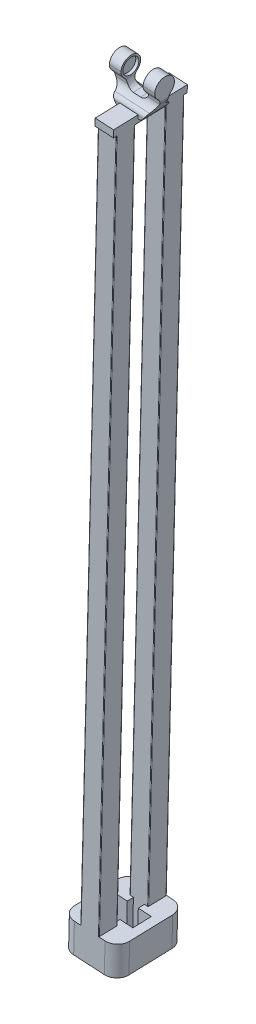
ISO-10303-21;
HEADER;
FILE_DESCRIPTION(('STEP AP214'),'2;1');
FILE_NAME('part.step','',(''),(''),'','','');
FILE_SCHEMA(('AUTOMOTIVE_DESIGN { 1 0 10303 214 1 1 1 1 }'));
ENDSEC;
DATA;
#1=APPLICATION_CONTEXT('core data for automotive mechanical design processes');
#2=APPLICATION_PROTOCOL_DEFINITION('international standard','automotive_design',2000,#1);
#3=PRODUCT_CONTEXT('',#1,'mechanical');
#4=PRODUCT('Part','Part','',(#3));
#5=PRODUCT_RELATED_PRODUCT_CATEGORY('part','',(#4));
#6=PRODUCT_DEFINITION_FORMATION('','',#4);
#7=PRODUCT_DEFINITION_CONTEXT('part definition',#1,'design');
#8=PRODUCT_DEFINITION('design','',#6,#7);
#9=PRODUCT_DEFINITION_SHAPE('','',#8);
#10=(LENGTH_UNIT() NAMED_UNIT(*) SI_UNIT(.MILLI.,.METRE.));
#11=(NAMED_UNIT(*) PLANE_ANGLE_UNIT() SI_UNIT($,.RADIAN.));
#12=(NAMED_UNIT(*) SI_UNIT($,.STERADIAN.) SOLID_ANGLE_UNIT());
#13=UNCERTAINTY_MEASURE_WITH_UNIT(LENGTH_MEASURE(1.E-05),#10,'distance_accuracy_value','');
#14=(GEOMETRIC_REPRESENTATION_CONTEXT(3) GLOBAL_UNCERTAINTY_ASSIGNED_CONTEXT((#13)) GLOBAL_UNIT_ASSIGNED_CONTEXT((#10,
#11,#12)) REPRESENTATION_CONTEXT('',''));
#15=CARTESIAN_POINT('',(0.,0.,0.));
#16=DIRECTION('',(0.,0.,1.));
#17=DIRECTION('',(1.,0.,0.));
#18=AXIS2_PLACEMENT_3D('',#15,#16,#17);
#19=CARTESIAN_POINT('',(36.0166695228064,-69.7293539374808,80.2740288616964));
#20=DIRECTION('',(0.00191678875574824,0.0332962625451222,-0.999443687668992));
#21=DIRECTION('',(0.0574452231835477,0.997791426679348,0.0333513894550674));
#22=AXIS2_PLACEMENT_3D('',#19,#20,#21);
#23=PLANE('',#22);
#24=DIRECTION('',(-0.998346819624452,0.0574771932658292,1.55845841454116E-07));
#25=VECTOR('',#24,1.);
#26=CARTESIAN_POINT('',(1.83676172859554,-663.415252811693,60.4299521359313));
#27=LINE('',#26,#25);
#28=CARTESIAN_POINT('',(21.8036981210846,-664.56479667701,60.4299490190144));
#29=VERTEX_POINT('',#28);
#30=CARTESIAN_POINT('',(16.31279061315,-664.248672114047,60.4299498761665));
#31=VERTEX_POINT('',#30);
#32=EDGE_CURVE('E1402',#29,#31,#27,.T.);
#33=ORIENTED_EDGE('',*,*,#32,.T.);
#34=DIRECTION('',(0.0574452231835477,0.997791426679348,0.0333513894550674));
#35=VECTOR('',#34,1.);
#36=CARTESIAN_POINT('',(50.492698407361,-70.5627732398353,80.2740266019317));
#37=LINE('',#36,#35);
#38=CARTESIAN_POINT('',(50.3778079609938,-72.558356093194,80.2073238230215));
#39=VERTEX_POINT('',#38);
#40=EDGE_CURVE('E41',#31,#39,#37,.T.);
#41=ORIENTED_EDGE('',*,*,#40,.T.);
#42=DIRECTION('',(0.998346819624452,-0.0574771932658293,-1.55845841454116E-07));
#43=VECTOR('',#42,1.);
#44=CARTESIAN_POINT('',(50.8769813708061,-72.587094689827,80.2073237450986));
#45=LINE('',#44,#43);
#46=CARTESIAN_POINT('',(36.4009524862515,-71.7536753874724,80.2073260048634));
#47=VERTEX_POINT('',#46);
#48=EDGE_CURVE('E878',#47,#39,#45,.T.);
#49=ORIENTED_EDGE('',*,*,#48,.F.);
#50=DIRECTION('',(-0.0574452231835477,-0.997791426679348,-0.0333513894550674));
#51=VECTOR('',#50,1.);
#52=CARTESIAN_POINT('',(36.5158429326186,-69.7580925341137,80.2740287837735));
#53=LINE('',#52,#51);
#54=CARTESIAN_POINT('',(2.33593513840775,-663.443991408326,60.4299520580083));
#55=VERTEX_POINT('',#54);
#56=EDGE_CURVE('E991',#47,#55,#53,.T.);
#57=ORIENTED_EDGE('',*,*,#56,.T.);
#58=CARTESIAN_POINT('',(-3.15497236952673,-663.127866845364,60.4299529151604));
#59=VERTEX_POINT('',#58);
#60=EDGE_CURVE('E1404',#55,#59,#27,.T.);
#61=ORIENTED_EDGE('',*,*,#60,.T.);
#62=DIRECTION('',(-0.0574452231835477,-0.997791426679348,-0.0333513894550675));
#63=VECTOR('',#62,1.);
#64=CARTESIAN_POINT('',(0.291741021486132,-603.260381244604,62.4310362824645));
#65=LINE('',#64,#63);
#66=CARTESIAN_POINT('',(-4.5911029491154,-688.072652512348,59.5961681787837));
#67=VERTEX_POINT('',#66);
#68=EDGE_CURVE('E1244',#59,#67,#65,.T.);
#69=ORIENTED_EDGE('',*,*,#68,.T.);
#70=DIRECTION('',(-0.998346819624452,0.0574771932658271,1.55845841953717E-07));
#71=VECTOR('',#70,1.);
#72=CARTESIAN_POINT('',(20.3675675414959,-689.509582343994,59.5961642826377));
#73=LINE('',#72,#71);
#74=CARTESIAN_POINT('',(20.3675675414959,-689.509582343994,59.5961642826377));
#75=VERTEX_POINT('',#74);
#76=EDGE_CURVE('E1494',#75,#67,#73,.T.);
#77=ORIENTED_EDGE('',*,*,#76,.F.);
#78=DIRECTION('',(0.0574452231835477,0.997791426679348,0.0333513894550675));
#79=VECTOR('',#78,1.);
#80=CARTESIAN_POINT('',(25.2504115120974,-604.697311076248,62.4310323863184));
#81=LINE('',#80,#79);
#82=EDGE_CURVE('E1014',#75,#29,#81,.T.);
#83=ORIENTED_EDGE('',*,*,#82,.T.);
#84=EDGE_LOOP('',(#33,#41,#49,#57,#61,#69,#77,#83));
#85=FACE_BOUND('',#84,.T.);
#86=ADVANCED_FACE('F16',(#85),#23,.F.);
#87=CARTESIAN_POINT('',(25.2695793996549,-604.364348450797,52.4365955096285));
#88=DIRECTION('',(-0.0574452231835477,-0.997791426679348,-0.0333513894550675));
#89=DIRECTION('',(-0.998346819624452,0.0574771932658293,1.55845841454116E-07));
#90=AXIS2_PLACEMENT_3D('',#87,#88,#89);
#91=CYLINDRICAL_SURFACE('',#90,10.);
#92=CARTESIAN_POINT('',(21.8228660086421,-664.231834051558,50.4355121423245));
#93=DIRECTION('',(-0.0574452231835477,-0.997791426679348,-0.0333513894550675));
#94=DIRECTION('',(0.443074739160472,-0.0554167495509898,0.894770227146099));
#95=AXIS2_PLACEMENT_3D('',#92,#93,#94);
#96=CIRCLE('',#95,10.);
#97=CARTESIAN_POINT('',(31.8063342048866,-664.806605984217,50.4355105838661));
#98=VERTEX_POINT('',#97);
#99=EDGE_CURVE('E1399',#29,#98,#96,.F.);
#100=ORIENTED_EDGE('',*,*,#99,.F.);
#101=ORIENTED_EDGE('',*,*,#82,.F.);
#102=CARTESIAN_POINT('',(20.3867354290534,-689.176619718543,49.6017274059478));
#103=DIRECTION('',(-0.0574452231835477,-0.997791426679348,-0.0333513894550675));
#104=DIRECTION('',(0.443074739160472,-0.0554167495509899,0.894770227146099));
#105=AXIS2_PLACEMENT_3D('',#102,#103,#104);
#106=CIRCLE('',#105,10.);
#107=CARTESIAN_POINT('',(30.3702036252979,-689.751391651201,49.6017258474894));
#108=VERTEX_POINT('',#107);
#109=EDGE_CURVE('E1491',#108,#75,#106,.T.);
#110=ORIENTED_EDGE('',*,*,#109,.F.);
#111=DIRECTION('',(-0.0574452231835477,-0.997791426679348,-0.0333513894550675));
#112=VECTOR('',#111,1.);
#113=CARTESIAN_POINT('',(35.2530475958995,-604.939120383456,52.4365939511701));
#114=LINE('',#113,#112);
#115=EDGE_CURVE('E1180',#98,#108,#114,.T.);
#116=ORIENTED_EDGE('',*,*,#115,.F.);
#117=EDGE_LOOP('',(#100,#101,#110,#116));
#118=FACE_BOUND('',#117,.T.);
#119=ADVANCED_FACE('F1697',(#118),#91,.T.);
#120=CARTESIAN_POINT('',(25.3366670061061,-603.198979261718,17.4560664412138));
#121=DIRECTION('',(-0.0574452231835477,-0.997791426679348,-0.0333513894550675));
#122=DIRECTION('',(-0.998346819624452,0.0574771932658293,1.55845841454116E-07));
#123=AXIS2_PLACEMENT_3D('',#120,#121,#122);
#124=CYLINDRICAL_SURFACE('',#123,10.);
#125=CARTESIAN_POINT('',(21.8899536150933,-663.06646486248,15.4549830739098));
#126=DIRECTION('',(-0.0574452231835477,-0.997791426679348,-0.0333513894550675));
#127=DIRECTION('',(0.443074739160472,-0.0554167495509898,0.894770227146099));
#128=AXIS2_PLACEMENT_3D('',#125,#126,#127);
#129=CIRCLE('',#128,10.);
#130=CARTESIAN_POINT('',(31.8734218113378,-663.641236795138,15.4549815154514));
#131=VERTEX_POINT('',#130);
#132=CARTESIAN_POINT('',(21.9091215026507,-662.733502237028,5.46054619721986));
#133=VERTEX_POINT('',#132);
#134=EDGE_CURVE('E1387',#131,#133,#129,.F.);
#135=ORIENTED_EDGE('',*,*,#134,.F.);
#136=DIRECTION('',(0.0574452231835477,0.997791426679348,0.0333513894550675));
#137=VECTOR('',#136,1.);
#138=CARTESIAN_POINT('',(35.3201352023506,-603.773751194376,17.4560648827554));
#139=LINE('',#138,#137);
#140=CARTESIAN_POINT('',(30.4372912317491,-688.586022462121,14.6211967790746));
#141=VERTEX_POINT('',#140);
#142=EDGE_CURVE('E1017',#141,#131,#139,.T.);
#143=ORIENTED_EDGE('',*,*,#142,.F.);
#144=CARTESIAN_POINT('',(20.4538230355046,-688.011250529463,14.6211983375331));
#145=DIRECTION('',(-0.0574452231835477,-0.997791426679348,-0.0333513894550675));
#146=DIRECTION('',(0.443074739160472,-0.0554167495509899,0.894770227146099));
#147=AXIS2_PLACEMENT_3D('',#144,#145,#146);
#148=CIRCLE('',#147,10.);
#149=CARTESIAN_POINT('',(20.472990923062,-687.678287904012,4.62676146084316));
#150=VERTEX_POINT('',#149);
#151=EDGE_CURVE('E1485',#150,#141,#148,.T.);
#152=ORIENTED_EDGE('',*,*,#151,.F.);
#153=DIRECTION('',(-0.0574452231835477,-0.997791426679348,-0.0333513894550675));
#154=VECTOR('',#153,1.);
#155=CARTESIAN_POINT('',(25.3558348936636,-602.866016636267,7.46162956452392));
#156=LINE('',#155,#154);
#157=EDGE_CURVE('E1236',#133,#150,#156,.T.);
#158=ORIENTED_EDGE('',*,*,#157,.F.);
#159=EDGE_LOOP('',(#135,#143,#152,#158));
#160=FACE_BOUND('',#159,.T.);
#161=ADVANCED_FACE('F719',(#160),#124,.T.);
#162=CARTESIAN_POINT('',(15.8658421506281,-628.516353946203,41.6083751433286));
#163=DIRECTION('',(-0.00191678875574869,-0.0332962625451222,0.999443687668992));
#164=DIRECTION('',(-0.998346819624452,0.0574771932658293,1.55845841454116E-07));
#165=AXIS2_PLACEMENT_3D('',#162,#163,#164);
#166=PLANE('',#165);
#167=DIRECTION('',(0.0574452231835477,0.997791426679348,0.0333513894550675));
#168=VECTOR('',#167,1.);
#169=CARTESIAN_POINT('',(15.8658421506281,-628.516353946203,41.6083751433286));
#170=LINE('',#169,#168);
#171=CARTESIAN_POINT('',(12.4191287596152,-688.383839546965,39.6072917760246));
#172=VERTEX_POINT('',#171);
#173=CARTESIAN_POINT('',(13.8552593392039,-663.43905387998,40.4410765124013));
#174=VERTEX_POINT('',#173);
#175=EDGE_CURVE('E910',#172,#174,#170,.T.);
#176=ORIENTED_EDGE('',*,*,#175,.T.);
#177=DIRECTION('',(0.998346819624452,-0.0574771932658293,-1.55845841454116E-07));
#178=VECTOR('',#177,1.);
#179=CARTESIAN_POINT('',(13.8552593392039,-663.43905387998,40.4410765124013));
#180=LINE('',#179,#178);
#181=CARTESIAN_POINT('',(24.4377356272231,-664.048312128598,40.4410748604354));
#182=VERTEX_POINT('',#181);
#183=EDGE_CURVE('E1437',#174,#182,#180,.T.);
#184=ORIENTED_EDGE('',*,*,#183,.T.);
#185=DIRECTION('',(0.0574452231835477,0.997791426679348,0.0333513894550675));
#186=VECTOR('',#185,1.);
#187=CARTESIAN_POINT('',(26.4483184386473,-629.125612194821,41.6083734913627));
#188=LINE('',#187,#186);
#189=CARTESIAN_POINT('',(23.0016050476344,-688.993097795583,39.6072901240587));
#190=VERTEX_POINT('',#189);
#191=EDGE_CURVE('E10',#190,#182,#188,.T.);
#192=ORIENTED_EDGE('',*,*,#191,.F.);
#193=DIRECTION('',(-0.998346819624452,0.0574771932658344,1.55845840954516E-07));
#194=VECTOR('',#193,1.);
#195=CARTESIAN_POINT('',(23.0016050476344,-688.993097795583,39.6072901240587));
#196=LINE('',#195,#194);
#197=EDGE_CURVE('E1464',#190,#172,#196,.T.);
#198=ORIENTED_EDGE('',*,*,#197,.T.);
#199=EDGE_LOOP('',(#176,#184,#192,#198));
#200=FACE_BOUND('',#199,.T.);
#201=ADVANCED_FACE('F1765',(#200),#166,.F.);
#202=CARTESIAN_POINT('',(26.4483184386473,-629.125612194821,41.6083734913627));
#203=DIRECTION('',(0.998346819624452,-0.0574771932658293,-1.55845841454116E-07));
#204=DIRECTION('',(0.00191678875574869,0.0332962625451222,-0.999443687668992));
#205=AXIS2_PLACEMENT_3D('',#202,#203,#204);
#206=PLANE('',#205);
#207=ORIENTED_EDGE('',*,*,#191,.T.);
#208=DIRECTION('',(0.00191678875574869,0.0332962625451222,-0.999443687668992));
#209=VECTOR('',#208,1.);
#210=CARTESIAN_POINT('',(24.4377356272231,-664.048312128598,40.4410748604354));
#211=LINE('',#210,#209);
#212=CARTESIAN_POINT('',(24.4664874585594,-663.548868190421,25.4494195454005));
#213=VERTEX_POINT('',#212);
#214=EDGE_CURVE('E1434',#182,#213,#211,.T.);
#215=ORIENTED_EDGE('',*,*,#214,.T.);
#216=DIRECTION('',(0.0574452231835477,0.997791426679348,0.0333513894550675));
#217=VECTOR('',#216,1.);
#218=CARTESIAN_POINT('',(26.4770702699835,-628.626168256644,26.6167181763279));
#219=LINE('',#218,#217);
#220=CARTESIAN_POINT('',(23.0303568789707,-688.493653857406,24.6156348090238));
#221=VERTEX_POINT('',#220);
#222=EDGE_CURVE('E27',#221,#213,#219,.T.);
#223=ORIENTED_EDGE('',*,*,#222,.F.);
#224=DIRECTION('',(-0.00191678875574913,-0.0332962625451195,0.999443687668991));
#225=VECTOR('',#224,1.);
#226=CARTESIAN_POINT('',(23.0303568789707,-688.493653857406,24.6156348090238));
#227=LINE('',#226,#225);
#228=EDGE_CURVE('E1461',#221,#190,#227,.T.);
#229=ORIENTED_EDGE('',*,*,#228,.T.);
#230=EDGE_LOOP('',(#207,#215,#223,#229));
#231=FACE_BOUND('',#230,.T.);
#232=ADVANCED_FACE('F1894',(#231),#206,.F.);
#233=CARTESIAN_POINT('',(26.4770702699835,-628.626168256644,26.6167181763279));
#234=DIRECTION('',(0.00191678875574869,0.0332962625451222,-0.999443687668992));
#235=DIRECTION('',(-0.998346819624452,0.0574771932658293,1.55845841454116E-07));
#236=AXIS2_PLACEMENT_3D('',#233,#234,#235);
#237=PLANE('',#236);
#238=ORIENTED_EDGE('',*,*,#222,.T.);
#239=DIRECTION('',(-0.998346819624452,0.0574771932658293,1.55845841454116E-07));
#240=VECTOR('',#239,1.);
#241=CARTESIAN_POINT('',(24.4664874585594,-663.548868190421,25.4494195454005));
#242=LINE('',#241,#240);
#243=CARTESIAN_POINT('',(13.8840111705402,-662.939609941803,25.4494211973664));
#244=VERTEX_POINT('',#243);
#245=EDGE_CURVE('E1431',#213,#244,#242,.T.);
#246=ORIENTED_EDGE('',*,*,#245,.T.);
#247=DIRECTION('',(0.0574452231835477,0.997791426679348,0.0333513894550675));
#248=VECTOR('',#247,1.);
#249=CARTESIAN_POINT('',(15.8945939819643,-628.016910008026,26.6167198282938));
#250=LINE('',#249,#248);
#251=CARTESIAN_POINT('',(12.4478805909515,-687.884395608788,24.6156364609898));
#252=VERTEX_POINT('',#251);
#253=EDGE_CURVE('E1018',#252,#244,#250,.T.);
#254=ORIENTED_EDGE('',*,*,#253,.F.);
#255=DIRECTION('',(0.998346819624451,-0.0574771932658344,-1.55845841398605E-07));
#256=VECTOR('',#255,1.);
#257=CARTESIAN_POINT('',(12.4478805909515,-687.884395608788,24.6156364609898));
#258=LINE('',#257,#256);
#259=EDGE_CURVE('E1458',#252,#221,#258,.T.);
#260=ORIENTED_EDGE('',*,*,#259,.T.);
#261=EDGE_LOOP('',(#238,#246,#254,#260));
#262=FACE_BOUND('',#261,.T.);
#263=ADVANCED_FACE('F436',(#262),#237,.F.);
#264=CARTESIAN_POINT('',(17.2923887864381,-603.738049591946,47.4393783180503));
#265=DIRECTION('',(0.998346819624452,-0.0574771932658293,-1.55845841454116E-07));
#266=DIRECTION('',(-0.0574452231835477,-0.997791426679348,-0.0333513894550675));
#267=AXIS2_PLACEMENT_3D('',#264,#265,#266);
#268=PLANE('',#267);
#269=DIRECTION('',(-0.0574452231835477,-0.997791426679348,-0.0333513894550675));
#270=VECTOR('',#269,1.);
#271=CARTESIAN_POINT('',(17.2923887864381,-603.738049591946,47.4393783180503));
#272=LINE('',#271,#270);
#273=CARTESIAN_POINT('',(13.8456753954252,-663.605535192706,45.4382949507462));
#274=VERTEX_POINT('',#273);
#275=CARTESIAN_POINT('',(12.4095448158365,-688.55032085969,44.6045102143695));
#276=VERTEX_POINT('',#275);
#277=EDGE_CURVE('E961',#274,#276,#272,.T.);
#278=ORIENTED_EDGE('',*,*,#277,.F.);
#279=DIRECTION('',(0.00191678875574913,0.0332962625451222,-0.999443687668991));
#280=VECTOR('',#279,1.);
#281=CARTESIAN_POINT('',(13.8456753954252,-663.605535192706,45.4382949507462));
#282=LINE('',#281,#280);
#283=EDGE_CURVE('E1440',#274,#174,#282,.T.);
#284=ORIENTED_EDGE('',*,*,#283,.T.);
#285=ORIENTED_EDGE('',*,*,#175,.F.);
#286=DIRECTION('',(-0.00191678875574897,-0.0332962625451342,0.999443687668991));
#287=VECTOR('',#286,1.);
#288=CARTESIAN_POINT('',(12.4191287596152,-688.383839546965,39.6072917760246));
#289=LINE('',#288,#287);
#290=EDGE_CURVE('E1467',#172,#276,#289,.T.);
#291=ORIENTED_EDGE('',*,*,#290,.T.);
#292=EDGE_LOOP('',(#278,#284,#285,#291));
#293=FACE_BOUND('',#292,.T.);
#294=ADVANCED_FACE('F1764',(#293),#268,.F.);
#295=CARTESIAN_POINT('',(35.233879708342,-605.272083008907,62.4310308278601));
#296=DIRECTION('',(-0.998346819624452,0.0574771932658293,1.55845841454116E-07));
#297=DIRECTION('',(-0.00191678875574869,-0.0332962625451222,0.999443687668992));
#298=AXIS2_PLACEMENT_3D('',#295,#296,#297);
#299=PLANE('',#298);
#300=ORIENTED_EDGE('',*,*,#142,.T.);
#301=DIRECTION('',(-0.00191678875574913,-0.0332962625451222,0.999443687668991));
#302=VECTOR('',#301,1.);
#303=CARTESIAN_POINT('',(31.7871663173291,-665.139568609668,60.429947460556));
#304=LINE('',#303,#302);
#305=EDGE_CURVE('E1396',#131,#98,#304,.T.);
#306=ORIENTED_EDGE('',*,*,#305,.T.);
#307=ORIENTED_EDGE('',*,*,#115,.T.);
#308=DIRECTION('',(-0.00191678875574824,-0.0332962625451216,0.999443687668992));
#309=VECTOR('',#308,1.);
#310=CARTESIAN_POINT('',(30.4372912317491,-688.586022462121,14.6211967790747));
#311=LINE('',#310,#309);
#312=EDGE_CURVE('E1488',#141,#108,#311,.T.);
#313=ORIENTED_EDGE('',*,*,#312,.F.);
#314=EDGE_LOOP('',(#300,#306,#307,#313));
#315=FACE_BOUND('',#314,.T.);
#316=ADVANCED_FACE('F1829',(#315),#299,.F.);
#317=CARTESIAN_POINT('',(17.2923887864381,-603.738049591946,47.4393783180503));
#318=DIRECTION('',(0.998346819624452,-0.0574771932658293,-1.55845841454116E-07));
#319=DIRECTION('',(-0.0574452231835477,-0.997791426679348,-0.0333513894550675));
#320=AXIS2_PLACEMENT_3D('',#317,#318,#319);
#321=PLANE('',#320);
#322=ORIENTED_EDGE('',*,*,#253,.T.);
#323=DIRECTION('',(0.00191678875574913,0.0332962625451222,-0.999443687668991));
#324=VECTOR('',#323,1.);
#325=CARTESIAN_POINT('',(13.8456753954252,-663.605535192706,45.4382949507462));
#326=LINE('',#325,#324);
#327=CARTESIAN_POINT('',(13.8935951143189,-662.773128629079,20.4522027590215));
#328=VERTEX_POINT('',#327);
#329=EDGE_CURVE('E1428',#244,#328,#326,.T.);
#330=ORIENTED_EDGE('',*,*,#329,.T.);
#331=DIRECTION('',(-0.0574452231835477,-0.997791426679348,-0.0333513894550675));
#332=VECTOR('',#331,1.);
#333=CARTESIAN_POINT('',(17.3403085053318,-602.905643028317,22.4532861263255));
#334=LINE('',#333,#332);
#335=CARTESIAN_POINT('',(12.4574645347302,-687.717914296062,19.6184180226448));
#336=VERTEX_POINT('',#335);
#337=EDGE_CURVE('E817',#328,#336,#334,.T.);
#338=ORIENTED_EDGE('',*,*,#337,.T.);
#339=DIRECTION('',(-0.00191678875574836,-0.0332962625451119,0.999443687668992));
#340=VECTOR('',#339,1.);
#341=CARTESIAN_POINT('',(12.4574645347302,-687.717914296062,19.6184180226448));
#342=LINE('',#341,#340);
#343=EDGE_CURVE('E1455',#336,#252,#342,.T.);
#344=ORIENTED_EDGE('',*,*,#343,.T.);
#345=EDGE_LOOP('',(#322,#330,#338,#344));
#346=FACE_BOUND('',#345,.T.);
#347=ADVANCED_FACE('F1891',(#346),#321,.F.);
#348=CARTESIAN_POINT('',(0.377996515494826,-601.762049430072,17.4560703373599));
#349=DIRECTION('',(-0.0574452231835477,-0.997791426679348,-0.0333513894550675));
#350=DIRECTION('',(0.998346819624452,-0.0574771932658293,-1.55845841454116E-07));
#351=AXIS2_PLACEMENT_3D('',#348,#349,#350);
#352=CYLINDRICAL_SURFACE('',#351,10.);
#353=CARTESIAN_POINT('',(-3.06871687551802,-661.629535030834,15.4549869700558));
#354=DIRECTION('',(-0.0574452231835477,-0.997791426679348,-0.0333513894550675));
#355=DIRECTION('',(0.443074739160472,-0.0554167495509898,0.894770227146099));
#356=AXIS2_PLACEMENT_3D('',#353,#354,#355);
#357=CIRCLE('',#356,10.);
#358=CARTESIAN_POINT('',(-3.04954898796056,-661.296572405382,5.46055009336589));
#359=VERTEX_POINT('',#358);
#360=CARTESIAN_POINT('',(-13.0521850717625,-661.054763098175,15.4549885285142));
#361=VERTEX_POINT('',#360);
#362=EDGE_CURVE('E1405',#359,#361,#357,.F.);
#363=ORIENTED_EDGE('',*,*,#362,.F.);
#364=DIRECTION('',(0.0574452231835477,0.997791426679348,0.0333513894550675));
#365=VECTOR('',#364,1.);
#366=CARTESIAN_POINT('',(0.397164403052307,-601.429086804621,7.46163346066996));
#367=LINE('',#366,#365);
#368=CARTESIAN_POINT('',(-4.48567956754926,-686.241358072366,4.62676535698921));
#369=VERTEX_POINT('',#368);
#370=EDGE_CURVE('E1062',#369,#359,#367,.T.);
#371=ORIENTED_EDGE('',*,*,#370,.F.);
#372=CARTESIAN_POINT('',(-4.50484745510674,-686.574320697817,14.6212022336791));
#373=DIRECTION('',(-0.0574452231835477,-0.997791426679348,-0.0333513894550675));
#374=DIRECTION('',(0.443074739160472,-0.0554167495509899,0.894770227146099));
#375=AXIS2_PLACEMENT_3D('',#372,#373,#374);
#376=CIRCLE('',#375,10.);
#377=CARTESIAN_POINT('',(-14.4883156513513,-685.999548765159,14.6212037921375));
#378=VERTEX_POINT('',#377);
#379=EDGE_CURVE('E1479',#378,#369,#376,.T.);
#380=ORIENTED_EDGE('',*,*,#379,.F.);
#381=DIRECTION('',(-0.0574452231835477,-0.997791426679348,-0.0333513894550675));
#382=VECTOR('',#381,1.);
#383=CARTESIAN_POINT('',(-9.60547168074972,-601.187277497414,17.4560718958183));
#384=LINE('',#383,#382);
#385=EDGE_CURVE('E1144',#361,#378,#384,.T.);
#386=ORIENTED_EDGE('',*,*,#385,.F.);
#387=EDGE_LOOP('',(#363,#371,#380,#386));
#388=FACE_BOUND('',#387,.T.);
#389=ADVANCED_FACE('F1808',(#388),#352,.T.);
#390=CARTESIAN_POINT('',(0.310908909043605,-602.927418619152,52.4365994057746));
#391=DIRECTION('',(-0.0574452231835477,-0.997791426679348,-0.0333513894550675));
#392=DIRECTION('',(0.998346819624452,-0.0574771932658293,-1.55845841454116E-07));
#393=AXIS2_PLACEMENT_3D('',#390,#391,#392);
#394=CYLINDRICAL_SURFACE('',#393,10.);
#395=CARTESIAN_POINT('',(-3.13580448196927,-662.794904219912,50.4355160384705));
#396=DIRECTION('',(-0.0574452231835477,-0.997791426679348,-0.0333513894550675));
#397=DIRECTION('',(0.443074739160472,-0.0554167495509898,0.894770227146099));
#398=AXIS2_PLACEMENT_3D('',#395,#396,#397);
#399=CIRCLE('',#398,10.);
#400=CARTESIAN_POINT('',(-13.1192726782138,-662.220132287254,50.4355175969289));
#401=VERTEX_POINT('',#400);
#402=EDGE_CURVE('E1410',#401,#59,#399,.F.);
#403=ORIENTED_EDGE('',*,*,#402,.F.);
#404=DIRECTION('',(0.0574452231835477,0.997791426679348,0.0333513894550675));
#405=VECTOR('',#404,1.);
#406=CARTESIAN_POINT('',(-9.6725592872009,-602.352646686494,52.436600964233));
#407=LINE('',#406,#405);
#408=CARTESIAN_POINT('',(-14.5554032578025,-687.164917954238,49.6017328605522));
#409=VERTEX_POINT('',#408);
#410=EDGE_CURVE('E1140',#409,#401,#407,.T.);
#411=ORIENTED_EDGE('',*,*,#410,.F.);
#412=CARTESIAN_POINT('',(-4.57193506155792,-687.739689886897,49.6017313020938));
#413=DIRECTION('',(-0.0574452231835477,-0.997791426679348,-0.0333513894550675));
#414=DIRECTION('',(0.443074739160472,-0.0554167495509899,0.894770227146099));
#415=AXIS2_PLACEMENT_3D('',#412,#413,#414);
#416=CIRCLE('',#415,10.);
#417=EDGE_CURVE('E1496',#67,#409,#416,.T.);
#418=ORIENTED_EDGE('',*,*,#417,.F.);
#419=ORIENTED_EDGE('',*,*,#68,.F.);
#420=EDGE_LOOP('',(#403,#411,#418,#419));
#421=FACE_BOUND('',#420,.T.);
#422=ADVANCED_FACE('F1817',(#421),#394,.T.);
#423=CARTESIAN_POINT('',(6.90947260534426,-627.499615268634,26.6167212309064));
#424=DIRECTION('',(0.00191678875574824,0.0332962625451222,-0.999443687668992));
#425=DIRECTION('',(0.0574452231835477,0.997791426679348,0.0333513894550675));
#426=AXIS2_PLACEMENT_3D('',#423,#424,#425);
#427=PLANE('',#426);
#428=DIRECTION('',(0.0574452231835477,0.997791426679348,0.0333513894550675));
#429=VECTOR('',#428,1.);
#430=CARTESIAN_POINT('',(6.90947260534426,-627.499615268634,26.6167212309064));
#431=LINE('',#430,#429);
#432=CARTESIAN_POINT('',(3.46275921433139,-687.367100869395,24.6156378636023));
#433=VERTEX_POINT('',#432);
#434=CARTESIAN_POINT('',(4.8988897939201,-662.422315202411,25.449422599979));
#435=VERTEX_POINT('',#434);
#436=EDGE_CURVE('E832',#433,#435,#431,.T.);
#437=ORIENTED_EDGE('',*,*,#436,.T.);
#438=DIRECTION('',(-0.998346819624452,0.0574771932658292,1.55845841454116E-07));
#439=VECTOR('',#438,1.);
#440=CARTESIAN_POINT('',(4.8988897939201,-662.422315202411,25.449422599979));
#441=LINE('',#440,#439);
#442=CARTESIAN_POINT('',(-5.68358649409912,-661.813056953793,25.4494242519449));
#443=VERTEX_POINT('',#442);
#444=EDGE_CURVE('E1422',#435,#443,#441,.T.);
#445=ORIENTED_EDGE('',*,*,#444,.T.);
#446=DIRECTION('',(0.0574452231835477,0.997791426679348,0.0333513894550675));
#447=VECTOR('',#446,1.);
#448=CARTESIAN_POINT('',(-3.67300368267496,-626.890357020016,26.6167228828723));
#449=LINE('',#448,#447);
#450=CARTESIAN_POINT('',(-7.11971707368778,-686.757842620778,24.6156395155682));
#451=VERTEX_POINT('',#450);
#452=EDGE_CURVE('E831',#451,#443,#449,.T.);
#453=ORIENTED_EDGE('',*,*,#452,.F.);
#454=DIRECTION('',(0.998346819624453,-0.0574771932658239,-1.5584584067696E-07));
#455=VECTOR('',#454,1.);
#456=CARTESIAN_POINT('',(-7.11971707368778,-686.757842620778,24.6156395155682));
#457=LINE('',#456,#455);
#458=EDGE_CURVE('E1446',#451,#433,#457,.T.);
#459=ORIENTED_EDGE('',*,*,#458,.T.);
#460=EDGE_LOOP('',(#437,#445,#453,#459));
#461=FACE_BOUND('',#460,.T.);
#462=ADVANCED_FACE('F1712',(#461),#427,.F.);
#463=CARTESIAN_POINT('',(-3.67300368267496,-626.890357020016,26.6167228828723));
#464=DIRECTION('',(-0.998346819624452,0.0574771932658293,1.55845841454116E-07));
#465=DIRECTION('',(-0.00191678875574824,-0.0332962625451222,0.999443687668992));
#466=AXIS2_PLACEMENT_3D('',#463,#464,#465);
#467=PLANE('',#466);
#468=ORIENTED_EDGE('',*,*,#452,.T.);
#469=DIRECTION('',(-0.00191678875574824,-0.0332962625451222,0.999443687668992));
#470=VECTOR('',#469,1.);
#471=CARTESIAN_POINT('',(-5.68358649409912,-661.813056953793,25.4494242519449));
#472=LINE('',#471,#470);
#473=CARTESIAN_POINT('',(-5.71233832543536,-662.31250089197,40.4410795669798));
#474=VERTEX_POINT('',#473);
#475=EDGE_CURVE('E1419',#443,#474,#472,.T.);
#476=ORIENTED_EDGE('',*,*,#475,.T.);
#477=DIRECTION('',(0.0574452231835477,0.997791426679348,0.0333513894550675));
#478=VECTOR('',#477,1.);
#479=CARTESIAN_POINT('',(-3.70175551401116,-627.389800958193,41.6083781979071));
#480=LINE('',#479,#478);
#481=CARTESIAN_POINT('',(-7.14846890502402,-687.257286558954,39.6072948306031));
#482=VERTEX_POINT('',#481);
#483=EDGE_CURVE('E827',#482,#474,#480,.T.);
#484=ORIENTED_EDGE('',*,*,#483,.F.);
#485=DIRECTION('',(0.00191678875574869,0.0332962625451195,-0.999443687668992));
#486=VECTOR('',#485,1.);
#487=CARTESIAN_POINT('',(-7.14846890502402,-687.257286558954,39.6072948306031));
#488=LINE('',#487,#486);
#489=EDGE_CURVE('E1443',#482,#451,#488,.T.);
#490=ORIENTED_EDGE('',*,*,#489,.T.);
#491=EDGE_LOOP('',(#468,#476,#484,#490));
#492=FACE_BOUND('',#491,.T.);
#493=ADVANCED_FACE('F1708',(#492),#467,.F.);
#494=CARTESIAN_POINT('',(-3.70175551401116,-627.389800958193,41.6083781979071));
#495=DIRECTION('',(-0.00191678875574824,-0.0332962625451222,0.999443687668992));
#496=DIRECTION('',(0.998346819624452,-0.0574771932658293,-1.55845841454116E-07));
#497=AXIS2_PLACEMENT_3D('',#494,#495,#496);
#498=PLANE('',#497);
#499=ORIENTED_EDGE('',*,*,#483,.T.);
#500=DIRECTION('',(0.998346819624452,-0.0574771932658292,-1.55845841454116E-07));
#501=VECTOR('',#500,1.);
#502=CARTESIAN_POINT('',(-5.71233832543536,-662.31250089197,40.4410795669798));
#503=LINE('',#502,#501);
#504=CARTESIAN_POINT('',(4.87013796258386,-662.921759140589,40.4410779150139));
#505=VERTEX_POINT('',#504);
#506=EDGE_CURVE('E1416',#474,#505,#503,.T.);
#507=ORIENTED_EDGE('',*,*,#506,.T.);
#508=DIRECTION('',(0.0574452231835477,0.997791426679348,0.0333513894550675));
#509=VECTOR('',#508,1.);
#510=CARTESIAN_POINT('',(6.88072077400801,-627.99905920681,41.6083765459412));
#511=LINE('',#510,#509);
#512=CARTESIAN_POINT('',(3.43400738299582,-687.866544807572,39.6072931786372));
#513=VERTEX_POINT('',#512);
#514=EDGE_CURVE('E990',#513,#505,#511,.T.);
#515=ORIENTED_EDGE('',*,*,#514,.F.);
#516=DIRECTION('',(-0.998346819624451,0.0574771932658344,1.55845841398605E-07));
#517=VECTOR('',#516,1.);
#518=CARTESIAN_POINT('',(3.43400738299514,-687.866544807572,39.6072931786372));
#519=LINE('',#518,#517);
#520=EDGE_CURVE('E1476',#513,#482,#519,.T.);
#521=ORIENTED_EDGE('',*,*,#520,.T.);
#522=EDGE_LOOP('',(#499,#507,#515,#521));
#523=FACE_BOUND('',#522,.T.);
#524=ADVANCED_FACE('F1711',(#523),#498,.F.);
#525=CARTESIAN_POINT('',(8.3551871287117,-602.388348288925,22.4532875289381));
#526=DIRECTION('',(-0.998346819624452,0.0574771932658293,1.55845841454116E-07));
#527=DIRECTION('',(-0.00191678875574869,-0.0332962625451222,0.999443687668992));
#528=AXIS2_PLACEMENT_3D('',#525,#526,#527);
#529=PLANE('',#528);
#530=DIRECTION('',(-0.0574452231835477,-0.997791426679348,-0.0333513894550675));
#531=VECTOR('',#530,1.);
#532=CARTESIAN_POINT('',(8.3551871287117,-602.388348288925,22.4532875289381));
#533=LINE('',#532,#531);
#534=CARTESIAN_POINT('',(4.90847373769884,-662.255833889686,20.452204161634));
#535=VERTEX_POINT('',#534);
#536=CARTESIAN_POINT('',(3.47234315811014,-687.20061955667,19.6184194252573));
#537=VERTEX_POINT('',#536);
#538=EDGE_CURVE('E1004',#535,#537,#533,.T.);
#539=ORIENTED_EDGE('',*,*,#538,.F.);
#540=DIRECTION('',(-0.00191678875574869,-0.0332962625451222,0.999443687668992));
#541=VECTOR('',#540,1.);
#542=CARTESIAN_POINT('',(4.90847373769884,-662.255833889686,20.452204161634));
#543=LINE('',#542,#541);
#544=EDGE_CURVE('E1425',#535,#435,#543,.T.);
#545=ORIENTED_EDGE('',*,*,#544,.T.);
#546=ORIENTED_EDGE('',*,*,#436,.F.);
#547=DIRECTION('',(0.0019167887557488,0.0332962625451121,-0.999443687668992));
#548=VECTOR('',#547,1.);
#549=CARTESIAN_POINT('',(3.46275921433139,-687.367100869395,24.6156378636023));
#550=LINE('',#549,#548);
#551=EDGE_CURVE('E1449',#433,#537,#550,.T.);
#552=ORIENTED_EDGE('',*,*,#551,.T.);
#553=EDGE_LOOP('',(#539,#545,#546,#552));
#554=FACE_BOUND('',#553,.T.);
#555=ADVANCED_FACE('F1592',(#554),#529,.F.);
#556=CARTESIAN_POINT('',(-9.5863037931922,-600.854314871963,7.46163501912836));
#557=DIRECTION('',(0.998346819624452,-0.0574771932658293,-1.55845841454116E-07));
#558=DIRECTION('',(-0.0574452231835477,-0.997791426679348,-0.0333513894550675));
#559=AXIS2_PLACEMENT_3D('',#556,#557,#558);
#560=PLANE('',#559);
#561=ORIENTED_EDGE('',*,*,#410,.T.);
#562=DIRECTION('',(0.00191678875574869,0.0332962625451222,-0.999443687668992));
#563=VECTOR('',#562,1.);
#564=CARTESIAN_POINT('',(-13.0330171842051,-660.721800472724,5.46055165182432));
#565=LINE('',#564,#563);
#566=EDGE_CURVE('E1408',#401,#361,#565,.T.);
#567=ORIENTED_EDGE('',*,*,#566,.T.);
#568=ORIENTED_EDGE('',*,*,#385,.T.);
#569=DIRECTION('',(0.00191678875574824,0.0332962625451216,-0.999443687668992));
#570=VECTOR('',#569,1.);
#571=CARTESIAN_POINT('',(-14.5554032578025,-687.164917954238,49.6017328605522));
#572=LINE('',#571,#570);
#573=EDGE_CURVE('E1499',#409,#378,#572,.T.);
#574=ORIENTED_EDGE('',*,*,#573,.F.);
#575=EDGE_LOOP('',(#561,#567,#568,#574));
#576=FACE_BOUND('',#575,.T.);
#577=ADVANCED_FACE('F1730',(#576),#560,.F.);
#578=CARTESIAN_POINT('',(8.3551871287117,-602.388348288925,22.4532875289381));
#579=DIRECTION('',(-0.998346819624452,0.0574771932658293,1.55845841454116E-07));
#580=DIRECTION('',(-0.00191678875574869,-0.0332962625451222,0.999443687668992));
#581=AXIS2_PLACEMENT_3D('',#578,#579,#580);
#582=PLANE('',#581);
#583=ORIENTED_EDGE('',*,*,#514,.T.);
#584=DIRECTION('',(-0.00191678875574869,-0.0332962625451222,0.999443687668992));
#585=VECTOR('',#584,1.);
#586=CARTESIAN_POINT('',(4.90847373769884,-662.255833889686,20.452204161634));
#587=LINE('',#586,#585);
#588=CARTESIAN_POINT('',(4.86055401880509,-663.088240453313,45.4382963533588));
#589=VERTEX_POINT('',#588);
#590=EDGE_CURVE('E1413',#505,#589,#587,.T.);
#591=ORIENTED_EDGE('',*,*,#590,.T.);
#592=DIRECTION('',(-0.0574452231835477,-0.997791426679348,-0.0333513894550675));
#593=VECTOR('',#592,1.);
#594=CARTESIAN_POINT('',(8.30726740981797,-603.220754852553,47.4393797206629));
#595=LINE('',#594,#593);
#596=CARTESIAN_POINT('',(3.42442343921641,-688.033026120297,44.6045116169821));
#597=VERTEX_POINT('',#596);
#598=EDGE_CURVE('E1167',#589,#597,#595,.T.);
#599=ORIENTED_EDGE('',*,*,#598,.T.);
#600=DIRECTION('',(0.0019167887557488,0.033296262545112,-0.999443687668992));
#601=VECTOR('',#600,1.);
#602=CARTESIAN_POINT('',(3.42442343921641,-688.033026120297,44.6045116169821));
#603=LINE('',#602,#601);
#604=EDGE_CURVE('E1473',#597,#513,#603,.T.);
#605=ORIENTED_EDGE('',*,*,#604,.T.);
#606=EDGE_LOOP('',(#583,#591,#599,#605));
#607=FACE_BOUND('',#606,.T.);
#608=ADVANCED_FACE('F633',(#607),#582,.F.);
#609=CARTESIAN_POINT('',(50.4936568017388,-70.5461251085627,79.7743047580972));
#610=DIRECTION('',(-0.0574452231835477,-0.997791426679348,-0.0333513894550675));
#611=DIRECTION('',(0.00191678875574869,0.0332962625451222,-0.999443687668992));
#612=AXIS2_PLACEMENT_3D('',#609,#610,#611);
#613=CYLINDRICAL_SURFACE('',#612,0.5);
#614=CARTESIAN_POINT('',(16.313749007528,-664.232023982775,59.9302280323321));
#615=DIRECTION('',(-0.0574452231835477,-0.997791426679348,-0.0333513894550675));
#616=DIRECTION('',(-0.443074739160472,0.0554167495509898,-0.894770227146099));
#617=AXIS2_PLACEMENT_3D('',#614,#615,#616);
#618=CIRCLE('',#617,0.5);
#619=CARTESIAN_POINT('',(16.8129224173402,-664.260762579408,59.9302279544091));
#620=VERTEX_POINT('',#619);
#621=EDGE_CURVE('E1549',#620,#31,#618,.T.);
#622=ORIENTED_EDGE('',*,*,#621,.F.);
#623=DIRECTION('',(-0.0574452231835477,-0.997791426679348,-0.0333513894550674));
#624=VECTOR('',#623,1.);
#625=CARTESIAN_POINT('',(50.9928302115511,-70.5748637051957,79.7743046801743));
#626=LINE('',#625,#624);
#627=CARTESIAN_POINT('',(50.877939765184,-72.5704465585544,79.7076019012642));
#628=VERTEX_POINT('',#627);
#629=EDGE_CURVE('E838',#628,#620,#626,.T.);
#630=ORIENTED_EDGE('',*,*,#629,.F.);
#631=CARTESIAN_POINT('',(50.3787663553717,-72.5417079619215,79.7076019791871));
#632=DIRECTION('',(-0.0574452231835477,-0.997791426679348,-0.0333513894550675));
#633=DIRECTION('',(0.998346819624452,-0.0574771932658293,-1.55845841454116E-07));
#634=AXIS2_PLACEMENT_3D('',#631,#632,#633);
#635=CIRCLE('',#634,0.5);
#636=EDGE_CURVE('E882',#628,#39,#635,.T.);
#637=ORIENTED_EDGE('',*,*,#636,.T.);
#638=ORIENTED_EDGE('',*,*,#40,.F.);
#639=EDGE_LOOP('',(#622,#630,#637,#638));
#640=FACE_BOUND('',#639,.T.);
#641=ADVANCED_FACE('F1550',(#640),#613,.T.);
#642=CARTESIAN_POINT('',(36.5168013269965,-69.7414444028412,79.7743069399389));
#643=DIRECTION('',(-0.0574452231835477,-0.997791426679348,-0.0333513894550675));
#644=DIRECTION('',(0.00191678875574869,0.0332962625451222,-0.999443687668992));
#645=AXIS2_PLACEMENT_3D('',#642,#643,#644);
#646=CYLINDRICAL_SURFACE('',#645,0.5);
#647=CARTESIAN_POINT('',(2.33689353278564,-663.427343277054,59.9302302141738));
#648=DIRECTION('',(-0.0574452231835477,-0.997791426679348,-0.0333513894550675));
#649=DIRECTION('',(0.443074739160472,-0.0554167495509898,0.894770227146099));
#650=AXIS2_PLACEMENT_3D('',#647,#648,#649);
#651=CIRCLE('',#650,0.5);
#652=CARTESIAN_POINT('',(1.83772012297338,-663.39860468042,59.9302302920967));
#653=VERTEX_POINT('',#652);
#654=EDGE_CURVE('E1787',#55,#653,#651,.T.);
#655=ORIENTED_EDGE('',*,*,#654,.F.);
#656=ORIENTED_EDGE('',*,*,#56,.F.);
#657=CARTESIAN_POINT('',(36.4019108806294,-71.7370272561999,79.7076041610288));
#658=DIRECTION('',(-0.0574452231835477,-0.997791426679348,-0.0333513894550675));
#659=DIRECTION('',(0.998346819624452,-0.0574771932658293,-1.55845841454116E-07));
#660=AXIS2_PLACEMENT_3D('',#657,#658,#659);
#661=CIRCLE('',#660,0.5);
#662=CARTESIAN_POINT('',(35.9027374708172,-71.7082886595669,79.7076042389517));
#663=VERTEX_POINT('',#662);
#664=EDGE_CURVE('E883',#47,#663,#661,.T.);
#665=ORIENTED_EDGE('',*,*,#664,.T.);
#666=DIRECTION('',(0.0574452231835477,0.997791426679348,0.0333513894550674));
#667=VECTOR('',#666,1.);
#668=CARTESIAN_POINT('',(36.0176279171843,-69.7127058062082,79.7743070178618));
#669=LINE('',#668,#667);
#670=EDGE_CURVE('E1082',#653,#663,#669,.T.);
#671=ORIENTED_EDGE('',*,*,#670,.F.);
#672=EDGE_LOOP('',(#655,#656,#665,#671));
#673=FACE_BOUND('',#672,.T.);
#674=ADVANCED_FACE('F1866',(#673),#646,.T.);
#675=CARTESIAN_POINT('',(36.543636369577,-69.2752967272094,65.7820953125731));
#676=DIRECTION('',(-0.0574452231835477,-0.997791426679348,-0.0333513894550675));
#677=DIRECTION('',(0.00191678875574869,0.0332962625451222,-0.999443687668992));
#678=AXIS2_PLACEMENT_3D('',#675,#676,#677);
#679=CYLINDRICAL_SURFACE('',#678,0.5);
#680=CARTESIAN_POINT('',(2.3637285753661,-662.961195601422,45.938018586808));
#681=DIRECTION('',(-0.0574452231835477,-0.997791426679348,-0.0333513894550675));
#682=DIRECTION('',(0.443074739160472,-0.0554167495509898,0.894770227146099));
#683=AXIS2_PLACEMENT_3D('',#680,#681,#682);
#684=CIRCLE('',#683,0.5);
#685=CARTESIAN_POINT('',(1.86455516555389,-662.932457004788,45.9380186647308));
#686=VERTEX_POINT('',#685);
#687=CARTESIAN_POINT('',(2.36468696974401,-662.944547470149,45.4382967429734));
#688=VERTEX_POINT('',#687);
#689=EDGE_CURVE('E1779',#686,#688,#684,.T.);
#690=ORIENTED_EDGE('',*,*,#689,.F.);
#691=DIRECTION('',(-0.0574452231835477,-0.997791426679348,-0.0333513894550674));
#692=VECTOR('',#691,1.);
#693=CARTESIAN_POINT('',(36.0444629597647,-69.2465581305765,65.782095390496));
#694=LINE('',#693,#692);
#695=CARTESIAN_POINT('',(35.9295725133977,-71.2421409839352,65.7153926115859));
#696=VERTEX_POINT('',#695);
#697=EDGE_CURVE('E995',#696,#686,#694,.T.);
#698=ORIENTED_EDGE('',*,*,#697,.F.);
#699=CARTESIAN_POINT('',(36.4287459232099,-71.2708795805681,65.715392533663));
#700=DIRECTION('',(-0.0574452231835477,-0.997791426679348,-0.0333513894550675));
#701=DIRECTION('',(0.998346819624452,-0.0574771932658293,-1.55845841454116E-07));
#702=AXIS2_PLACEMENT_3D('',#699,#700,#701);
#703=CIRCLE('',#702,0.5);
#704=CARTESIAN_POINT('',(36.4297043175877,-71.2542314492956,65.2156706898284));
#705=VERTEX_POINT('',#704);
#706=EDGE_CURVE('E1098',#696,#705,#703,.T.);
#707=ORIENTED_EDGE('',*,*,#706,.T.);
#708=DIRECTION('',(0.0574452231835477,0.997791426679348,0.0333513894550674));
#709=VECTOR('',#708,1.);
#710=CARTESIAN_POINT('',(36.5445947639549,-69.2586485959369,65.2823734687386));
#711=LINE('',#710,#709);
#712=EDGE_CURVE('E1075',#688,#705,#711,.T.);
#713=ORIENTED_EDGE('',*,*,#712,.F.);
#714=EDGE_LOOP('',(#690,#698,#707,#713));
#715=FACE_BOUND('',#714,.T.);
#716=ADVANCED_FACE('F18',(#715),#679,.T.);
#717=CARTESIAN_POINT('',(50.5204918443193,-70.079977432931,65.7820931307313));
#718=DIRECTION('',(-0.0574452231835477,-0.997791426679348,-0.0333513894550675));
#719=DIRECTION('',(0.00191678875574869,0.0332962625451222,-0.999443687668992));
#720=AXIS2_PLACEMENT_3D('',#717,#718,#719);
#721=CYLINDRICAL_SURFACE('',#720,0.5);
#722=CARTESIAN_POINT('',(16.3405840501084,-663.765876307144,45.9380164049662));
#723=DIRECTION('',(-0.0574452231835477,-0.997791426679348,-0.0333513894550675));
#724=DIRECTION('',(-0.443074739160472,0.0554167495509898,-0.894770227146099));
#725=AXIS2_PLACEMENT_3D('',#722,#723,#724);
#726=CIRCLE('',#725,0.5);
#727=CARTESIAN_POINT('',(16.3415424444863,-663.74922817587,45.4382945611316));
#728=VERTEX_POINT('',#727);
#729=CARTESIAN_POINT('',(16.8397574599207,-663.794614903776,45.9380163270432));
#730=VERTEX_POINT('',#729);
#731=EDGE_CURVE('E1558',#728,#730,#726,.T.);
#732=ORIENTED_EDGE('',*,*,#731,.F.);
#733=DIRECTION('',(-0.0574452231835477,-0.997791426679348,-0.0333513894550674));
#734=VECTOR('',#733,1.);
#735=CARTESIAN_POINT('',(50.5214502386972,-70.0633293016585,65.2823712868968));
#736=LINE('',#735,#734);
#737=CARTESIAN_POINT('',(50.4065597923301,-72.0589121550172,65.2156685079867));
#738=VERTEX_POINT('',#737);
#739=EDGE_CURVE('E957',#738,#728,#736,.T.);
#740=ORIENTED_EDGE('',*,*,#739,.F.);
#741=CARTESIAN_POINT('',(50.4056013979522,-72.0755602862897,65.7153903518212));
#742=DIRECTION('',(-0.0574452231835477,-0.997791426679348,-0.0333513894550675));
#743=DIRECTION('',(0.998346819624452,-0.0574771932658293,-1.55845841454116E-07));
#744=AXIS2_PLACEMENT_3D('',#741,#742,#743);
#745=CIRCLE('',#744,0.5);
#746=CARTESIAN_POINT('',(50.9047748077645,-72.1042988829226,65.7153902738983));
#747=VERTEX_POINT('',#746);
#748=EDGE_CURVE('E922',#738,#747,#745,.T.);
#749=ORIENTED_EDGE('',*,*,#748,.T.);
#750=DIRECTION('',(0.0574452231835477,0.997791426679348,0.0333513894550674));
#751=VECTOR('',#750,1.);
#752=CARTESIAN_POINT('',(51.0196652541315,-70.108716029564,65.7820930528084));
#753=LINE('',#752,#751);
#754=EDGE_CURVE('E834',#730,#747,#753,.T.);
#755=ORIENTED_EDGE('',*,*,#754,.F.);
#756=EDGE_LOOP('',(#732,#740,#749,#755));
#757=FACE_BOUND('',#756,.T.);
#758=ADVANCED_FACE('F2306',(#757),#721,.T.);
#759=CARTESIAN_POINT('',(36.0454213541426,-69.2299099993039,65.2823735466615));
#760=DIRECTION('',(-0.00191678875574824,-0.0332962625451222,0.999443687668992));
#761=DIRECTION('',(0.998346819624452,-0.0574771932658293,-1.55845841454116E-07));
#762=AXIS2_PLACEMENT_3D('',#759,#760,#761);
#763=PLANE('',#762);
#764=DIRECTION('',(0.998346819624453,-0.057477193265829,-1.55845841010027E-07));
#765=VECTOR('',#764,1.);
#766=CARTESIAN_POINT('',(2.36468696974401,-662.944547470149,45.4382967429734));
#767=LINE('',#766,#765);
#768=EDGE_CURVE('E1775',#274,#728,#767,.T.);
#769=ORIENTED_EDGE('',*,*,#768,.F.);
#770=ORIENTED_EDGE('',*,*,#277,.T.);
#771=DIRECTION('',(-0.998346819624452,0.0574771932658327,1.55845842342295E-07));
#772=VECTOR('',#771,1.);
#773=CARTESIAN_POINT('',(12.4095448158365,-688.55032085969,44.6045102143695));
#774=LINE('',#773,#772);
#775=EDGE_CURVE('E1470',#276,#597,#774,.T.);
#776=ORIENTED_EDGE('',*,*,#775,.T.);
#777=ORIENTED_EDGE('',*,*,#598,.F.);
#778=EDGE_CURVE('E1560',#688,#589,#767,.T.);
#779=ORIENTED_EDGE('',*,*,#778,.F.);
#780=ORIENTED_EDGE('',*,*,#712,.T.);
#781=DIRECTION('',(-0.998346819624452,0.0574771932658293,1.55845841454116E-07));
#782=VECTOR('',#781,1.);
#783=CARTESIAN_POINT('',(50.9057332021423,-72.0876507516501,65.2156684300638));
#784=LINE('',#783,#782);
#785=EDGE_CURVE('E1094',#738,#705,#784,.T.);
#786=ORIENTED_EDGE('',*,*,#785,.F.);
#787=ORIENTED_EDGE('',*,*,#739,.T.);
#788=EDGE_LOOP('',(#769,#770,#776,#777,#779,#780,#786,#787));
#789=FACE_BOUND('',#788,.T.);
#790=ADVANCED_FACE('F560',(#789),#763,.F.);
#791=CARTESIAN_POINT('',(50.5971633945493,-68.7481269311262,25.8043456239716));
#792=DIRECTION('',(-0.0574452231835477,-0.997791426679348,-0.0333513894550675));
#793=DIRECTION('',(-0.998346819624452,0.0574771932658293,1.55845841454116E-07));
#794=AXIS2_PLACEMENT_3D('',#791,#792,#793);
#795=CYLINDRICAL_SURFACE('',#794,0.5);
#796=CARTESIAN_POINT('',(16.4172556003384,-662.434025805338,5.96026889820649));
#797=DIRECTION('',(-0.0574452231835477,-0.997791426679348,-0.0333513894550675));
#798=DIRECTION('',(-0.443074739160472,0.0554167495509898,-0.894770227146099));
#799=AXIS2_PLACEMENT_3D('',#796,#797,#798);
#800=CIRCLE('',#799,0.5);
#801=CARTESIAN_POINT('',(16.4182139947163,-662.417377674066,5.460547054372));
#802=VERTEX_POINT('',#801);
#803=CARTESIAN_POINT('',(16.9164290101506,-662.462764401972,5.96026882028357));
#804=VERTEX_POINT('',#803);
#805=EDGE_CURVE('E1553',#802,#804,#800,.T.);
#806=ORIENTED_EDGE('',*,*,#805,.F.);
#807=DIRECTION('',(-0.0574452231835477,-0.997791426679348,-0.0333513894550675));
#808=VECTOR('',#807,1.);
#809=CARTESIAN_POINT('',(50.5981217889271,-68.7314787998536,25.3046237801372));
#810=LINE('',#809,#808);
#811=CARTESIAN_POINT('',(50.48323134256,-70.7270616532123,25.2379210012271));
#812=VERTEX_POINT('',#811);
#813=EDGE_CURVE('E816',#812,#802,#810,.T.);
#814=ORIENTED_EDGE('',*,*,#813,.F.);
#815=CARTESIAN_POINT('',(50.4822729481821,-70.7437097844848,25.7376428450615));
#816=DIRECTION('',(-0.0574452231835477,-0.997791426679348,-0.0333513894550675));
#817=DIRECTION('',(0.998346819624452,-0.0574771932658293,-1.55845841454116E-07));
#818=AXIS2_PLACEMENT_3D('',#815,#816,#817);
#819=CIRCLE('',#818,0.5);
#820=CARTESIAN_POINT('',(50.9814463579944,-70.7724483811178,25.7376427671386));
#821=VERTEX_POINT('',#820);
#822=EDGE_CURVE('E888',#812,#821,#819,.T.);
#823=ORIENTED_EDGE('',*,*,#822,.T.);
#824=DIRECTION('',(0.0574452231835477,0.997791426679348,0.0333513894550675));
#825=VECTOR('',#824,1.);
#826=CARTESIAN_POINT('',(51.0963368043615,-68.7768655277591,25.8043455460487));
#827=LINE('',#826,#825);
#828=EDGE_CURVE('E970',#804,#821,#827,.T.);
#829=ORIENTED_EDGE('',*,*,#828,.F.);
#830=EDGE_LOOP('',(#806,#814,#823,#829));
#831=FACE_BOUND('',#830,.T.);
#832=ADVANCED_FACE('F1845',(#831),#795,.T.);
#833=CARTESIAN_POINT('',(50.5703283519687,-69.2142746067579,39.7965572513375));
#834=DIRECTION('',(-0.0574452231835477,-0.997791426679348,-0.0333513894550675));
#835=DIRECTION('',(-0.998346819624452,0.0574771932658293,1.55845841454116E-07));
#836=AXIS2_PLACEMENT_3D('',#833,#834,#835);
#837=CYLINDRICAL_SURFACE('',#836,0.5);
#838=CARTESIAN_POINT('',(16.3904205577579,-662.90017348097,19.9524805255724));
#839=DIRECTION('',(-0.0574452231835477,-0.997791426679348,-0.0333513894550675));
#840=DIRECTION('',(-0.443074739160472,0.0554167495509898,-0.894770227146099));
#841=AXIS2_PLACEMENT_3D('',#838,#839,#840);
#842=CIRCLE('',#841,0.5);
#843=CARTESIAN_POINT('',(16.8895939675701,-662.928912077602,19.9524804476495));
#844=VERTEX_POINT('',#843);
#845=CARTESIAN_POINT('',(16.38946216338,-662.916821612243,20.4522023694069));
#846=VERTEX_POINT('',#845);
#847=EDGE_CURVE('E1569',#844,#846,#842,.T.);
#848=ORIENTED_EDGE('',*,*,#847,.F.);
#849=DIRECTION('',(-0.0574452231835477,-0.997791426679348,-0.0333513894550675));
#850=VECTOR('',#849,1.);
#851=CARTESIAN_POINT('',(51.069501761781,-69.2430132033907,39.7965571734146));
#852=LINE('',#851,#850);
#853=CARTESIAN_POINT('',(50.9546113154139,-71.2385960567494,39.7298543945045));
#854=VERTEX_POINT('',#853);
#855=EDGE_CURVE('E837',#854,#844,#852,.T.);
#856=ORIENTED_EDGE('',*,*,#855,.F.);
#857=CARTESIAN_POINT('',(50.4554379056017,-71.2098574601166,39.7298544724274));
#858=DIRECTION('',(-0.0574452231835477,-0.997791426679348,-0.0333513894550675));
#859=DIRECTION('',(0.998346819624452,-0.0574771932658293,-1.55845841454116E-07));
#860=AXIS2_PLACEMENT_3D('',#857,#858,#859);
#861=CIRCLE('',#860,0.5);
#862=CARTESIAN_POINT('',(50.4544795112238,-71.2265055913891,40.2295763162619));
#863=VERTEX_POINT('',#862);
#864=EDGE_CURVE('E822',#854,#863,#861,.T.);
#865=ORIENTED_EDGE('',*,*,#864,.T.);
#866=DIRECTION('',(0.0574452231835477,0.997791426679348,0.0333513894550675));
#867=VECTOR('',#866,1.);
#868=CARTESIAN_POINT('',(50.5693699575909,-69.2309227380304,40.296279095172));
#869=LINE('',#868,#867);
#870=EDGE_CURVE('E813',#846,#863,#869,.T.);
#871=ORIENTED_EDGE('',*,*,#870,.F.);
#872=EDGE_LOOP('',(#848,#856,#865,#871));
#873=FACE_BOUND('',#872,.T.);
#874=ADVANCED_FACE('F1876',(#873),#837,.T.);
#875=CARTESIAN_POINT('',(36.5934728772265,-68.4095939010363,39.7965594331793));
#876=DIRECTION('',(-0.0574452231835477,-0.997791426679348,-0.0333513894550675));
#877=DIRECTION('',(-0.998346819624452,0.0574771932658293,1.55845841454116E-07));
#878=AXIS2_PLACEMENT_3D('',#875,#876,#877);
#879=CYLINDRICAL_SURFACE('',#878,0.5);
#880=CARTESIAN_POINT('',(2.41356508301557,-662.095492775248,19.9524827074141));
#881=DIRECTION('',(-0.0574452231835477,-0.997791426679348,-0.0333513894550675));
#882=DIRECTION('',(0.443074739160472,-0.0554167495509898,0.894770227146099));
#883=AXIS2_PLACEMENT_3D('',#880,#881,#882);
#884=CIRCLE('',#883,0.5);
#885=CARTESIAN_POINT('',(2.4126066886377,-662.112140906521,20.4522045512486));
#886=VERTEX_POINT('',#885);
#887=CARTESIAN_POINT('',(1.91439167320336,-662.066754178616,19.9524827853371));
#888=VERTEX_POINT('',#887);
#889=EDGE_CURVE('E1384',#886,#888,#884,.T.);
#890=ORIENTED_EDGE('',*,*,#889,.F.);
#891=DIRECTION('',(-0.0574452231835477,-0.997791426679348,-0.0333513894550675));
#892=VECTOR('',#891,1.);
#893=CARTESIAN_POINT('',(36.5925144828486,-68.4262420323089,40.2962812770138));
#894=LINE('',#893,#892);
#895=CARTESIAN_POINT('',(36.4776240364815,-70.4218248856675,40.2295784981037));
#896=VERTEX_POINT('',#895);
#897=EDGE_CURVE('E1000',#896,#886,#894,.T.);
#898=ORIENTED_EDGE('',*,*,#897,.F.);
#899=CARTESIAN_POINT('',(36.4785824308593,-70.4051767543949,39.7298566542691));
#900=DIRECTION('',(-0.0574452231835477,-0.997791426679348,-0.0333513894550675));
#901=DIRECTION('',(0.998346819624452,-0.0574771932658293,-1.55845841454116E-07));
#902=AXIS2_PLACEMENT_3D('',#899,#900,#901);
#903=CIRCLE('',#902,0.5);
#904=CARTESIAN_POINT('',(35.9794090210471,-70.376438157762,39.7298567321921));
#905=VERTEX_POINT('',#904);
#906=EDGE_CURVE('E823',#896,#905,#903,.T.);
#907=ORIENTED_EDGE('',*,*,#906,.T.);
#908=DIRECTION('',(0.0574452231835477,0.997791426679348,0.0333513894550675));
#909=VECTOR('',#908,1.);
#910=CARTESIAN_POINT('',(36.0942994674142,-68.3808553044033,39.7965595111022));
#911=LINE('',#910,#909);
#912=EDGE_CURVE('E993',#888,#905,#911,.T.);
#913=ORIENTED_EDGE('',*,*,#912,.F.);
#914=EDGE_LOOP('',(#890,#898,#907,#913));
#915=FACE_BOUND('',#914,.T.);
#916=ADVANCED_FACE('F1360',(#915),#879,.T.);
#917=CARTESIAN_POINT('',(36.6203079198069,-67.9434462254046,25.8043478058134));
#918=DIRECTION('',(-0.0574452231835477,-0.997791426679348,-0.0333513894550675));
#919=DIRECTION('',(-0.998346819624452,0.0574771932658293,1.55845841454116E-07));
#920=AXIS2_PLACEMENT_3D('',#917,#918,#919);
#921=CYLINDRICAL_SURFACE('',#920,0.5);
#922=CARTESIAN_POINT('',(2.44040012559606,-661.629345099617,5.96027108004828));
#923=DIRECTION('',(-0.0574452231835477,-0.997791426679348,-0.0333513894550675));
#924=DIRECTION('',(0.443074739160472,-0.0554167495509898,0.894770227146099));
#925=AXIS2_PLACEMENT_3D('',#922,#923,#924);
#926=CIRCLE('',#925,0.5);
#927=CARTESIAN_POINT('',(1.94122671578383,-661.600606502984,5.9602711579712));
#928=VERTEX_POINT('',#927);
#929=CARTESIAN_POINT('',(2.44135851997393,-661.612696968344,5.46054923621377));
#930=VERTEX_POINT('',#929);
#931=EDGE_CURVE('E1790',#928,#930,#926,.T.);
#932=ORIENTED_EDGE('',*,*,#931,.F.);
#933=DIRECTION('',(-0.0574452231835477,-0.997791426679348,-0.0333513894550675));
#934=VECTOR('',#933,1.);
#935=CARTESIAN_POINT('',(36.1211345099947,-67.9147076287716,25.8043478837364));
#936=LINE('',#935,#934);
#937=CARTESIAN_POINT('',(36.0062440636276,-69.9102904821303,25.7376451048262));
#938=VERTEX_POINT('',#937);
#939=EDGE_CURVE('E996',#938,#928,#936,.T.);
#940=ORIENTED_EDGE('',*,*,#939,.F.);
#941=CARTESIAN_POINT('',(36.5054174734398,-69.9390290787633,25.7376450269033));
#942=DIRECTION('',(-0.0574452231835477,-0.997791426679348,-0.0333513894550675));
#943=DIRECTION('',(0.998346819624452,-0.0574771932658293,-1.55845841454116E-07));
#944=AXIS2_PLACEMENT_3D('',#941,#942,#943);
#945=CIRCLE('',#944,0.5);
#946=CARTESIAN_POINT('',(36.5063758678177,-69.9223809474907,25.2379231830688));
#947=VERTEX_POINT('',#946);
#948=EDGE_CURVE('E1127',#938,#947,#945,.T.);
#949=ORIENTED_EDGE('',*,*,#948,.T.);
#950=DIRECTION('',(0.0574452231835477,0.997791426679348,0.0333513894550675));
#951=VECTOR('',#950,1.);
#952=CARTESIAN_POINT('',(36.6212663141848,-67.926798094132,25.3046259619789));
#953=LINE('',#952,#951);
#954=EDGE_CURVE('E962',#930,#947,#953,.T.);
#955=ORIENTED_EDGE('',*,*,#954,.F.);
#956=EDGE_LOOP('',(#932,#940,#949,#955));
#957=FACE_BOUND('',#956,.T.);
#958=ADVANCED_FACE('F1875',(#957),#921,.T.);
#959=CARTESIAN_POINT('',(51.0972951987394,-68.7602173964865,25.3046237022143));
#960=DIRECTION('',(-0.00191678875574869,-0.0332962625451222,0.999443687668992));
#961=DIRECTION('',(-0.0574452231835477,-0.997791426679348,-0.0333513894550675));
#962=AXIS2_PLACEMENT_3D('',#959,#960,#961);
#963=PLANE('',#962);
#964=DIRECTION('',(0.998346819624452,-0.0574771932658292,-1.55845841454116E-07));
#965=VECTOR('',#964,1.);
#966=CARTESIAN_POINT('',(16.9173874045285,-662.446116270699,5.46054697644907));
#967=LINE('',#966,#965);
#968=EDGE_CURVE('E1389',#359,#930,#967,.T.);
#969=ORIENTED_EDGE('',*,*,#968,.T.);
#970=ORIENTED_EDGE('',*,*,#954,.T.);
#971=DIRECTION('',(-0.998346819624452,0.0574771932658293,1.55845841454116E-07));
#972=VECTOR('',#971,1.);
#973=CARTESIAN_POINT('',(50.9824047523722,-70.7558002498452,25.2379209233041));
#974=LINE('',#973,#972);
#975=EDGE_CURVE('E1025',#812,#947,#974,.T.);
#976=ORIENTED_EDGE('',*,*,#975,.F.);
#977=ORIENTED_EDGE('',*,*,#813,.T.);
#978=EDGE_CURVE('E1383',#802,#133,#967,.T.);
#979=ORIENTED_EDGE('',*,*,#978,.T.);
#980=ORIENTED_EDGE('',*,*,#157,.T.);
#981=DIRECTION('',(0.998346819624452,-0.0574771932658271,-1.55845841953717E-07));
#982=VECTOR('',#981,1.);
#983=CARTESIAN_POINT('',(-4.48567956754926,-686.241358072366,4.62676535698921));
#984=LINE('',#983,#982);
#985=EDGE_CURVE('E1482',#369,#150,#984,.T.);
#986=ORIENTED_EDGE('',*,*,#985,.F.);
#987=ORIENTED_EDGE('',*,*,#370,.T.);
#988=EDGE_LOOP('',(#969,#970,#976,#977,#979,#980,#986,#987));
#989=FACE_BOUND('',#988,.T.);
#990=ADVANCED_FACE('F1706',(#989),#963,.F.);
#991=CARTESIAN_POINT('',(51.0685433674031,-69.2596613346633,40.2962790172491));
#992=DIRECTION('',(0.00191678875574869,0.0332962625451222,-0.999443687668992));
#993=DIRECTION('',(-0.998346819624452,0.0574771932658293,1.55845841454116E-07));
#994=AXIS2_PLACEMENT_3D('',#991,#992,#993);
#995=PLANE('',#994);
#996=ORIENTED_EDGE('',*,*,#337,.F.);
#997=DIRECTION('',(-0.998346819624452,0.057477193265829,1.55845841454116E-07));
#998=VECTOR('',#997,1.);
#999=CARTESIAN_POINT('',(16.38946216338,-662.916821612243,20.4522023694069));
#1000=LINE('',#999,#998);
#1001=EDGE_CURVE('E1390',#846,#328,#1000,.T.);
#1002=ORIENTED_EDGE('',*,*,#1001,.F.);
#1003=ORIENTED_EDGE('',*,*,#870,.T.);
#1004=DIRECTION('',(0.998346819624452,-0.0574771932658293,-1.55845841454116E-07));
#1005=VECTOR('',#1004,1.);
#1006=CARTESIAN_POINT('',(50.953652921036,-71.255244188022,40.229576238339));
#1007=LINE('',#1006,#1005);
#1008=EDGE_CURVE('E819',#896,#863,#1007,.T.);
#1009=ORIENTED_EDGE('',*,*,#1008,.F.);
#1010=ORIENTED_EDGE('',*,*,#897,.T.);
#1011=EDGE_CURVE('E1571',#535,#886,#1000,.T.);
#1012=ORIENTED_EDGE('',*,*,#1011,.F.);
#1013=ORIENTED_EDGE('',*,*,#538,.T.);
#1014=DIRECTION('',(0.998346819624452,-0.0574771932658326,-1.55845842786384E-07));
#1015=VECTOR('',#1014,1.);
#1016=CARTESIAN_POINT('',(3.47234315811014,-687.20061955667,19.6184194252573));
#1017=LINE('',#1016,#1015);
#1018=EDGE_CURVE('E1452',#537,#336,#1017,.T.);
#1019=ORIENTED_EDGE('',*,*,#1018,.T.);
#1020=EDGE_LOOP('',(#996,#1002,#1003,#1009,#1010,#1012,#1013,#1019));
#1021=FACE_BOUND('',#1020,.T.);
#1022=ADVANCED_FACE('F1587',(#1021),#995,.F.);
#1023=CARTESIAN_POINT('',(50.9871967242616,-70.6725595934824,22.7393117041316));
#1024=DIRECTION('',(-0.0574452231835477,-0.997791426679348,-0.0333513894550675));
#1025=DIRECTION('',(0.998346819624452,-0.0574771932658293,-1.55845841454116E-07));
#1026=AXIS2_PLACEMENT_3D('',#1023,#1024,#1025);
#1027=PLANE('',#1026);
#1028=ORIENTED_EDGE('',*,*,#664,.F.);
#1029=ORIENTED_EDGE('',*,*,#48,.T.);
#1030=ORIENTED_EDGE('',*,*,#636,.F.);
#1031=DIRECTION('',(0.00191678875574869,0.0332962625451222,-0.999443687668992));
#1032=VECTOR('',#1031,1.);
#1033=CARTESIAN_POINT('',(50.9871967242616,-70.6725595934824,22.7393117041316));
#1034=LINE('',#1033,#1032);
#1035=CARTESIAN_POINT('',(50.8721893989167,-72.6703353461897,82.7059329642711));
#1036=VERTEX_POINT('',#1035);
#1037=EDGE_CURVE('E1106',#1036,#628,#1034,.T.);
#1038=ORIENTED_EDGE('',*,*,#1037,.F.);
#1039=DIRECTION('',(0.998346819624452,-0.0574771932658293,-1.55845841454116E-07));
#1040=VECTOR('',#1039,1.);
#1041=CARTESIAN_POINT('',(35.8969871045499,-71.8081774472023,82.7059353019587));
#1042=LINE('',#1041,#1040);
#1043=CARTESIAN_POINT('',(35.8969871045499,-71.8081774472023,82.7059353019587));
#1044=VERTEX_POINT('',#1043);
#1045=EDGE_CURVE('E861',#1044,#1036,#1042,.T.);
#1046=ORIENTED_EDGE('',*,*,#1045,.F.);
#1047=DIRECTION('',(-0.00191678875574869,-0.0332962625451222,0.999443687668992));
#1048=VECTOR('',#1047,1.);
#1049=CARTESIAN_POINT('',(36.0119944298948,-69.810401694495,22.7393140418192));
#1050=LINE('',#1049,#1048);
#1051=EDGE_CURVE('E862',#663,#1044,#1050,.T.);
#1052=ORIENTED_EDGE('',*,*,#1051,.F.);
#1053=EDGE_LOOP('',(#1028,#1029,#1030,#1038,#1046,#1052));
#1054=FACE_BOUND('',#1053,.T.);
#1055=ADVANCED_FACE('F1907',(#1054),#1027,.T.);
#1056=CARTESIAN_POINT('',(51.3318680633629,-64.6858110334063,22.939420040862));
#1057=DIRECTION('',(-0.0574452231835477,-0.997791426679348,-0.0333513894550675));
#1058=DIRECTION('',(0.998346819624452,-0.0574771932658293,-1.55845841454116E-07));
#1059=AXIS2_PLACEMENT_3D('',#1056,#1057,#1058);
#1060=PLANE('',#1059);
#1061=DIRECTION('',(-0.998346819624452,0.0574771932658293,1.55845841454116E-07));
#1062=VECTOR('',#1061,1.);
#1063=CARTESIAN_POINT('',(25.3365010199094,-63.8575717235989,42.9355758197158));
#1064=LINE('',#1063,#1062);
#1065=CARTESIAN_POINT('',(51.2935183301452,-65.3519787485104,42.9355717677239));
#1066=VERTEX_POINT('',#1065);
#1067=CARTESIAN_POINT('',(36.3183160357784,-64.489820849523,42.9355741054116));
#1068=VERTEX_POINT('',#1067);
#1069=EDGE_CURVE('E954',#1066,#1068,#1064,.T.);
#1070=ORIENTED_EDGE('',*,*,#1069,.F.);
#1071=DIRECTION('',(0.00191678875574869,0.0332962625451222,-0.999443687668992));
#1072=VECTOR('',#1071,1.);
#1073=CARTESIAN_POINT('',(51.3318680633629,-64.6858110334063,22.939420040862));
#1074=LINE('',#1073,#1072);
#1075=CARTESIAN_POINT('',(51.3318680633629,-64.6858110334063,22.939420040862));
#1076=VERTEX_POINT('',#1075);
#1077=EDGE_CURVE('E973',#1066,#1076,#1074,.T.);
#1078=ORIENTED_EDGE('',*,*,#1077,.T.);
#1079=DIRECTION('',(-0.998346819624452,0.0574771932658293,1.55845841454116E-07));
#1080=VECTOR('',#1079,1.);
#1081=CARTESIAN_POINT('',(36.3566657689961,-63.8236531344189,22.9394223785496));
#1082=LINE('',#1081,#1080);
#1083=CARTESIAN_POINT('',(36.3566657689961,-63.8236531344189,22.9394223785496));
#1084=VERTEX_POINT('',#1083);
#1085=EDGE_CURVE('E1122',#1076,#1084,#1082,.T.);
#1086=ORIENTED_EDGE('',*,*,#1085,.T.);
#1087=DIRECTION('',(-0.00191678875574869,-0.0332962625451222,0.999443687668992));
#1088=VECTOR('',#1087,1.);
#1089=CARTESIAN_POINT('',(36.3566657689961,-63.8236531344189,22.9394223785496));
#1090=LINE('',#1089,#1088);
#1091=EDGE_CURVE('E1121',#1084,#1068,#1090,.T.);
#1092=ORIENTED_EDGE('',*,*,#1091,.T.);
#1093=EDGE_LOOP('',(#1070,#1078,#1086,#1092));
#1094=FACE_BOUND('',#1093,.T.);
#1095=ADVANCED_FACE('F673',(#1094),#1060,.F.);
#1096=CARTESIAN_POINT('',(51.3318680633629,-64.6858110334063,22.939420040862));
#1097=DIRECTION('',(-0.998346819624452,0.0574771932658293,1.55845841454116E-07));
#1098=DIRECTION('',(-0.00191678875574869,-0.0332962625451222,0.999443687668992));
#1099=AXIS2_PLACEMENT_3D('',#1096,#1097,#1098);
#1100=PLANE('',#1099);
#1101=CARTESIAN_POINT('',(51.2490048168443,-66.1251969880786,58.9113466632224));
#1102=DIRECTION('',(0.998346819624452,-0.0574771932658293,-1.55845841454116E-07));
#1103=DIRECTION('',(-0.00191678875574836,-0.0332962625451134,0.999443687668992));
#1104=AXIS2_PLACEMENT_3D('',#1101,#1102,#1103);
#1105=CIRCLE('',#1104,4.);
#1106=CARTESIAN_POINT('',(51.2552104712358,-66.0174190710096,62.9098895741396));
#1107=VERTEX_POINT('',#1106);
#1108=CARTESIAN_POINT('',(51.2413376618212,-66.258382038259,62.9091214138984));
#1109=VERTEX_POINT('',#1108);
#1110=EDGE_CURVE('E912',#1107,#1109,#1105,.T.);
#1111=ORIENTED_EDGE('',*,*,#1110,.F.);
#1112=DIRECTION('',(0.00191678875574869,0.0332962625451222,-0.999443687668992));
#1113=VECTOR('',#1112,1.);
#1114=CARTESIAN_POINT('',(51.3318680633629,-64.6858110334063,22.939420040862));
#1115=LINE('',#1114,#1113);
#1116=CARTESIAN_POINT('',(51.216860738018,-66.6835867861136,82.9060413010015));
#1117=VERTEX_POINT('',#1116);
#1118=EDGE_CURVE('E1051',#1117,#1107,#1115,.T.);
#1119=ORIENTED_EDGE('',*,*,#1118,.F.);
#1120=DIRECTION('',(-0.0574452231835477,-0.997791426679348,-0.0333513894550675));
#1121=VECTOR('',#1120,1.);
#1122=CARTESIAN_POINT('',(51.216860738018,-66.6835867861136,82.9060413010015));
#1123=LINE('',#1122,#1121);
#1124=EDGE_CURVE('E901',#1117,#1036,#1123,.T.);
#1125=ORIENTED_EDGE('',*,*,#1124,.T.);
#1126=ORIENTED_EDGE('',*,*,#1037,.T.);
#1127=ORIENTED_EDGE('',*,*,#629,.T.);
#1128=DIRECTION('',(-0.00191678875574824,-0.03329626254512,0.999443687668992));
#1129=VECTOR('',#1128,1.);
#1130=CARTESIAN_POINT('',(16.8397574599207,-663.794614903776,45.9380163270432));
#1131=LINE('',#1130,#1129);
#1132=EDGE_CURVE('E1542',#730,#620,#1131,.T.);
#1133=ORIENTED_EDGE('',*,*,#1132,.F.);
#1134=ORIENTED_EDGE('',*,*,#754,.T.);
#1135=DIRECTION('',(0.00191678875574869,0.0332962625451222,-0.999443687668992));
#1136=VECTOR('',#1135,1.);
#1137=CARTESIAN_POINT('',(50.9871967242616,-70.6725595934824,22.7393117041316));
#1138=LINE('',#1137,#1136);
#1139=EDGE_CURVE('E918',#747,#854,#1138,.T.);
#1140=ORIENTED_EDGE('',*,*,#1139,.T.);
#1141=ORIENTED_EDGE('',*,*,#855,.T.);
#1142=DIRECTION('',(-0.0019167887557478,-0.03329626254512,0.999443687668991));
#1143=VECTOR('',#1142,1.);
#1144=CARTESIAN_POINT('',(16.8895939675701,-662.928912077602,19.9524804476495));
#1145=LINE('',#1144,#1143);
#1146=EDGE_CURVE('E1566',#804,#844,#1145,.T.);
#1147=ORIENTED_EDGE('',*,*,#1146,.F.);
#1148=ORIENTED_EDGE('',*,*,#828,.T.);
#1149=DIRECTION('',(0.00191678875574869,0.0332962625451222,-0.999443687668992));
#1150=VECTOR('',#1149,1.);
#1151=CARTESIAN_POINT('',(50.9871967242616,-70.6725595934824,22.7393117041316));
#1152=LINE('',#1151,#1150);
#1153=CARTESIAN_POINT('',(50.9871967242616,-70.6725595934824,22.7393117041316));
#1154=VERTEX_POINT('',#1153);
#1155=EDGE_CURVE('E885',#821,#1154,#1152,.T.);
#1156=ORIENTED_EDGE('',*,*,#1155,.T.);
#1157=DIRECTION('',(-0.0574452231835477,-0.997791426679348,-0.0333513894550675));
#1158=VECTOR('',#1157,1.);
#1159=CARTESIAN_POINT('',(51.3318680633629,-64.6858110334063,22.939420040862));
#1160=LINE('',#1159,#1158);
#1161=EDGE_CURVE('E1118',#1076,#1154,#1160,.T.);
#1162=ORIENTED_EDGE('',*,*,#1161,.F.);
#1163=ORIENTED_EDGE('',*,*,#1077,.F.);
#1164=CARTESIAN_POINT('',(51.2720062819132,-65.7256418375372,46.9180224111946));
#1165=DIRECTION('',(0.998346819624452,-0.0574771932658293,-1.55845841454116E-07));
#1166=DIRECTION('',(-0.00191678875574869,-0.0332962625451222,0.999443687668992));
#1167=AXIS2_PLACEMENT_3D('',#1164,#1165,#1166);
#1168=CIRCLE('',#1167,4.);
#1169=CARTESIAN_POINT('',(51.2796734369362,-65.5924567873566,42.9202476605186));
#1170=VERTEX_POINT('',#1169);
#1171=EDGE_CURVE('E867',#1170,#1066,#1168,.T.);
#1172=ORIENTED_EDGE('',*,*,#1171,.F.);
#1173=DIRECTION('',(-0.0574452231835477,-0.997791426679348,-0.0333513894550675));
#1174=VECTOR('',#1173,1.);
#1175=CARTESIAN_POINT('',(51.1211966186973,-68.3451105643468,42.8282396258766));
#1176=LINE('',#1175,#1174);
#1177=CARTESIAN_POINT('',(51.1211966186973,-68.3451105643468,42.8282396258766));
#1178=VERTEX_POINT('',#1177);
#1179=EDGE_CURVE('E1152',#1170,#1178,#1176,.T.);
#1180=ORIENTED_EDGE('',*,*,#1179,.T.);
#1181=DIRECTION('',(-0.00191678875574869,-0.0332962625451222,0.999443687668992));
#1182=VECTOR('',#1181,1.);
#1183=CARTESIAN_POINT('',(51.0828608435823,-69.0110358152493,62.8171133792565));
#1184=LINE('',#1183,#1182);
#1185=CARTESIAN_POINT('',(51.0828608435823,-69.0110358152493,62.8171133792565));
#1186=VERTEX_POINT('',#1185);
#1187=EDGE_CURVE('E1069',#1178,#1186,#1184,.T.);
#1188=ORIENTED_EDGE('',*,*,#1187,.T.);
#1189=DIRECTION('',(0.0574452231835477,0.997791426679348,0.0333513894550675));
#1190=VECTOR('',#1189,1.);
#1191=CARTESIAN_POINT('',(51.4275321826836,-63.0242872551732,63.0172217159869));
#1192=LINE('',#1191,#1190);
#1193=EDGE_CURVE('E1055',#1186,#1109,#1192,.T.);
#1194=ORIENTED_EDGE('',*,*,#1193,.T.);
#1195=EDGE_LOOP('',(#1111,#1119,#1125,#1126,#1127,#1133,#1134,#1140,#1141,#1147,#1148,#1156,
#1162,#1163,#1172,#1180,#1188,#1194));
#1196=FACE_BOUND('',#1195,.T.);
#1197=ADVANCED_FACE('F1539',(#1196),#1100,.F.);
#1198=CARTESIAN_POINT('',(36.2416584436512,-65.8214288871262,82.9060436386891));
#1199=DIRECTION('',(0.00191678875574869,0.0332962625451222,-0.999443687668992));
#1200=DIRECTION('',(-0.998346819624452,0.0574771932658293,1.55845841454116E-07));
#1201=AXIS2_PLACEMENT_3D('',#1198,#1199,#1200);
#1202=PLANE('',#1201);
#1203=ORIENTED_EDGE('',*,*,#1045,.T.);
#1204=ORIENTED_EDGE('',*,*,#1124,.F.);
#1205=DIRECTION('',(0.998346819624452,-0.0574771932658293,-1.55845841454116E-07));
#1206=VECTOR('',#1205,1.);
#1207=CARTESIAN_POINT('',(36.2416584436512,-65.8214288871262,82.9060436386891));
#1208=LINE('',#1207,#1206);
#1209=CARTESIAN_POINT('',(36.2416584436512,-65.8214288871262,82.9060436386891));
#1210=VERTEX_POINT('',#1209);
#1211=EDGE_CURVE('E1047',#1210,#1117,#1208,.T.);
#1212=ORIENTED_EDGE('',*,*,#1211,.F.);
#1213=DIRECTION('',(-0.0574452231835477,-0.997791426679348,-0.0333513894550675));
#1214=VECTOR('',#1213,1.);
#1215=CARTESIAN_POINT('',(36.2416584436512,-65.8214288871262,82.9060436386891));
#1216=LINE('',#1215,#1214);
#1217=EDGE_CURVE('E857',#1210,#1044,#1216,.T.);
#1218=ORIENTED_EDGE('',*,*,#1217,.T.);
#1219=EDGE_LOOP('',(#1203,#1204,#1212,#1218));
#1220=FACE_BOUND('',#1219,.T.);
#1221=ADVANCED_FACE('F2223',(#1220),#1202,.F.);
#1222=CARTESIAN_POINT('',(36.3566657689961,-63.8236531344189,22.9394223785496));
#1223=DIRECTION('',(0.998346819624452,-0.0574771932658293,-1.55845841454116E-07));
#1224=DIRECTION('',(-0.0574452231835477,-0.997791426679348,-0.0333513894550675));
#1225=AXIS2_PLACEMENT_3D('',#1222,#1223,#1224);
#1226=PLANE('',#1225);
#1227=CARTESIAN_POINT('',(36.2738025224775,-65.2630390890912,58.9113490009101));
#1228=DIRECTION('',(-0.998346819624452,0.0574771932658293,1.55845841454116E-07));
#1229=DIRECTION('',(0.00191678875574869,0.0332962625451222,-0.999443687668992));
#1230=AXIS2_PLACEMENT_3D('',#1227,#1228,#1229);
#1231=CIRCLE('',#1230,4.);
#1232=CARTESIAN_POINT('',(36.2661353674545,-65.3962241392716,62.9091237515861));
#1233=VERTEX_POINT('',#1232);
#1234=CARTESIAN_POINT('',(36.280008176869,-65.1552611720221,62.9098919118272));
#1235=VERTEX_POINT('',#1234);
#1236=EDGE_CURVE('E982',#1233,#1235,#1231,.T.);
#1237=ORIENTED_EDGE('',*,*,#1236,.F.);
#1238=DIRECTION('',(-0.0574452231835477,-0.997791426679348,-0.0333513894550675));
#1239=VECTOR('',#1238,1.);
#1240=CARTESIAN_POINT('',(36.4523298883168,-62.1621293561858,63.0172240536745));
#1241=LINE('',#1240,#1239);
#1242=CARTESIAN_POINT('',(36.1076585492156,-68.1488779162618,62.8171157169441));
#1243=VERTEX_POINT('',#1242);
#1244=EDGE_CURVE('E949',#1233,#1243,#1241,.T.);
#1245=ORIENTED_EDGE('',*,*,#1244,.T.);
#1246=DIRECTION('',(0.00191678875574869,0.0332962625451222,-0.999443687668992));
#1247=VECTOR('',#1246,1.);
#1248=CARTESIAN_POINT('',(36.1076585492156,-68.1488779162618,62.8171157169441));
#1249=LINE('',#1248,#1247);
#1250=CARTESIAN_POINT('',(36.1459943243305,-67.4829526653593,42.8282419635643));
#1251=VERTEX_POINT('',#1250);
#1252=EDGE_CURVE('E942',#1243,#1251,#1249,.T.);
#1253=ORIENTED_EDGE('',*,*,#1252,.T.);
#1254=DIRECTION('',(0.0574452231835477,0.997791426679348,0.0333513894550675));
#1255=VECTOR('',#1254,1.);
#1256=CARTESIAN_POINT('',(36.1459943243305,-67.4829526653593,42.8282419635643));
#1257=LINE('',#1256,#1255);
#1258=CARTESIAN_POINT('',(36.3044711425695,-64.7302988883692,42.9202499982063));
#1259=VERTEX_POINT('',#1258);
#1260=EDGE_CURVE('E1090',#1251,#1259,#1257,.T.);
#1261=ORIENTED_EDGE('',*,*,#1260,.T.);
#1262=CARTESIAN_POINT('',(36.2968039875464,-64.8634839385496,46.9180247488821));
#1263=DIRECTION('',(-0.998346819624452,0.0574771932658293,1.55845841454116E-07));
#1264=DIRECTION('',(0.00191678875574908,0.0332962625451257,-0.999443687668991));
#1265=AXIS2_PLACEMENT_3D('',#1262,#1263,#1264);
#1266=CIRCLE('',#1265,4.);
#1267=EDGE_CURVE('E1040',#1068,#1259,#1266,.T.);
#1268=ORIENTED_EDGE('',*,*,#1267,.F.);
#1269=ORIENTED_EDGE('',*,*,#1091,.F.);
#1270=DIRECTION('',(-0.0574452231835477,-0.997791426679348,-0.0333513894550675));
#1271=VECTOR('',#1270,1.);
#1272=CARTESIAN_POINT('',(36.3566657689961,-63.8236531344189,22.9394223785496));
#1273=LINE('',#1272,#1271);
#1274=CARTESIAN_POINT('',(36.0119944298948,-69.810401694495,22.7393140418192));
#1275=VERTEX_POINT('',#1274);
#1276=EDGE_CURVE('E1131',#1084,#1275,#1273,.T.);
#1277=ORIENTED_EDGE('',*,*,#1276,.T.);
#1278=DIRECTION('',(-0.00191678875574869,-0.0332962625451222,0.999443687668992));
#1279=VECTOR('',#1278,1.);
#1280=CARTESIAN_POINT('',(36.0119944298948,-69.810401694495,22.7393140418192));
#1281=LINE('',#1280,#1279);
#1282=EDGE_CURVE('E1102',#1275,#938,#1281,.T.);
#1283=ORIENTED_EDGE('',*,*,#1282,.T.);
#1284=ORIENTED_EDGE('',*,*,#939,.T.);
#1285=DIRECTION('',(0.00191678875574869,0.03329626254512,-0.999443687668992));
#1286=VECTOR('',#1285,1.);
#1287=CARTESIAN_POINT('',(1.91439167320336,-662.066754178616,19.9524827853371));
#1288=LINE('',#1287,#1286);
#1289=EDGE_CURVE('E1376',#888,#928,#1288,.T.);
#1290=ORIENTED_EDGE('',*,*,#1289,.F.);
#1291=ORIENTED_EDGE('',*,*,#912,.T.);
#1292=DIRECTION('',(-0.00191678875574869,-0.0332962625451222,0.999443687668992));
#1293=VECTOR('',#1292,1.);
#1294=CARTESIAN_POINT('',(36.0119944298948,-69.810401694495,22.7393140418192));
#1295=LINE('',#1294,#1293);
#1296=EDGE_CURVE('E1123',#905,#696,#1295,.T.);
#1297=ORIENTED_EDGE('',*,*,#1296,.T.);
#1298=ORIENTED_EDGE('',*,*,#697,.T.);
#1299=DIRECTION('',(0.00191678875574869,0.03329626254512,-0.999443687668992));
#1300=VECTOR('',#1299,1.);
#1301=CARTESIAN_POINT('',(1.83772012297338,-663.39860468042,59.9302302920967));
#1302=LINE('',#1301,#1300);
#1303=EDGE_CURVE('E1782',#653,#686,#1302,.T.);
#1304=ORIENTED_EDGE('',*,*,#1303,.F.);
#1305=ORIENTED_EDGE('',*,*,#670,.T.);
#1306=ORIENTED_EDGE('',*,*,#1051,.T.);
#1307=ORIENTED_EDGE('',*,*,#1217,.F.);
#1308=DIRECTION('',(-0.00191678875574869,-0.0332962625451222,0.999443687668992));
#1309=VECTOR('',#1308,1.);
#1310=CARTESIAN_POINT('',(36.3566657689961,-63.8236531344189,22.9394223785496));
#1311=LINE('',#1310,#1309);
#1312=EDGE_CURVE('E469',#1235,#1210,#1311,.T.);
#1313=ORIENTED_EDGE('',*,*,#1312,.F.);
#1314=EDGE_LOOP('',(#1237,#1245,#1253,#1261,#1268,#1269,#1277,#1283,#1284,#1290,#1291,#1297,
#1298,#1304,#1305,#1306,#1307,#1313));
#1315=FACE_BOUND('',#1314,.T.);
#1316=ADVANCED_FACE('F1370',(#1315),#1226,.F.);
#1317=CARTESIAN_POINT('',(36.3566657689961,-63.8236531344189,22.9394223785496));
#1318=DIRECTION('',(-0.00191678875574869,-0.0332962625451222,0.999443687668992));
#1319=DIRECTION('',(0.0574452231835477,0.997791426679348,0.0333513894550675));
#1320=AXIS2_PLACEMENT_3D('',#1317,#1318,#1319);
#1321=PLANE('',#1320);
#1322=DIRECTION('',(-0.998346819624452,0.0574771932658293,1.55845841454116E-07));
#1323=VECTOR('',#1322,1.);
#1324=CARTESIAN_POINT('',(36.0119944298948,-69.810401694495,22.7393140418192));
#1325=LINE('',#1324,#1323);
#1326=EDGE_CURVE('E889',#1154,#1275,#1325,.T.);
#1327=ORIENTED_EDGE('',*,*,#1326,.T.);
#1328=ORIENTED_EDGE('',*,*,#1276,.F.);
#1329=ORIENTED_EDGE('',*,*,#1085,.F.);
#1330=ORIENTED_EDGE('',*,*,#1161,.T.);
#1331=EDGE_LOOP('',(#1327,#1328,#1329,#1330));
#1332=FACE_BOUND('',#1331,.T.);
#1333=ADVANCED_FACE('F1895',(#1332),#1321,.F.);
#1334=CARTESIAN_POINT('',(50.9871967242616,-70.6725595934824,22.7393117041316));
#1335=DIRECTION('',(-0.0574452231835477,-0.997791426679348,-0.0333513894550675));
#1336=DIRECTION('',(0.998346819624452,-0.0574771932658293,-1.55845841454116E-07));
#1337=AXIS2_PLACEMENT_3D('',#1334,#1335,#1336);
#1338=PLANE('',#1337);
#1339=ORIENTED_EDGE('',*,*,#948,.F.);
#1340=ORIENTED_EDGE('',*,*,#1282,.F.);
#1341=ORIENTED_EDGE('',*,*,#1326,.F.);
#1342=ORIENTED_EDGE('',*,*,#1155,.F.);
#1343=ORIENTED_EDGE('',*,*,#822,.F.);
#1344=ORIENTED_EDGE('',*,*,#975,.T.);
#1345=EDGE_LOOP('',(#1339,#1340,#1341,#1342,#1343,#1344));
#1346=FACE_BOUND('',#1345,.T.);
#1347=ADVANCED_FACE('F500',(#1346),#1338,.T.);
#1348=CARTESIAN_POINT('',(50.9871967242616,-70.6725595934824,22.7393117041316));
#1349=DIRECTION('',(-0.0574452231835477,-0.997791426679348,-0.0333513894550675));
#1350=DIRECTION('',(0.998346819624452,-0.0574771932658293,-1.55845841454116E-07));
#1351=AXIS2_PLACEMENT_3D('',#1348,#1349,#1350);
#1352=PLANE('',#1351);
#1353=ORIENTED_EDGE('',*,*,#906,.F.);
#1354=ORIENTED_EDGE('',*,*,#1008,.T.);
#1355=ORIENTED_EDGE('',*,*,#864,.F.);
#1356=ORIENTED_EDGE('',*,*,#1139,.F.);
#1357=ORIENTED_EDGE('',*,*,#748,.F.);
#1358=ORIENTED_EDGE('',*,*,#785,.T.);
#1359=ORIENTED_EDGE('',*,*,#706,.F.);
#1360=ORIENTED_EDGE('',*,*,#1296,.F.);
#1361=EDGE_LOOP('',(#1353,#1354,#1355,#1356,#1357,#1358,#1359,#1360));
#1362=FACE_BOUND('',#1361,.T.);
#1363=ADVANCED_FACE('F1366',(#1362),#1352,.T.);
#1364=CARTESIAN_POINT('',(51.3318680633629,-64.6858110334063,22.939420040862));
#1365=DIRECTION('',(-0.0574452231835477,-0.997791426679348,-0.0333513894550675));
#1366=DIRECTION('',(0.998346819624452,-0.0574771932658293,-1.55845841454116E-07));
#1367=AXIS2_PLACEMENT_3D('',#1364,#1365,#1366);
#1368=PLANE('',#1367);
#1369=DIRECTION('',(0.998346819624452,-0.0574771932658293,-1.55845841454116E-07));
#1370=VECTOR('',#1369,1.);
#1371=CARTESIAN_POINT('',(25.298193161,-64.5230120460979,62.9098936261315));
#1372=LINE('',#1371,#1370);
#1373=EDGE_CURVE('E916',#1235,#1107,#1372,.T.);
#1374=ORIENTED_EDGE('',*,*,#1373,.F.);
#1375=ORIENTED_EDGE('',*,*,#1312,.T.);
#1376=ORIENTED_EDGE('',*,*,#1211,.T.);
#1377=ORIENTED_EDGE('',*,*,#1118,.T.);
#1378=EDGE_LOOP('',(#1374,#1375,#1376,#1377));
#1379=FACE_BOUND('',#1378,.T.);
#1380=ADVANCED_FACE('F498',(#1379),#1368,.F.);
#1381=CARTESIAN_POINT('',(58.9754270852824,-53.7089413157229,43.3309038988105));
#1382=DIRECTION('',(0.00191678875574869,0.0332962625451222,-0.999443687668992));
#1383=DIRECTION('',(-0.998346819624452,0.0574771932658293,1.55845841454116E-07));
#1384=AXIS2_PLACEMENT_3D('',#1381,#1382,#1383);
#1385=CYLINDRICAL_SURFACE('',#1384,4.);
#1386=CARTESIAN_POINT('',(62.2938427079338,-56.3390968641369,56.3354454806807));
#1387=CARTESIAN_POINT('',(62.318208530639,-56.3020432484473,56.3375527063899));
#1388=CARTESIAN_POINT('',(62.3419588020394,-56.2646032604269,56.3400007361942));
#1389=CARTESIAN_POINT('',(62.3881179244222,-56.1891202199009,56.3456007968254));
#1390=CARTESIAN_POINT('',(62.4105307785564,-56.1510794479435,56.3487505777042));
#1391=CARTESIAN_POINT('',(62.4540145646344,-56.0744084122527,56.3557822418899));
#1392=CARTESIAN_POINT('',(62.4750881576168,-56.0357795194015,56.359662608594));
#1393=CARTESIAN_POINT('',(62.5158942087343,-55.9579482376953,56.3681829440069));
#1394=CARTESIAN_POINT('',(62.5356278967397,-55.9187464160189,56.3728222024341));
#1395=CARTESIAN_POINT('',(62.5737545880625,-55.8397858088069,56.3828880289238));
#1396=CARTESIAN_POINT('',(62.592147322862,-55.8000269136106,56.3883147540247));
#1397=CARTESIAN_POINT('',(62.6275927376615,-55.7199697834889,56.3999831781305));
#1398=CARTESIAN_POINT('',(62.644643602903,-55.6796709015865,56.4062259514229));
#1399=CARTESIAN_POINT('',(62.6774055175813,-55.5985522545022,56.4195541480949));
#1400=CARTESIAN_POINT('',(62.6931131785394,-55.5577314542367,56.4266416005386));
#1401=CARTESIAN_POINT('',(62.7231901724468,-55.4755888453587,56.4416867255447));
#1402=CARTESIAN_POINT('',(62.7375545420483,-55.4342657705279,56.4496474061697));
#1403=CARTESIAN_POINT('',(62.7647381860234,-55.3517551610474,56.4663418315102));
#1404=CARTESIAN_POINT('',(62.7775717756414,-55.3105705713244,56.475066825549));
#1405=CARTESIAN_POINT('',(62.8018592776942,-55.2279351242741,56.4933745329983));
#1406=CARTESIAN_POINT('',(62.8133116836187,-55.1864840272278,56.5029581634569));
#1407=CARTESIAN_POINT('',(62.834838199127,-55.1033353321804,56.5229987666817));
#1408=CARTESIAN_POINT('',(62.8449092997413,-55.0616373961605,56.5334575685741));
#1409=CARTESIAN_POINT('',(62.8636733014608,-54.9780148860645,56.555263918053));
#1410=CARTESIAN_POINT('',(62.872361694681,-54.9360900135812,56.5666141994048));
#1411=CARTESIAN_POINT('',(62.888360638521,-54.852034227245,56.5902186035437));
#1412=CARTESIAN_POINT('',(62.8956652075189,-54.8099031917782,56.6024763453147));
#1413=CARTESIAN_POINT('',(62.9088967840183,-54.7254561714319,56.6279104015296));
#1414=CARTESIAN_POINT('',(62.9148163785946,-54.6831403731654,56.6410911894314));
#1415=CARTESIAN_POINT('',(62.9252778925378,-54.5983457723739,56.6683859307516));
#1416=CARTESIAN_POINT('',(62.9298110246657,-54.5558675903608,56.6825051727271));
#1417=CARTESIAN_POINT('',(62.9375006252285,-54.4707698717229,56.7116903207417));
#1418=CARTESIAN_POINT('',(62.9406470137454,-54.4281514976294,56.7267622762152));
#1419=CARTESIAN_POINT('',(62.9430933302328,-54.38564647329,56.7422531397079));
#1420=B_SPLINE_CURVE_WITH_KNOTS('',3,(#1386,#1387,#1388,#1389,#1390,#1391,#1392,#1393,#1394,
#1395,#1396,#1397,#1398,#1399,#1400,#1401,#1402,#1403,#1404,#1405,#1406,#1407,#1408,#1409,#1410,
#1411,#1412,#1413,#1414,#1415,#1416,#1417,#1418,#1419),.UNSPECIFIED.,.F.,.F.,(4,2,2,2,2,2,2,2,2,
2,2,2,2,2,2,2,4),(0.,0.133185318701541,0.26594961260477,0.398441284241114,0.530809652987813,
0.66320445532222,0.795775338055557,0.928671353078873,1.06204046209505,1.1940439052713,
1.32619005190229,1.45861963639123,1.5914724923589,1.72488712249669,1.85900028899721,
1.9939466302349,2.12985830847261),.UNSPECIFIED.);
#1421=CARTESIAN_POINT('',(62.2938427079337,-56.3390968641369,56.3354454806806));
#1422=VERTEX_POINT('',#1421);
#1423=CARTESIAN_POINT('',(62.9430933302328,-54.38564647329,56.7422531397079));
#1424=VERTEX_POINT('',#1423);
#1425=EDGE_CURVE('E521',#1422,#1424,#1420,.T.);
#1426=ORIENTED_EDGE('',*,*,#1425,.F.);
#1427=DIRECTION('',(-0.00191678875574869,-0.0332962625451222,0.999443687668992));
#1428=VECTOR('',#1427,1.);
#1429=CARTESIAN_POINT('',(62.2936842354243,-56.3418496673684,56.4180755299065));
#1430=LINE('',#1429,#1428);
#1431=CARTESIAN_POINT('',(62.3056444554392,-56.1340904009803,50.1818294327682));
#1432=VERTEX_POINT('',#1431);
#1433=EDGE_CURVE('E466',#1432,#1422,#1430,.T.);
#1434=ORIENTED_EDGE('',*,*,#1433,.F.);
#1435=CARTESIAN_POINT('',(62.9561996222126,-54.1579789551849,49.9084271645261));
#1436=CARTESIAN_POINT('',(62.9537132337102,-54.2011798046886,49.9209753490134));
#1437=CARTESIAN_POINT('',(62.9505359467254,-54.2444648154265,49.9331000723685));
#1438=CARTESIAN_POINT('',(62.9428033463,-54.3308358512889,49.9564076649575));
#1439=CARTESIAN_POINT('',(62.938257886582,-54.3739211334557,49.9675965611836));
#1440=CARTESIAN_POINT('',(62.9277904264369,-54.4598714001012,49.9890486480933));
#1441=CARTESIAN_POINT('',(62.9218770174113,-54.5027361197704,49.9993170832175));
#1442=CARTESIAN_POINT('',(62.9086764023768,-54.5882239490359,50.0189455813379));
#1443=CARTESIAN_POINT('',(62.9013964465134,-54.6308471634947,50.0283100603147));
#1444=CARTESIAN_POINT('',(62.8854652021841,-54.7158317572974,50.0461481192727));
#1445=CARTESIAN_POINT('',(62.8768197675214,-54.7581934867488,50.0546252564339));
#1446=CARTESIAN_POINT('',(62.858160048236,-54.8426356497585,50.0707064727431));
#1447=CARTESIAN_POINT('',(62.8481501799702,-54.8847165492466,50.0783132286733));
#1448=CARTESIAN_POINT('',(62.8267643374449,-54.9685785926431,50.0926717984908));
#1449=CARTESIAN_POINT('',(62.8153913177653,-55.0103601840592,50.0994253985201));
#1450=CARTESIAN_POINT('',(62.7912808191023,-55.0936055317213,50.1120959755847));
#1451=CARTESIAN_POINT('',(62.7785448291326,-55.1350695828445,50.1180138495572));
#1452=CARTESIAN_POINT('',(62.7514288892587,-55.2185420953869,50.1291487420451));
#1453=CARTESIAN_POINT('',(62.7370197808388,-55.2605434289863,50.1343482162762));
#1454=CARTESIAN_POINT('',(62.7068409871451,-55.3439811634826,50.1438912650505));
#1455=CARTESIAN_POINT('',(62.6910763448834,-55.3854190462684,50.1482378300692));
#1456=CARTESIAN_POINT('',(62.6581881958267,-55.4677122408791,50.1561062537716));
#1457=CARTESIAN_POINT('',(62.6410681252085,-55.5085687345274,50.1596301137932));
#1458=CARTESIAN_POINT('',(62.6054719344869,-55.5896831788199,50.1658842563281));
#1459=CARTESIAN_POINT('',(62.5869976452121,-55.6299418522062,50.1686155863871));
#1460=CARTESIAN_POINT('',(62.5486954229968,-55.7098458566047,50.1733156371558));
#1461=CARTESIAN_POINT('',(62.5288677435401,-55.7494913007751,50.1752845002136));
#1462=CARTESIAN_POINT('',(62.4878612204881,-55.8281554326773,50.1784904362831));
#1463=CARTESIAN_POINT('',(62.4666811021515,-55.8671734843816,50.1797268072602));
#1464=CARTESIAN_POINT('',(62.4229717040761,-55.9445702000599,50.1814981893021));
#1465=CARTESIAN_POINT('',(62.4004396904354,-55.9829473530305,50.1820317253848));
#1466=CARTESIAN_POINT('',(62.3540296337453,-56.0590523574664,50.182428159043));
#1467=CARTESIAN_POINT('',(62.3301474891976,-56.096777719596,50.1822888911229));
#1468=CARTESIAN_POINT('',(62.3056444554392,-56.1340904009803,50.1818294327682));
#1469=B_SPLINE_CURVE_WITH_KNOTS('',3,(#1435,#1436,#1437,#1438,#1439,#1440,#1441,#1442,#1443,
#1444,#1445,#1446,#1447,#1448,#1449,#1450,#1451,#1452,#1453,#1454,#1455,#1456,#1457,#1458,#1459,
#1460,#1461,#1462,#1463,#1464,#1465,#1466,#1467,#1468),.UNSPECIFIED.,.F.,.F.,(4,2,2,2,2,2,2,2,2,
2,2,2,2,2,2,2,4),(0.,0.135158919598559,0.269366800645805,0.40275363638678,0.535451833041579,
0.66759586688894,0.799321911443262,0.930767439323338,1.06207080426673,1.19616144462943,
1.3297731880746,1.46305643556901,1.59616270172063,1.7292441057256,1.86245285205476,
1.99594070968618,2.12985849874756),.UNSPECIFIED.);
#1470=CARTESIAN_POINT('',(62.9561996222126,-54.157978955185,49.9084271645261));
#1471=VERTEX_POINT('',#1470);
#1472=EDGE_CURVE('E416',#1471,#1432,#1469,.T.);
#1473=ORIENTED_EDGE('',*,*,#1472,.F.);
#1474=DIRECTION('',(0.00191678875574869,0.0332962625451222,-0.999443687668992));
#1475=VECTOR('',#1474,1.);
#1476=CARTESIAN_POINT('',(62.9557058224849,-54.1665566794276,50.165902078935));
#1477=LINE('',#1476,#1475);
#1478=EDGE_CURVE('E473',#1424,#1471,#1477,.T.);
#1479=ORIENTED_EDGE('',*,*,#1478,.F.);
#1480=EDGE_LOOP('',(#1426,#1434,#1473,#1479));
#1481=FACE_BOUND('',#1480,.T.);
#1482=ADVANCED_FACE('F487',(#1481),#1385,.T.);
#1483=CARTESIAN_POINT('',(51.9193322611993,-65.0547987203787,62.95051884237));
#1484=DIRECTION('',(-0.00191678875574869,-0.0332962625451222,0.999443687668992));
#1485=DIRECTION('',(0.998346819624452,-0.0574771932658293,-1.55845841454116E-07));
#1486=AXIS2_PLACEMENT_3D('',#1483,#1484,#1485);
#1487=CYLINDRICAL_SURFACE('',#1486,4.);
#1488=CARTESIAN_POINT('',(51.9576680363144,-64.3888734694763,42.9616450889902));
#1489=DIRECTION('',(0.00191678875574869,0.0332962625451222,-0.999443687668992));
#1490=DIRECTION('',(0.998346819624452,-0.0574771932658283,-1.55845841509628E-07));
#1491=AXIS2_PLACEMENT_3D('',#1488,#1489,#1490);
#1492=CIRCLE('',#1491,4.);
#1493=CARTESIAN_POINT('',(55.301152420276,-66.5835631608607,42.8949417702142));
#1494=VERTEX_POINT('',#1493);
#1495=CARTESIAN_POINT('',(51.7278871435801,-68.3800391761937,42.8282395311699));
#1496=VERTEX_POINT('',#1495);
#1497=EDGE_CURVE('E943',#1494,#1496,#1492,.T.);
#1498=ORIENTED_EDGE('',*,*,#1497,.F.);
#1499=DIRECTION('',(0.00191678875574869,0.0332962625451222,-0.999443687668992));
#1500=VECTOR('',#1499,1.);
#1501=CARTESIAN_POINT('',(55.301152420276,-66.5835631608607,42.8949417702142));
#1502=LINE('',#1501,#1500);
#1503=CARTESIAN_POINT('',(55.2628166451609,-67.2494884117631,62.883815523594));
#1504=VERTEX_POINT('',#1503);
#1505=EDGE_CURVE('E470',#1504,#1494,#1502,.T.);
#1506=ORIENTED_EDGE('',*,*,#1505,.F.);
#1507=CARTESIAN_POINT('',(51.9193322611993,-65.0547987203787,62.95051884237));
#1508=DIRECTION('',(-0.00191678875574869,-0.0332962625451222,0.999443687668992));
#1509=DIRECTION('',(-0.998346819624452,0.0574771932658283,1.55845841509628E-07));
#1510=AXIS2_PLACEMENT_3D('',#1507,#1508,#1509);
#1511=CIRCLE('',#1510,4.);
#1512=CARTESIAN_POINT('',(51.6895513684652,-69.0459644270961,62.8171132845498));
#1513=VERTEX_POINT('',#1512);
#1514=EDGE_CURVE('E924',#1513,#1504,#1511,.T.);
#1515=ORIENTED_EDGE('',*,*,#1514,.F.);
#1516=DIRECTION('',(-0.00191678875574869,-0.0332962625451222,0.999443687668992));
#1517=VECTOR('',#1516,1.);
#1518=CARTESIAN_POINT('',(51.6895513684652,-69.0459644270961,62.8171132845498));
#1519=LINE('',#1518,#1517);
#1520=EDGE_CURVE('E986',#1496,#1513,#1519,.T.);
#1521=ORIENTED_EDGE('',*,*,#1520,.F.);
#1522=EDGE_LOOP('',(#1498,#1506,#1515,#1521));
#1523=FACE_BOUND('',#1522,.T.);
#1524=ADVANCED_FACE('F497',(#1523),#1487,.T.);
#1525=CARTESIAN_POINT('',(35.7307489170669,-64.1227835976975,62.9505213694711));
#1526=DIRECTION('',(-0.00191678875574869,-0.0332962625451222,0.999443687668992));
#1527=DIRECTION('',(0.998346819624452,-0.0574771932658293,-1.55845841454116E-07));
#1528=AXIS2_PLACEMENT_3D('',#1525,#1526,#1527);
#1529=CYLINDRICAL_SURFACE('',#1528,4.);
#1530=CARTESIAN_POINT('',(35.7307489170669,-64.1227835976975,62.9505213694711));
#1531=DIRECTION('',(-0.00191678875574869,-0.0332962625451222,0.999443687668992));
#1532=DIRECTION('',(-0.998346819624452,0.0574771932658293,1.55845841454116E-07));
#1533=AXIS2_PLACEMENT_3D('',#1530,#1531,#1532);
#1534=CIRCLE('',#1533,4.);
#1535=CARTESIAN_POINT('',(32.1574836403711,-65.9192596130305,62.8838191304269));
#1536=VERTEX_POINT('',#1535);
#1537=CARTESIAN_POINT('',(35.5009680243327,-68.1139493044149,62.8171158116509));
#1538=VERTEX_POINT('',#1537);
#1539=EDGE_CURVE('E840',#1536,#1538,#1534,.T.);
#1540=ORIENTED_EDGE('',*,*,#1539,.F.);
#1541=DIRECTION('',(-0.00191678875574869,-0.0332962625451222,0.999443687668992));
#1542=VECTOR('',#1541,1.);
#1543=CARTESIAN_POINT('',(32.1574836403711,-65.9192596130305,62.8838191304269));
#1544=LINE('',#1543,#1542);
#1545=CARTESIAN_POINT('',(32.1958194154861,-65.253334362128,42.894945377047));
#1546=VERTEX_POINT('',#1545);
#1547=EDGE_CURVE('E762',#1546,#1536,#1544,.T.);
#1548=ORIENTED_EDGE('',*,*,#1547,.F.);
#1549=CARTESIAN_POINT('',(35.7690846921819,-63.456858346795,42.9616476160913));
#1550=DIRECTION('',(0.00191678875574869,0.0332962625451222,-0.999443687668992));
#1551=DIRECTION('',(0.998346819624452,-0.05747719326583,-1.55845841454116E-07));
#1552=AXIS2_PLACEMENT_3D('',#1549,#1550,#1551);
#1553=CIRCLE('',#1552,4.);
#1554=CARTESIAN_POINT('',(35.5393037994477,-67.4480240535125,42.828242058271));
#1555=VERTEX_POINT('',#1554);
#1556=EDGE_CURVE('E964',#1555,#1546,#1553,.T.);
#1557=ORIENTED_EDGE('',*,*,#1556,.F.);
#1558=DIRECTION('',(0.00191678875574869,0.0332962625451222,-0.999443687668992));
#1559=VECTOR('',#1558,1.);
#1560=CARTESIAN_POINT('',(35.5393037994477,-67.4480240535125,42.828242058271));
#1561=LINE('',#1560,#1559);
#1562=EDGE_CURVE('E1066',#1538,#1555,#1561,.T.);
#1563=ORIENTED_EDGE('',*,*,#1562,.F.);
#1564=EDGE_LOOP('',(#1540,#1548,#1557,#1563));
#1565=FACE_BOUND('',#1564,.T.);
#1566=ADVANCED_FACE('F1724',(#1565),#1529,.T.);
#1567=CARTESIAN_POINT('',(30.0233693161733,-52.0421027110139,43.3309084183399));
#1568=DIRECTION('',(-0.00191678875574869,-0.0332962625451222,0.999443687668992));
#1569=DIRECTION('',(0.998346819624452,-0.0574771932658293,-1.55845841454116E-07));
#1570=AXIS2_PLACEMENT_3D('',#1567,#1568,#1569);
#1571=CYLINDRICAL_SURFACE('',#1570,4.);
#1572=CARTESIAN_POINT('',(26.4368370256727,-54.0690381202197,50.1818350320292));
#1573=CARTESIAN_POINT('',(26.4168877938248,-54.0293780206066,50.1822919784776));
#1574=CARTESIAN_POINT('',(26.3975956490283,-53.9893828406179,50.1824322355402));
#1575=CARTESIAN_POINT('',(26.3604157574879,-53.9089016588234,50.1820453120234));
#1576=CARTESIAN_POINT('',(26.3425237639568,-53.8684176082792,50.1815202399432));
#1577=CARTESIAN_POINT('',(26.3081432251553,-53.7869703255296,50.1797737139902));
#1578=CARTESIAN_POINT('',(26.2916518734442,-53.7460082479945,50.1785536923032));
#1579=CARTESIAN_POINT('',(26.2600701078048,-53.6636188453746,50.1753887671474));
#1580=CARTESIAN_POINT('',(26.2449784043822,-53.622191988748,50.1734445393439));
#1581=CARTESIAN_POINT('',(26.21619369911,-53.5388875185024,50.1688024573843));
#1582=CARTESIAN_POINT('',(26.202500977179,-53.4970098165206,50.1661044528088));
#1583=CARTESIAN_POINT('',(26.1765116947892,-53.412819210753,50.159926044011));
#1584=CARTESIAN_POINT('',(26.1642170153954,-53.3705058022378,50.1564446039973));
#1585=CARTESIAN_POINT('',(26.1410215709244,-53.285460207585,50.1486704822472));
#1586=CARTESIAN_POINT('',(26.1301242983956,-53.2427272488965,50.1443758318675));
#1587=CARTESIAN_POINT('',(26.1097200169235,-53.1568602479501,50.1349464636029));
#1588=CARTESIAN_POINT('',(26.1002180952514,-53.1137253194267,50.1298088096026));
#1589=CARTESIAN_POINT('',(26.0827365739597,-53.0277154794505,50.1187472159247));
#1590=CARTESIAN_POINT('',(26.0747423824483,-52.9848424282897,50.1128318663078));
#1591=CARTESIAN_POINT('',(26.0601583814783,-52.8989334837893,50.1001577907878));
#1592=CARTESIAN_POINT('',(26.0535700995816,-52.855897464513,50.0933981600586));
#1593=CARTESIAN_POINT('',(26.0417943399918,-52.7696809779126,50.0790186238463));
#1594=CARTESIAN_POINT('',(26.0366098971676,-52.7265003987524,50.0713969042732));
#1595=CARTESIAN_POINT('',(26.0276395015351,-52.6400134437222,50.0552764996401));
#1596=CARTESIAN_POINT('',(26.0238580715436,-52.5967071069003,50.0467750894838));
#1597=CARTESIAN_POINT('',(26.0176910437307,-52.5099880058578,50.0288788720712));
#1598=CARTESIAN_POINT('',(26.0153114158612,-52.4665755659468,50.0194804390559));
#1599=CARTESIAN_POINT('',(26.0119453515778,-52.3796641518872,49.9997740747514));
#1600=CARTESIAN_POINT('',(26.0109662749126,-52.3361659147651,49.9894616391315));
#1601=CARTESIAN_POINT('',(26.0103989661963,-52.2491036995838,49.9679112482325));
#1602=CARTESIAN_POINT('',(26.0108194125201,-52.2055409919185,49.9566679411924));
#1603=CARTESIAN_POINT('',(26.01304771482,-52.1183702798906,49.9332409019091));
#1604=CARTESIAN_POINT('',(26.0148654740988,-52.0747641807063,49.9210510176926));
#1605=CARTESIAN_POINT('',(26.0173672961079,-52.0313228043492,49.9084329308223));
#1606=B_SPLINE_CURVE_WITH_KNOTS('',3,(#1572,#1573,#1574,#1575,#1576,#1577,#1578,#1579,#1580,
#1581,#1582,#1583,#1584,#1585,#1586,#1587,#1588,#1589,#1590,#1591,#1592,#1593,#1594,#1595,#1596,
#1597,#1598,#1599,#1600,#1601,#1602,#1603,#1604,#1605),.UNSPECIFIED.,.F.,.F.,(4,2,2,2,2,2,2,2,2,
2,2,2,2,2,2,2,4),(0.,0.133185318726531,0.265949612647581,0.398441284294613,0.530809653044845,
0.663204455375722,0.79577533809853,0.928671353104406,1.06204046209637,1.19404390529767,
1.32619005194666,1.45861963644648,1.59147249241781,1.72488712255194,1.85900028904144,
1.99394663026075,2.1298583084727),.UNSPECIFIED.);
#1607=CARTESIAN_POINT('',(26.4368370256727,-54.0690381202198,50.1818350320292));
#1608=VERTEX_POINT('',#1607);
#1609=CARTESIAN_POINT('',(26.0173672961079,-52.0313228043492,49.9084329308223));
#1610=VERTEX_POINT('',#1609);
#1611=EDGE_CURVE('E754',#1608,#1610,#1606,.T.);
#1612=ORIENTED_EDGE('',*,*,#1611,.F.);
#1613=DIRECTION('',(0.00191678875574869,0.0332962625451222,-0.999443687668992));
#1614=VECTOR('',#1613,1.);
#1615=CARTESIAN_POINT('',(26.4501040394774,-53.8385787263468,43.2642061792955));
#1616=LINE('',#1615,#1614);
#1617=CARTESIAN_POINT('',(26.4250352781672,-54.2740445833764,56.3354510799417));
#1618=VERTEX_POINT('',#1617);
#1619=EDGE_CURVE('E758',#1618,#1608,#1616,.T.);
#1620=ORIENTED_EDGE('',*,*,#1619,.F.);
#1621=CARTESIAN_POINT('',(26.0042610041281,-52.2589903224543,56.742258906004));
#1622=CARTESIAN_POINT('',(26.0018266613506,-52.3012598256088,56.7268538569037));
#1623=CARTESIAN_POINT('',(26.0000673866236,-52.3437201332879,56.711863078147));
#1624=CARTESIAN_POINT('',(25.9979369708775,-52.4286641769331,56.6828292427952));
#1625=CARTESIAN_POINT('',(25.9975561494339,-52.4711456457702,56.6687802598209));
#1626=CARTESIAN_POINT('',(25.9981836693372,-52.5561096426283,56.6416153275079));
#1627=CARTESIAN_POINT('',(25.9991835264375,-52.5985905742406,56.6284941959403));
#1628=CARTESIAN_POINT('',(26.0025721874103,-52.6835309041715,56.6031691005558));
#1629=CARTESIAN_POINT('',(26.0049537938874,-52.7259892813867,56.5909607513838));
#1630=CARTESIAN_POINT('',(26.0111058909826,-52.8108630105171,56.5674451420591));
#1631=CARTESIAN_POINT('',(26.014870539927,-52.8532778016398,56.5561343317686));
#1632=CARTESIAN_POINT('',(26.0237885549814,-52.9380435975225,56.5343973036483));
#1633=CARTESIAN_POINT('',(26.028937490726,-52.9803943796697,56.5239684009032));
#1634=CARTESIAN_POINT('',(26.0406235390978,-53.0650123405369,56.5039783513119));
#1635=CARTESIAN_POINT('',(26.0471576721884,-53.107279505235,56.4944154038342));
#1636=CARTESIAN_POINT('',(26.0616146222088,-53.1917109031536,56.4761401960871));
#1637=CARTESIAN_POINT('',(26.0695359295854,-53.2338751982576,56.4674270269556));
#1638=CARTESIAN_POINT('',(26.0869465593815,-53.3189784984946,56.4506574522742));
#1639=CARTESIAN_POINT('',(26.0964655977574,-53.3619149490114,56.442618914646));
#1640=CARTESIAN_POINT('',(26.1169167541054,-53.4474408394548,56.427428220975));
#1641=CARTESIAN_POINT('',(26.1278437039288,-53.4900309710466,56.420273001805));
#1642=CARTESIAN_POINT('',(26.1511111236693,-53.5748444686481,56.4068190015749));
#1643=CARTESIAN_POINT('',(26.1634480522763,-53.6170684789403,56.4005181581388));
#1644=CARTESIAN_POINT('',(26.1895345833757,-53.7011315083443,56.3887429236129));
#1645=CARTESIAN_POINT('',(26.2032822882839,-53.7429709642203,56.3832674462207));
#1646=CARTESIAN_POINT('',(26.2321897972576,-53.8262478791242,56.3731130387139));
#1647=CARTESIAN_POINT('',(26.2473493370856,-53.867685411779,56.3684339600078));
#1648=CARTESIAN_POINT('',(26.2790797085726,-53.9501428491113,56.3598425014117));
#1649=CARTESIAN_POINT('',(26.2956518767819,-53.9911623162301,56.3559308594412));
#1650=CARTESIAN_POINT('',(26.3302070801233,-54.0727688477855,56.3488447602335));
#1651=CARTESIAN_POINT('',(26.3481929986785,-54.113354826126,56.3456718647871));
#1652=CARTESIAN_POINT('',(26.3855738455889,-54.1940821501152,56.3400332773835));
#1653=CARTESIAN_POINT('',(26.4049731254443,-54.2342216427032,56.3375698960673));
#1654=CARTESIAN_POINT('',(26.4250352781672,-54.2740445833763,56.3354510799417));
#1655=B_SPLINE_CURVE_WITH_KNOTS('',3,(#1621,#1622,#1623,#1624,#1625,#1626,#1627,#1628,#1629,
#1630,#1631,#1632,#1633,#1634,#1635,#1636,#1637,#1638,#1639,#1640,#1641,#1642,#1643,#1644,#1645,
#1646,#1647,#1648,#1649,#1650,#1651,#1652,#1653,#1654),.UNSPECIFIED.,.F.,.F.,(4,2,2,2,2,2,2,2,2,
2,2,2,2,2,2,2,4),(0.,0.135158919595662,0.269366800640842,0.40275363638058,0.535451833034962,
0.667595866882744,0.799321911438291,0.930767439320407,1.06207080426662,1.19616144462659,
1.32977318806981,1.46305643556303,1.59616270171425,1.7292441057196,1.86245285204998,
1.99594070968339,2.12985849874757),.UNSPECIFIED.);
#1656=CARTESIAN_POINT('',(26.0042610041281,-52.2589903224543,56.742258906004));
#1657=VERTEX_POINT('',#1656);
#1658=EDGE_CURVE('E616',#1657,#1618,#1655,.T.);
#1659=ORIENTED_EDGE('',*,*,#1658,.F.);
#1660=DIRECTION('',(-0.00191678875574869,-0.0332962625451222,0.999443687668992));
#1661=VECTOR('',#1660,1.);
#1662=CARTESIAN_POINT('',(26.0299820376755,-51.8121939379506,43.3309090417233));
#1663=LINE('',#1662,#1661);
#1664=EDGE_CURVE('E265',#1610,#1657,#1663,.T.);
#1665=ORIENTED_EDGE('',*,*,#1664,.F.);
#1666=EDGE_LOOP('',(#1612,#1620,#1659,#1665));
#1667=FACE_BOUND('',#1666,.T.);
#1668=ADVANCED_FACE('F671',(#1667),#1571,.T.);
#1669=CARTESIAN_POINT('',(53.9951345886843,-69.1787023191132,62.8171129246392));
#1670=DIRECTION('',(-0.835871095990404,0.54867242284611,0.0166758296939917));
#1671=DIRECTION('',(-0.00191678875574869,-0.0332962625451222,0.999443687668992));
#1672=AXIS2_PLACEMENT_3D('',#1669,#1670,#1671);
#1673=PLANE('',#1672);
#1674=DIRECTION('',(0.548922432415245,0.83537412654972,0.0288830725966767));
#1675=VECTOR('',#1674,1.);
#1676=CARTESIAN_POINT('',(53.9951345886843,-69.1787023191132,62.8171129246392));
#1677=LINE('',#1676,#1675);
#1678=CARTESIAN_POINT('',(55.7437414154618,-66.5175960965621,62.9091207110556));
#1679=VERTEX_POINT('',#1678);
#1680=EDGE_CURVE('E928',#1504,#1679,#1677,.T.);
#1681=ORIENTED_EDGE('',*,*,#1680,.F.);
#1682=ORIENTED_EDGE('',*,*,#1505,.T.);
#1683=DIRECTION('',(-0.548922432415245,-0.83537412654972,-0.0288830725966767));
#1684=VECTOR('',#1683,1.);
#1685=CARTESIAN_POINT('',(54.0334703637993,-68.5127770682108,42.8282391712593));
#1686=LINE('',#1685,#1684);
#1687=CARTESIAN_POINT('',(55.7820771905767,-65.8516708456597,42.9202469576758));
#1688=VERTEX_POINT('',#1687);
#1689=EDGE_CURVE('E975',#1688,#1494,#1686,.T.);
#1690=ORIENTED_EDGE('',*,*,#1689,.F.);
#1691=CARTESIAN_POINT('',(58.1364685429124,-62.3456729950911,45.5781863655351));
#1692=CARTESIAN_POINT('',(57.745483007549,-62.8927046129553,43.9787250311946));
#1693=CARTESIAN_POINT('',(56.8580366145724,-64.2142288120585,42.9768615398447));
#1694=CARTESIAN_POINT('',(55.7820771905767,-65.8516708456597,42.9202469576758));
#1695=(BOUNDED_CURVE() B_SPLINE_CURVE(3,(#1691,#1692,#1693,#1694),.UNSPECIFIED.,.F.,
.F.) B_SPLINE_CURVE_WITH_KNOTS((4,4),(0.374919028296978,1.5707963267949),
.UNSPECIFIED.) CURVE() GEOMETRIC_REPRESENTATION_ITEM() RATIONAL_B_SPLINE_CURVE((1.,
0.884331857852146,0.884331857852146,1.)) REPRESENTATION_ITEM(''));
#1696=CARTESIAN_POINT('',(58.1364685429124,-62.3456729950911,45.5781863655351));
#1697=VERTEX_POINT('',#1696);
#1698=EDGE_CURVE('E1027',#1697,#1688,#1695,.T.);
#1699=ORIENTED_EDGE('',*,*,#1698,.F.);
#1700=CARTESIAN_POINT('',(62.3056444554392,-56.1340904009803,50.1818294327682));
#1701=CARTESIAN_POINT('',(60.4057306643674,-59.0274186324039,50.1462322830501));
#1702=CARTESIAN_POINT('',(58.8269797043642,-61.3795721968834,48.4029606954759));
#1703=CARTESIAN_POINT('',(58.1364685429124,-62.3456729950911,45.5781863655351));
#1704=(BOUNDED_CURVE() B_SPLINE_CURVE(3,(#1700,#1701,#1702,#1703),.UNSPECIFIED.,.F.,
.F.) B_SPLINE_CURVE_WITH_KNOTS((4,4),(1.54931291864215,2.76667362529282),
.UNSPECIFIED.) CURVE() GEOMETRIC_REPRESENTATION_ITEM() RATIONAL_B_SPLINE_CURVE((1.,
0.880268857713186,0.880268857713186,1.)) REPRESENTATION_ITEM(''));
#1705=EDGE_CURVE('E411',#1432,#1697,#1704,.T.);
#1706=ORIENTED_EDGE('',*,*,#1705,.F.);
#1707=ORIENTED_EDGE('',*,*,#1433,.T.);
#1708=CARTESIAN_POINT('',(62.1995810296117,-56.4824998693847,56.3288888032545));
#1709=CARTESIAN_POINT('',(62.2310056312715,-56.4346765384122,56.3305422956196));
#1710=CARTESIAN_POINT('',(62.2624273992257,-56.3868736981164,56.3327279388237));
#1711=CARTESIAN_POINT('',(62.2938427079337,-56.3390968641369,56.3354454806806));
#1712=(BOUNDED_CURVE() B_SPLINE_CURVE(3,(#1708,#1709,#1710,#1711),.UNSPECIFIED.,.F.,
.F.) B_SPLINE_CURVE_WITH_KNOTS((4,4),(4.71238898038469,4.73387238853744),
.UNSPECIFIED.) CURVE() GEOMETRIC_REPRESENTATION_ITEM() RATIONAL_B_SPLINE_CURVE((1.,
0.999961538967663,0.999961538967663,1.)) REPRESENTATION_ITEM(''));
#1713=CARTESIAN_POINT('',(62.1995810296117,-56.4824998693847,56.3288888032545));
#1714=VERTEX_POINT('',#1713);
#1715=EDGE_CURVE('E512',#1714,#1422,#1712,.T.);
#1716=ORIENTED_EDGE('',*,*,#1715,.F.);
#1717=CARTESIAN_POINT('',(58.1078516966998,-62.8427721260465,60.4994583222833));
#1718=CARTESIAN_POINT('',(58.7950381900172,-61.7139268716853,57.8029248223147));
#1719=CARTESIAN_POINT('',(60.3373435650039,-59.3165341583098,56.2309020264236));
#1720=CARTESIAN_POINT('',(62.1995810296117,-56.4824998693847,56.3288888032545));
#1721=(BOUNDED_CURVE() B_SPLINE_CURVE(3,(#1717,#1718,#1719,#1720),.UNSPECIFIED.,.F.,
.F.) B_SPLINE_CURVE_WITH_KNOTS((4,4),(3.51651168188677,4.71238898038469),
.UNSPECIFIED.) CURVE() GEOMETRIC_REPRESENTATION_ITEM() RATIONAL_B_SPLINE_CURVE((1.,
0.884331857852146,0.884331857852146,1.)) REPRESENTATION_ITEM(''));
#1722=CARTESIAN_POINT('',(58.1078516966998,-62.8427721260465,60.4994583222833));
#1723=VERTEX_POINT('',#1722);
#1724=EDGE_CURVE('E869',#1723,#1714,#1721,.T.);
#1725=ORIENTED_EDGE('',*,*,#1724,.F.);
#1726=CARTESIAN_POINT('',(55.7437414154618,-66.5175960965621,62.9091207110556));
#1727=CARTESIAN_POINT('',(56.8197008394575,-64.880154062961,62.9657352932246));
#1728=CARTESIAN_POINT('',(57.710810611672,-63.4949938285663,62.0574554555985));
#1729=CARTESIAN_POINT('',(58.1078516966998,-62.8427721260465,60.4994583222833));
#1730=(BOUNDED_CURVE() B_SPLINE_CURVE(3,(#1726,#1727,#1728,#1729),.UNSPECIFIED.,.F.,
.F.) B_SPLINE_CURVE_WITH_KNOTS((4,4),(4.71238898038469,5.90826627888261),
.UNSPECIFIED.) CURVE() GEOMETRIC_REPRESENTATION_ITEM() RATIONAL_B_SPLINE_CURVE((1.,
0.884331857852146,0.884331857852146,1.)) REPRESENTATION_ITEM(''));
#1731=EDGE_CURVE('E915',#1679,#1723,#1730,.T.);
#1732=ORIENTED_EDGE('',*,*,#1731,.F.);
#1733=EDGE_LOOP('',(#1681,#1682,#1690,#1699,#1706,#1707,#1716,#1725,#1732));
#1734=FACE_BOUND('',#1733,.T.);
#1735=ADVANCED_FACE('F1196',(#1734),#1673,.F.);
#1736=CARTESIAN_POINT('',(25.9684124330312,-52.8816235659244,43.2951631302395));
#1737=DIRECTION('',(-0.893316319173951,-0.449119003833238,-0.0166755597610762));
#1738=DIRECTION('',(0.00191678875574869,0.0332962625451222,-0.999443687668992));
#1739=AXIS2_PLACEMENT_3D('',#1736,#1737,#1738);
#1740=PLANE('',#1739);
#1741=CARTESIAN_POINT('',(26.4250352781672,-54.2740445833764,56.3354510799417));
#1742=CARTESIAN_POINT('',(26.4507599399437,-54.3251111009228,56.332733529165));
#1743=CARTESIAN_POINT('',(26.4764880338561,-54.3762041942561,56.3305478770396));
#1744=CARTESIAN_POINT('',(26.5022165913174,-54.4273179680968,56.3288943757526));
#1745=(BOUNDED_CURVE() B_SPLINE_CURVE(3,(#1741,#1742,#1743,#1744),.UNSPECIFIED.,.F.,
.F.) B_SPLINE_CURVE_WITH_KNOTS((4,4),(4.69090557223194,4.71238898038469),
.UNSPECIFIED.) CURVE() GEOMETRIC_REPRESENTATION_ITEM() RATIONAL_B_SPLINE_CURVE((1.,
0.999961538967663,0.999961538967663,1.)) REPRESENTATION_ITEM(''));
#1746=CARTESIAN_POINT('',(26.5022165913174,-54.4273179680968,56.3288943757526));
#1747=VERTEX_POINT('',#1746);
#1748=EDGE_CURVE('E700',#1618,#1747,#1745,.T.);
#1749=ORIENTED_EDGE('',*,*,#1748,.F.);
#1750=ORIENTED_EDGE('',*,*,#1619,.T.);
#1751=CARTESIAN_POINT('',(29.8655964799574,-60.7180518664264,45.5781907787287));
#1752=CARTESIAN_POINT('',(29.2905225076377,-59.6790883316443,48.4029653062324));
#1753=CARTESIAN_POINT('',(27.9921466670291,-57.1612917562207,50.1462373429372));
#1754=CARTESIAN_POINT('',(26.4368370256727,-54.0690381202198,50.1818350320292));
#1755=(BOUNDED_CURVE() B_SPLINE_CURVE(3,(#1751,#1752,#1753,#1754),.UNSPECIFIED.,.F.,
.F.) B_SPLINE_CURVE_WITH_KNOTS((4,4),(0.374919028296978,1.59227973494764),
.UNSPECIFIED.) CURVE() GEOMETRIC_REPRESENTATION_ITEM() RATIONAL_B_SPLINE_CURVE((1.,
0.880268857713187,0.880268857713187,1.)) REPRESENTATION_ITEM(''));
#1756=CARTESIAN_POINT('',(29.8655964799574,-60.7180518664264,45.5781907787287));
#1757=VERTEX_POINT('',#1756);
#1758=EDGE_CURVE('E748',#1757,#1608,#1755,.T.);
#1759=ORIENTED_EDGE('',*,*,#1758,.F.);
#1760=CARTESIAN_POINT('',(31.8020673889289,-64.4710848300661,42.920250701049));
#1761=CARTESIAN_POINT('',(30.9211370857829,-62.7209800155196,42.9768655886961));
#1762=CARTESIAN_POINT('',(30.1912184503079,-61.3063402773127,43.9787293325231));
#1763=CARTESIAN_POINT('',(29.8655964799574,-60.7180518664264,45.5781907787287));
#1764=(BOUNDED_CURVE() B_SPLINE_CURVE(3,(#1760,#1761,#1762,#1763),.UNSPECIFIED.,.F.,
.F.) B_SPLINE_CURVE_WITH_KNOTS((4,4),(1.5707963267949,2.76667362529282),
.UNSPECIFIED.) CURVE() GEOMETRIC_REPRESENTATION_ITEM() RATIONAL_B_SPLINE_CURVE((1.,
0.884331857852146,0.884331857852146,1.)) REPRESENTATION_ITEM(''));
#1765=CARTESIAN_POINT('',(31.8020673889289,-64.4710848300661,42.920250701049));
#1766=VERTEX_POINT('',#1765);
#1767=EDGE_CURVE('E1035',#1766,#1757,#1764,.T.);
#1768=ORIENTED_EDGE('',*,*,#1767,.F.);
#1769=DIRECTION('',(-0.449424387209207,0.892851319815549,0.0288832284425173));
#1770=VECTOR('',#1769,1.);
#1771=CARTESIAN_POINT('',(25.9684124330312,-52.8816235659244,43.2951631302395));
#1772=LINE('',#1771,#1770);
#1773=EDGE_CURVE('E968',#1546,#1766,#1772,.T.);
#1774=ORIENTED_EDGE('',*,*,#1773,.F.);
#1775=ORIENTED_EDGE('',*,*,#1547,.T.);
#1776=DIRECTION('',(0.449424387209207,-0.892851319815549,-0.0288832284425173));
#1777=VECTOR('',#1776,1.);
#1778=CARTESIAN_POINT('',(25.9300766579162,-53.5475488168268,63.2840368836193));
#1779=LINE('',#1778,#1777);
#1780=CARTESIAN_POINT('',(31.763731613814,-65.1370100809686,62.9091244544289));
#1781=VERTEX_POINT('',#1780);
#1782=EDGE_CURVE('E845',#1781,#1536,#1779,.T.);
#1783=ORIENTED_EDGE('',*,*,#1782,.F.);
#1784=CARTESIAN_POINT('',(29.8369796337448,-61.2151509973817,60.499462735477));
#1785=CARTESIAN_POINT('',(30.1565460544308,-61.9086294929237,62.057459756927));
#1786=CARTESIAN_POINT('',(30.882801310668,-63.3869052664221,62.965739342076));
#1787=CARTESIAN_POINT('',(31.763731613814,-65.1370100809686,62.9091244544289));
#1788=(BOUNDED_CURVE() B_SPLINE_CURVE(3,(#1784,#1785,#1786,#1787),.UNSPECIFIED.,.F.,
.F.) B_SPLINE_CURVE_WITH_KNOTS((4,4),(3.51651168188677,4.71238898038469),
.UNSPECIFIED.) CURVE() GEOMETRIC_REPRESENTATION_ITEM() RATIONAL_B_SPLINE_CURVE((1.,
0.884331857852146,0.884331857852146,1.)) REPRESENTATION_ITEM(''));
#1789=CARTESIAN_POINT('',(29.8369796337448,-61.2151509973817,60.499462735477));
#1790=VERTEX_POINT('',#1789);
#1791=EDGE_CURVE('E951',#1790,#1781,#1788,.T.);
#1792=ORIENTED_EDGE('',*,*,#1791,.F.);
#1793=CARTESIAN_POINT('',(26.5022165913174,-54.4273179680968,56.3288943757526));
#1794=CARTESIAN_POINT('',(28.0269036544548,-57.456345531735,56.2309070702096));
#1795=CARTESIAN_POINT('',(29.2838839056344,-60.0148997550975,57.8029294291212));
#1796=CARTESIAN_POINT('',(29.8369796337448,-61.2151509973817,60.499462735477));
#1797=(BOUNDED_CURVE() B_SPLINE_CURVE(3,(#1793,#1794,#1795,#1796),.UNSPECIFIED.,.F.,
.F.) B_SPLINE_CURVE_WITH_KNOTS((4,4),(4.71238898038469,5.90826627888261),
.UNSPECIFIED.) CURVE() GEOMETRIC_REPRESENTATION_ITEM() RATIONAL_B_SPLINE_CURVE((1.,
0.884331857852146,0.884331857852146,1.)) REPRESENTATION_ITEM(''));
#1798=EDGE_CURVE('E483',#1747,#1790,#1797,.T.);
#1799=ORIENTED_EDGE('',*,*,#1798,.F.);
#1800=EDGE_LOOP('',(#1749,#1750,#1759,#1768,#1774,#1775,#1783,#1792,#1799));
#1801=FACE_BOUND('',#1800,.T.);
#1802=ADVANCED_FACE('F591',(#1801),#1740,.T.);
#1803=CARTESIAN_POINT('',(36.9654509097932,-27.1521171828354,34.1678608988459));
#1804=DIRECTION('',(-0.998346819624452,0.057477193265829,1.55845841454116E-07));
#1805=DIRECTION('',(-0.0574452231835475,-0.997791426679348,-0.0333513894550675));
#1806=AXIS2_PLACEMENT_3D('',#1803,#1804,#1805);
#1807=PLANE('',#1806);
#1808=CARTESIAN_POINT('',(36.0079915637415,-43.7827052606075,53.6231124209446));
#1809=DIRECTION('',(-0.998346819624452,0.057477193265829,1.55845841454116E-07));
#1810=DIRECTION('',(0.000737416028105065,0.0128057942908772,0.999917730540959));
#1811=AXIS2_PLACEMENT_3D('',#1808,#1809,#1810);
#1812=CIRCLE('',#1811,6.5);
#1813=CARTESIAN_POINT('',(36.0127847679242,-43.6994675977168,60.1225776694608));
#1814=VERTEX_POINT('',#1813);
#1815=EDGE_CURVE('E1219',#1814,#1814,#1812,.F.);
#1816=ORIENTED_EDGE('',*,*,#1815,.F.);
#1817=EDGE_LOOP('',(#1816));
#1818=FACE_BOUND('',#1817,.T.);
#1819=DIRECTION('',(-0.00191678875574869,-0.0332962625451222,0.999443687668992));
#1820=VECTOR('',#1819,1.);
#1821=CARTESIAN_POINT('',(35.5867655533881,-51.0991114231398,33.3674275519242));
#1822=LINE('',#1821,#1820);
#1823=CARTESIAN_POINT('',(35.5557102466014,-51.6385687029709,49.5601510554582));
#1824=VERTEX_POINT('',#1823);
#1825=CARTESIAN_POINT('',(35.5411493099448,-51.8915046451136,57.1524515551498));
#1826=VERTEX_POINT('',#1825);
#1827=EDGE_CURVE('E763',#1824,#1826,#1822,.T.);
#1828=ORIENTED_EDGE('',*,*,#1827,.F.);
#1829=CARTESIAN_POINT('',(35.3908431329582,-54.5022015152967,43.2592447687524));
#1830=DIRECTION('',(0.998346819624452,-0.0574771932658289,-1.55845841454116E-07));
#1831=DIRECTION('',(-0.0574452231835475,-0.997791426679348,-0.0333513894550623));
#1832=AXIS2_PLACEMENT_3D('',#1829,#1830,#1831);
#1833=CIRCLE('',#1832,6.92307692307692);
#1834=CARTESIAN_POINT('',(35.677149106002,-49.5292393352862,48.0672246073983));
#1835=VERTEX_POINT('',#1834);
#1836=EDGE_CURVE('E403',#1835,#1824,#1833,.T.);
#1837=ORIENTED_EDGE('',*,*,#1836,.F.);
#1838=CARTESIAN_POINT('',(36.0079915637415,-43.7827052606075,53.6231124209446));
#1839=DIRECTION('',(-0.998346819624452,0.0574771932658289,1.55845841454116E-07));
#1840=DIRECTION('',(-0.0574452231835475,-0.997791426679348,-0.0333513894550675));
#1841=AXIS2_PLACEMENT_3D('',#1838,#1839,#1840);
#1842=CIRCLE('',#1841,8.);
#1843=CARTESIAN_POINT('',(36.0233258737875,-43.5163351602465,45.6275629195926));
#1844=VERTEX_POINT('',#1843);
#1845=EDGE_CURVE('E1080',#1844,#1835,#1842,.T.);
#1846=ORIENTED_EDGE('',*,*,#1845,.F.);
#1847=CARTESIAN_POINT('',(36.0079915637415,-43.7827052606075,53.6231124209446));
#1848=DIRECTION('',(-0.998346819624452,0.0574771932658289,1.55845841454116E-07));
#1849=DIRECTION('',(-0.0574452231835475,-0.997791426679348,-0.0333513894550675));
#1850=AXIS2_PLACEMENT_3D('',#1847,#1848,#1849);
#1851=CIRCLE('',#1850,8.);
#1852=CARTESIAN_POINT('',(35.9926572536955,-44.0490753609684,61.6186619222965));
#1853=VERTEX_POINT('',#1852);
#1854=EDGE_CURVE('E1113',#1853,#1844,#1851,.T.);
#1855=ORIENTED_EDGE('',*,*,#1854,.F.);
#1856=CARTESIAN_POINT('',(36.0079915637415,-43.7827052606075,53.6231124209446));
#1857=DIRECTION('',(-0.998346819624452,0.0574771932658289,1.55845841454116E-07));
#1858=DIRECTION('',(-0.0574452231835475,-0.997791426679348,-0.0333513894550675));
#1859=AXIS2_PLACEMENT_3D('',#1856,#1857,#1858);
#1860=CIRCLE('',#1859,8.);
#1861=CARTESIAN_POINT('',(35.6565979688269,-49.8862301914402,58.7829095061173));
#1862=VERTEX_POINT('',#1861);
#1863=EDGE_CURVE('E755',#1862,#1853,#1860,.T.);
#1864=ORIENTED_EDGE('',*,*,#1863,.F.);
#1865=CARTESIAN_POINT('',(35.3525073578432,-55.1681267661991,63.2481185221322));
#1866=DIRECTION('',(0.998346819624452,-0.0574771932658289,-1.55845841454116E-07));
#1867=DIRECTION('',(-0.0574452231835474,-0.997791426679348,-0.0333513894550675));
#1868=AXIS2_PLACEMENT_3D('',#1865,#1866,#1867);
#1869=CIRCLE('',#1868,6.92307692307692);
#1870=EDGE_CURVE('E660',#1826,#1862,#1869,.T.);
#1871=ORIENTED_EDGE('',*,*,#1870,.F.);
#1872=EDGE_LOOP('',(#1828,#1837,#1846,#1855,#1864,#1871));
#1873=FACE_BOUND('',#1872,.T.);
#1874=ADVANCED_FACE('F635',(#1818,#1873),#1807,.F.);
#1875=CARTESIAN_POINT('',(53.5570083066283,-52.1337009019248,33.3674247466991));
#1876=DIRECTION('',(0.998346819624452,-0.0574771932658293,-1.55845841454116E-07));
#1877=DIRECTION('',(-0.0574452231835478,-0.997791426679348,-0.0333513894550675));
#1878=AXIS2_PLACEMENT_3D('',#1875,#1876,#1877);
#1879=PLANE('',#1878);
#1880=CARTESIAN_POINT('',(53.9782343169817,-44.8172947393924,53.6231096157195));
#1881=DIRECTION('',(0.998346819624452,-0.0574771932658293,-1.55845841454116E-07));
#1882=DIRECTION('',(-0.000737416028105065,-0.0128057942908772,-0.999917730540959));
#1883=AXIS2_PLACEMENT_3D('',#1880,#1881,#1882);
#1884=CIRCLE('',#1883,6.5);
#1885=CARTESIAN_POINT('',(53.973441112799,-44.9005324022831,47.1236443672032));
#1886=VERTEX_POINT('',#1885);
#1887=EDGE_CURVE('E20',#1886,#1886,#1884,.F.);
#1888=ORIENTED_EDGE('',*,*,#1887,.F.);
#1889=EDGE_LOOP('',(#1888));
#1890=FACE_BOUND('',#1889,.T.);
#1891=CARTESIAN_POINT('',(53.9782343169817,-44.8172947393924,53.6231096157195));
#1892=DIRECTION('',(0.998346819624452,-0.0574771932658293,-1.55845841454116E-07));
#1893=DIRECTION('',(0.0574452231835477,0.997791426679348,0.0333513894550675));
#1894=AXIS2_PLACEMENT_3D('',#1891,#1892,#1893);
#1895=CIRCLE('',#1894,8.);
#1896=CARTESIAN_POINT('',(53.6473918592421,-50.5638288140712,48.0672218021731));
#1897=VERTEX_POINT('',#1896);
#1898=CARTESIAN_POINT('',(53.9935686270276,-44.5509246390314,45.6275601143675));
#1899=VERTEX_POINT('',#1898);
#1900=EDGE_CURVE('E851',#1897,#1899,#1895,.T.);
#1901=ORIENTED_EDGE('',*,*,#1900,.F.);
#1902=CARTESIAN_POINT('',(53.3610858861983,-55.5367909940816,43.2592419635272));
#1903=DIRECTION('',(-0.998346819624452,0.0574771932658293,1.55845841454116E-07));
#1904=DIRECTION('',(0.0574452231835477,0.997791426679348,0.033351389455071));
#1905=AXIS2_PLACEMENT_3D('',#1902,#1903,#1904);
#1906=CIRCLE('',#1905,6.92307692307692);
#1907=CARTESIAN_POINT('',(53.5259529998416,-52.6731581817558,49.5601482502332));
#1908=VERTEX_POINT('',#1907);
#1909=EDGE_CURVE('E388',#1908,#1897,#1906,.T.);
#1910=ORIENTED_EDGE('',*,*,#1909,.F.);
#1911=DIRECTION('',(-0.00191678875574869,-0.0332962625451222,0.999443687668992));
#1912=VECTOR('',#1911,1.);
#1913=CARTESIAN_POINT('',(53.5570083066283,-52.1337009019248,33.3674247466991));
#1914=LINE('',#1913,#1912);
#1915=CARTESIAN_POINT('',(53.5113920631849,-52.9260941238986,57.1524487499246));
#1916=VERTEX_POINT('',#1915);
#1917=EDGE_CURVE('E377',#1908,#1916,#1914,.T.);
#1918=ORIENTED_EDGE('',*,*,#1917,.T.);
#1919=CARTESIAN_POINT('',(53.3227501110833,-56.2027162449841,63.248115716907));
#1920=DIRECTION('',(-0.998346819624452,0.0574771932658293,1.55845841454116E-07));
#1921=DIRECTION('',(0.0574452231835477,0.997791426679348,0.0333513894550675));
#1922=AXIS2_PLACEMENT_3D('',#1919,#1920,#1921);
#1923=CIRCLE('',#1922,6.92307692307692);
#1924=CARTESIAN_POINT('',(53.626840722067,-50.920819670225,58.7829067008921));
#1925=VERTEX_POINT('',#1924);
#1926=EDGE_CURVE('E600',#1925,#1916,#1923,.T.);
#1927=ORIENTED_EDGE('',*,*,#1926,.F.);
#1928=CARTESIAN_POINT('',(53.9782343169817,-44.8172947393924,53.6231096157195));
#1929=DIRECTION('',(0.998346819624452,-0.0574771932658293,-1.55845841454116E-07));
#1930=DIRECTION('',(0.0574452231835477,0.997791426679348,0.0333513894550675));
#1931=AXIS2_PLACEMENT_3D('',#1928,#1929,#1930);
#1932=CIRCLE('',#1931,8.);
#1933=CARTESIAN_POINT('',(53.9629000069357,-45.0836648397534,61.6186591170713));
#1934=VERTEX_POINT('',#1933);
#1935=EDGE_CURVE('E864',#1934,#1925,#1932,.T.);
#1936=ORIENTED_EDGE('',*,*,#1935,.F.);
#1937=CARTESIAN_POINT('',(53.9782343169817,-44.8172947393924,53.6231096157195));
#1938=DIRECTION('',(0.998346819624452,-0.0574771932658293,-1.55845841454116E-07));
#1939=DIRECTION('',(0.0574452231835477,0.997791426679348,0.0333513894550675));
#1940=AXIS2_PLACEMENT_3D('',#1937,#1938,#1939);
#1941=CIRCLE('',#1940,8.);
#1942=EDGE_CURVE('E608',#1899,#1934,#1941,.T.);
#1943=ORIENTED_EDGE('',*,*,#1942,.F.);
#1944=EDGE_LOOP('',(#1901,#1910,#1918,#1927,#1936,#1943));
#1945=FACE_BOUND('',#1944,.T.);
#1946=ADVANCED_FACE('F670',(#1890,#1945),#1879,.F.);
#1947=CARTESIAN_POINT('',(41.5768464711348,-51.4439745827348,33.3674266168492));
#1948=DIRECTION('',(-0.00191678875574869,-0.0332962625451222,0.999443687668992));
#1949=DIRECTION('',(0.998346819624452,-0.0574771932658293,-1.55845841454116E-07));
#1950=AXIS2_PLACEMENT_3D('',#1947,#1948,#1949);
#1951=CYLINDRICAL_SURFACE('',#1950,6.);
#1952=DIRECTION('',(-0.00191678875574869,-0.0332962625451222,0.999443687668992));
#1953=VECTOR('',#1952,1.);
#1954=CARTESIAN_POINT('',(41.2321751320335,-57.4307231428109,33.1673182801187));
#1955=LINE('',#1954,#1953);
#1956=CARTESIAN_POINT('',(41.2009780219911,-57.9726436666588,49.4339802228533));
#1957=VERTEX_POINT('',#1956);
#1958=CARTESIAN_POINT('',(41.186700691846,-58.2206531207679,56.8784038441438));
#1959=VERTEX_POINT('',#1958);
#1960=EDGE_CURVE('E376',#1957,#1959,#1955,.T.);
#1961=ORIENTED_EDGE('',*,*,#1960,.F.);
#1962=CARTESIAN_POINT('',(35.5557102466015,-51.6385687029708,49.5601510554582));
#1963=CARTESIAN_POINT('',(35.5525923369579,-51.6927196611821,49.5848441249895));
#1964=CARTESIAN_POINT('',(35.5501792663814,-51.7472322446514,49.6088356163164));
#1965=CARTESIAN_POINT('',(35.5468240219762,-51.8563915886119,49.6551690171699));
#1966=CARTESIAN_POINT('',(35.5458681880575,-51.9110322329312,49.6775243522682));
#1967=CARTESIAN_POINT('',(35.5454302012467,-52.0203946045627,49.7206133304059));
#1968=CARTESIAN_POINT('',(35.5459350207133,-52.0751112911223,49.7413596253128));
#1969=CARTESIAN_POINT('',(35.5484205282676,-52.1845734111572,49.7812607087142));
#1970=CARTESIAN_POINT('',(35.5503889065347,-52.2393148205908,49.80042729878));
#1971=CARTESIAN_POINT('',(35.5558036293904,-52.348776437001,49.8372001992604));
#1972=CARTESIAN_POINT('',(35.5592384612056,-52.4034935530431,49.8548174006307));
#1973=CARTESIAN_POINT('',(35.567587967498,-52.5128586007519,49.8885239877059));
#1974=CARTESIAN_POINT('',(35.5724920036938,-52.5675042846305,49.9046232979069));
#1975=CARTESIAN_POINT('',(35.5837816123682,-52.6766805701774,49.9353276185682));
#1976=CARTESIAN_POINT('',(35.590157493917,-52.7312096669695,49.9499415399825));
#1977=CARTESIAN_POINT('',(35.604392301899,-52.8401089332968,49.9777095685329));
#1978=CARTESIAN_POINT('',(35.6122425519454,-52.8944782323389,49.9908715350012));
#1979=CARTESIAN_POINT('',(35.6294274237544,-53.0030161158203,50.015771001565));
#1980=CARTESIAN_POINT('',(35.6387544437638,-53.0571843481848,50.0275152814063));
#1981=CARTESIAN_POINT('',(35.6588940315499,-53.1652803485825,50.0496154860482));
#1982=CARTESIAN_POINT('',(35.6697001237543,-53.2192081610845,50.0599770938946));
#1983=CARTESIAN_POINT('',(35.6927988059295,-53.3267856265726,50.0793487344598));
#1984=CARTESIAN_POINT('',(35.7050860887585,-53.380435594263,50.0883633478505));
#1985=CARTESIAN_POINT('',(35.7311482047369,-53.4874215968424,50.1050783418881));
#1986=CARTESIAN_POINT('',(35.7449189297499,-53.5407580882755,50.1127822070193));
#1987=CARTESIAN_POINT('',(35.7739479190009,-53.6470836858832,50.1269135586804));
#1988=CARTESIAN_POINT('',(35.7892032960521,-53.70007326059,50.1333434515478));
#1989=CARTESIAN_POINT('',(35.8212049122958,-53.805672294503,50.1449649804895));
#1990=CARTESIAN_POINT('',(35.8379494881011,-53.8582821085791,50.1501579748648));
#1991=CARTESIAN_POINT('',(35.8733771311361,-53.9644660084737,50.1594647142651));
#1992=CARTESIAN_POINT('',(35.8920991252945,-54.0180298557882,50.1635470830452));
#1993=CARTESIAN_POINT('',(35.9310780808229,-54.1246486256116,50.1704871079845));
#1994=CARTESIAN_POINT('',(35.9513343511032,-54.1777037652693,50.1733453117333));
#1995=CARTESIAN_POINT('',(35.9933850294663,-54.2832759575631,50.1778820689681));
#1996=CARTESIAN_POINT('',(36.0151800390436,-54.3357927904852,50.1795601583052));
#1997=CARTESIAN_POINT('',(36.0603076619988,-54.4402624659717,50.1817818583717));
#1998=CARTESIAN_POINT('',(36.0836421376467,-54.4922145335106,50.1823240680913));
#1999=CARTESIAN_POINT('',(36.1318491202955,-54.5955305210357,50.1823190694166));
#2000=CARTESIAN_POINT('',(36.1567247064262,-54.6468930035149,50.1817696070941));
#2001=CARTESIAN_POINT('',(36.2080137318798,-54.7490079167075,50.1796261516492));
#2002=CARTESIAN_POINT('',(36.2344314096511,-54.7997581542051,50.1780291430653));
#2003=CARTESIAN_POINT('',(36.2888055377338,-54.9006280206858,50.1738352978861));
#2004=CARTESIAN_POINT('',(36.3167673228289,-54.9507446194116,50.1712347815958));
#2005=CARTESIAN_POINT('',(36.3737074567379,-55.0494311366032,50.1651337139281));
#2006=CARTESIAN_POINT('',(36.4026667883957,-55.0980128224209,50.1616458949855));
#2007=CARTESIAN_POINT('',(36.46194592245,-55.1943064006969,50.1538091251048));
#2008=CARTESIAN_POINT('',(36.4922664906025,-55.2420177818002,50.1494596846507));
#2009=CARTESIAN_POINT('',(36.5542686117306,-55.3365575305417,50.1399540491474));
#2010=CARTESIAN_POINT('',(36.5859519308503,-55.3833846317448,50.1347967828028));
#2011=CARTESIAN_POINT('',(36.6506790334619,-55.4761453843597,50.1237288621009));
#2012=CARTESIAN_POINT('',(36.6837255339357,-55.5220769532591,50.1178166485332));
#2013=CARTESIAN_POINT('',(36.7511785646,-55.6130377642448,50.1052912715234));
#2014=CARTESIAN_POINT('',(36.7855887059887,-55.6580640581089,50.0986761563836));
#2015=CARTESIAN_POINT('',(36.8557689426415,-55.747207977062,50.0847961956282));
#2016=CARTESIAN_POINT('',(36.8915434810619,-55.791321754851,50.0775291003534));
#2017=CARTESIAN_POINT('',(36.9644506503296,-55.8786334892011,50.0623959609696));
#2018=CARTESIAN_POINT('',(37.0015884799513,-55.9218266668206,50.0545274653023));
#2019=CARTESIAN_POINT('',(37.1140687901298,-56.0489336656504,50.0303049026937));
#2020=CARTESIAN_POINT('',(37.191128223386,-56.1311993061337,50.0132031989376));
#2021=CARTESIAN_POINT('',(37.3495362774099,-56.2909079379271,49.9775375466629));
#2022=CARTESIAN_POINT('',(37.4308787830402,-56.3683574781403,49.9589756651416));
#2023=CARTESIAN_POINT('',(37.5978512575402,-56.5184910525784,49.9208432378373));
#2024=CARTESIAN_POINT('',(37.6834872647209,-56.5911680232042,49.9012712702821));
#2025=CARTESIAN_POINT('',(37.8149740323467,-56.6965244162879,49.8715106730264));
#2026=CARTESIAN_POINT('',(37.8593758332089,-56.7310813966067,49.861508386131));
#2027=CARTESIAN_POINT('',(37.9494816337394,-56.7992062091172,49.8413532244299));
#2028=CARTESIAN_POINT('',(37.9951932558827,-56.8327637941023,49.8311997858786));
#2029=CARTESIAN_POINT('',(38.1331610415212,-56.9310559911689,49.8008590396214));
#2030=CARTESIAN_POINT('',(38.2268058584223,-56.9938555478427,49.7806640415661));
#2031=CARTESIAN_POINT('',(38.4170327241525,-57.113711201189,49.7408794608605));
#2032=CARTESIAN_POINT('',(38.5135944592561,-57.1707986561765,49.7212870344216));
#2033=CARTESIAN_POINT('',(38.7096395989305,-57.2793682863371,49.6830992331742));
#2034=CARTESIAN_POINT('',(38.8091138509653,-57.3308660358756,49.6645011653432));
#2035=CARTESIAN_POINT('',(39.011850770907,-57.4288007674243,49.6284961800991));
#2036=CARTESIAN_POINT('',(39.115139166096,-57.4751889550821,49.6111012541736));
#2037=CARTESIAN_POINT('',(39.3234019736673,-57.5617270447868,49.5783095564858));
#2038=CARTESIAN_POINT('',(39.4283501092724,-57.6019333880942,49.5628949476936));
#2039=CARTESIAN_POINT('',(39.6399206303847,-57.676250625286,49.5343540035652));
#2040=CARTESIAN_POINT('',(39.7465277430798,-57.7103993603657,49.5212134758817));
#2041=CARTESIAN_POINT('',(39.9077608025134,-57.7571708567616,49.5033829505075));
#2042=CARTESIAN_POINT('',(39.9616535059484,-57.7720027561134,49.4977590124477));
#2043=CARTESIAN_POINT('',(40.0713924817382,-57.8005903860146,49.4870134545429));
#2044=CARTESIAN_POINT('',(40.1272513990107,-57.8143047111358,49.4819101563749));
#2045=CARTESIAN_POINT('',(40.2391678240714,-57.8401027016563,49.4724504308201));
#2046=CARTESIAN_POINT('',(40.2952236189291,-57.8521927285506,49.4680910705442));
#2047=CARTESIAN_POINT('',(40.4075329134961,-57.8747548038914,49.4601386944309));
#2048=CARTESIAN_POINT('',(40.463785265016,-57.8852317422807,49.4565433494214));
#2049=CARTESIAN_POINT('',(40.5764865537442,-57.9045770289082,49.4501354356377));
#2050=CARTESIAN_POINT('',(40.6329348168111,-57.9134487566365,49.4473212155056));
#2051=CARTESIAN_POINT('',(40.7460271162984,-57.9295918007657,49.4424877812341));
#2052=CARTESIAN_POINT('',(40.8026708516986,-57.9368649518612,49.4404676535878));
#2053=CARTESIAN_POINT('',(40.916153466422,-57.9498168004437,49.4372313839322));
#2054=CARTESIAN_POINT('',(40.9729923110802,-57.9554957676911,49.436015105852));
#2055=CARTESIAN_POINT('',(41.0868647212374,-57.9652645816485,49.4343898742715));
#2056=CARTESIAN_POINT('',(41.1438984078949,-57.9693531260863,49.4339815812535));
#2057=CARTESIAN_POINT('',(41.2009780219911,-57.9726436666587,49.4339802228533));
#2058=B_SPLINE_CURVE_WITH_KNOTS('',3,(#1962,#1963,#1964,#1965,#1966,#1967,#1968,#1969,#1970,
#1971,#1972,#1973,#1974,#1975,#1976,#1977,#1978,#1979,#1980,#1981,#1982,#1983,#1984,#1985,#1986,
#1987,#1988,#1989,#1990,#1991,#1992,#1993,#1994,#1995,#1996,#1997,#1998,#1999,#2000,#2001,#2002,
#2003,#2004,#2005,#2006,#2007,#2008,#2009,#2010,#2011,#2012,#2013,#2014,#2015,#2016,#2017,#2018,
#2019,#2020,#2021,#2022,#2023,#2024,#2025,#2026,#2027,#2028,#2029,#2030,#2031,#2032,#2033,#2034,
#2035,#2036,#2037,#2038,#2039,#2040,#2041,#2042,#2043,#2044,#2045,#2046,#2047,#2048,#2049,#2050,
#2051,#2052,#2053,#2054,#2055,#2056,#2057),.UNSPECIFIED.,.F.,.F.,(4,2,2,2,2,2,2,2,2,2,2,2,2,2,2,
2,2,2,2,2,2,2,2,2,2,2,2,2,2,2,2,2,2,2,2,2,2,2,2,2,2,2,2,2,2,2,2,4),(0.,0.178782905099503,
0.355879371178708,0.531401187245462,0.705463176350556,0.878183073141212,1.04968137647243,
1.22008117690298,1.38950795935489,1.5580893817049,1.72595503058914,1.89323615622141,
2.06006538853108,2.22657643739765,2.3929037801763,2.56353161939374,2.73408305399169,
2.90470153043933,3.07553032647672,3.24671219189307,3.41838899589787,3.59070138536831,
3.76066837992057,3.93073221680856,4.10102352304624,4.27167240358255,4.44280814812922,
4.61455894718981,4.78705162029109,5.12886808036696,5.47020909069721,5.8120444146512,
5.9834660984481,6.15627273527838,6.49971844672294,6.8411612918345,7.18162694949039,
7.52510419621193,7.86523075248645,8.2031513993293,8.3716671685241,8.54486991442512,
8.71737320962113,8.88934281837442,9.06094605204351,9.23235129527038,9.40372751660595,
9.57524377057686),.UNSPECIFIED.);
#2059=EDGE_CURVE('E395',#1824,#1957,#2058,.T.);
#2060=ORIENTED_EDGE('',*,*,#2059,.F.);
#2061=ORIENTED_EDGE('',*,*,#1827,.T.);
#2062=CARTESIAN_POINT('',(36.2133987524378,-54.9864137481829,56.3288928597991));
#2063=CARTESIAN_POINT('',(36.1811097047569,-54.9245793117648,56.3308898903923));
#2064=CARTESIAN_POINT('',(36.1498896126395,-54.8622097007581,56.3336869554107));
#2065=CARTESIAN_POINT('',(36.0897808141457,-54.7367918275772,56.3409506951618));
#2066=CARTESIAN_POINT('',(36.0608824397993,-54.6737477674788,56.3454099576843));
#2067=CARTESIAN_POINT('',(36.0054137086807,-54.5470284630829,56.3560667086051));
#2068=CARTESIAN_POINT('',(35.9788362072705,-54.4833558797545,56.3622585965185));
#2069=CARTESIAN_POINT('',(35.9280034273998,-54.3554352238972,56.3764465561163));
#2070=CARTESIAN_POINT('',(35.9037437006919,-54.2911885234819,56.3844390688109));
#2071=CARTESIAN_POINT('',(35.8529210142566,-54.1492772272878,56.4040796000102));
#2072=CARTESIAN_POINT('',(35.8268614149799,-54.0714883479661,56.4161386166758));
#2073=CARTESIAN_POINT('',(35.7780675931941,-53.9152680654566,56.4430623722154));
#2074=CARTESIAN_POINT('',(35.7553366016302,-53.8368361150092,56.4579298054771));
#2075=CARTESIAN_POINT('',(35.7205278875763,-53.7068666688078,56.484889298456));
#2076=CARTESIAN_POINT('',(35.7074855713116,-53.6554141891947,56.496161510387));
#2077=CARTESIAN_POINT('',(35.6828004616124,-53.5523025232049,56.5199799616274));
#2078=CARTESIAN_POINT('',(35.6711618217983,-53.5006431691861,56.5325297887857));
#2079=CARTESIAN_POINT('',(35.6465347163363,-53.3841597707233,56.5622492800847));
#2080=CARTESIAN_POINT('',(35.6339595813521,-53.3193399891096,56.5797806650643));
#2081=CARTESIAN_POINT('',(35.6109842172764,-53.1895068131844,56.6169374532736));
#2082=CARTESIAN_POINT('',(35.6005967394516,-53.1244944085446,56.636574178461));
#2083=CARTESIAN_POINT('',(35.5819895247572,-52.9943511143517,56.6779973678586));
#2084=CARTESIAN_POINT('',(35.573784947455,-52.9292224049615,56.6997974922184));
#2085=CARTESIAN_POINT('',(35.5595365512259,-52.7989268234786,56.7456009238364));
#2086=CARTESIAN_POINT('',(35.5535101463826,-52.7337636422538,56.7696201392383));
#2087=CARTESIAN_POINT('',(35.5436109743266,-52.6034830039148,56.8199131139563));
#2088=CARTESIAN_POINT('',(35.539757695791,-52.5383710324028,56.8462049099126));
#2089=CARTESIAN_POINT('',(35.5341975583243,-52.4082805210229,56.9010918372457));
#2090=CARTESIAN_POINT('',(35.5325120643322,-52.3433095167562,56.9297069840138));
#2091=CARTESIAN_POINT('',(35.5312804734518,-52.2135933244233,56.989287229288));
#2092=CARTESIAN_POINT('',(35.5317574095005,-52.1488579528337,57.0202741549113));
#2093=CARTESIAN_POINT('',(35.5348427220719,-52.0197065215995,57.0846398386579));
#2094=CARTESIAN_POINT('',(35.5374755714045,-51.9553027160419,57.1180420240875));
#2095=CARTESIAN_POINT('',(35.5411493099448,-51.8915046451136,57.1524515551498));
#2096=B_SPLINE_CURVE_WITH_KNOTS('',3,(#2062,#2063,#2064,#2065,#2066,#2067,#2068,#2069,#2070,
#2071,#2072,#2073,#2074,#2075,#2076,#2077,#2078,#2079,#2080,#2081,#2082,#2083,#2084,#2085,#2086,
#2087,#2088,#2089,#2090,#2091,#2092,#2093,#2094,#2095),.UNSPECIFIED.,.F.,.F.,(4,2,2,2,2,2,2,2,2,
2,2,2,2,2,2,2,4),(0.,0.209346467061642,0.417770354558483,0.625528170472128,0.832878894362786,
1.08152044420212,1.33040176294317,1.49316161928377,1.65639185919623,1.86127191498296,
2.06731499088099,2.27475368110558,2.48381592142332,2.69472438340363,2.90769594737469,
3.12294125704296,3.34066435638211),.UNSPECIFIED.);
#2097=CARTESIAN_POINT('',(36.2133987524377,-54.9864137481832,56.3288928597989));
#2098=VERTEX_POINT('',#2097);
#2099=EDGE_CURVE('E654',#2098,#1826,#2096,.T.);
#2100=ORIENTED_EDGE('',*,*,#2099,.F.);
#2101=CARTESIAN_POINT('',(41.186700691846,-58.2206531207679,56.8784038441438));
#2102=CARTESIAN_POINT('',(41.1222236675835,-58.2169365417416,56.878403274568));
#2103=CARTESIAN_POINT('',(41.0578067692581,-58.2121728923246,56.8779535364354));
#2104=CARTESIAN_POINT('',(40.9292598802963,-58.2005577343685,56.8761638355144));
#2105=CARTESIAN_POINT('',(40.8651296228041,-58.1937089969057,56.874825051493));
#2106=CARTESIAN_POINT('',(40.7371561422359,-58.1779206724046,56.871265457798));
#2107=CARTESIAN_POINT('',(40.6733128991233,-58.168981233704,56.869044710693));
#2108=CARTESIAN_POINT('',(40.5459135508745,-58.1490080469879,56.8637384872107));
#2109=CARTESIAN_POINT('',(40.4823578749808,-58.1379718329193,56.8606519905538));
#2110=CARTESIAN_POINT('',(40.3555336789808,-58.113798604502,56.8536370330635));
#2111=CARTESIAN_POINT('',(40.2922662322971,-58.1006565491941,56.849706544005));
#2112=CARTESIAN_POINT('',(40.1660185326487,-58.0722626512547,56.8410327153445));
#2113=CARTESIAN_POINT('',(40.1030401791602,-58.0570032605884,56.8362864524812));
#2114=CARTESIAN_POINT('',(39.9773703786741,-58.0243640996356,56.8260166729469));
#2115=CARTESIAN_POINT('',(39.9146818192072,-58.0069743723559,56.8204894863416));
#2116=CARTESIAN_POINT('',(39.7895923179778,-57.9700588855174,56.8086986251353));
#2117=CARTESIAN_POINT('',(39.7271953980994,-57.9505208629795,56.8024307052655));
#2118=CARTESIAN_POINT('',(39.604384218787,-57.9098641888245,56.7893900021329));
#2119=CARTESIAN_POINT('',(39.5439553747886,-57.8887854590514,56.7826299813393));
#2120=CARTESIAN_POINT('',(39.4238079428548,-57.8447094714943,56.768549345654));
#2121=CARTESIAN_POINT('',(39.3640900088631,-57.8217105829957,56.7612282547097));
#2122=CARTESIAN_POINT('',(39.2453655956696,-57.7737764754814,56.746077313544));
#2123=CARTESIAN_POINT('',(39.1863607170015,-57.7488375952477,56.7382465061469));
#2124=CARTESIAN_POINT('',(39.0690622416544,-57.6970076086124,56.7221342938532));
#2125=CARTESIAN_POINT('',(39.0107713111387,-57.6701108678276,56.7138516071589));
#2126=CARTESIAN_POINT('',(38.8949008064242,-57.6143479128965,56.6968988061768));
#2127=CARTESIAN_POINT('',(38.8373250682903,-57.5854741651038,56.688227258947));
#2128=CARTESIAN_POINT('',(38.7228849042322,-57.5257397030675,56.6705653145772));
#2129=CARTESIAN_POINT('',(38.6660255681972,-57.4948696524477,56.6615735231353));
#2130=CARTESIAN_POINT('',(38.5530178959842,-57.4311252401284,56.6433451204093));
#2131=CARTESIAN_POINT('',(38.4968759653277,-57.3982398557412,56.6341073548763));
#2132=CARTESIAN_POINT('',(38.38530351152,-57.33044659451,56.6154662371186));
#2133=CARTESIAN_POINT('',(38.3298807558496,-57.295526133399,56.6060621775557));
#2134=CARTESIAN_POINT('',(38.2210509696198,-57.2245021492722,56.5873983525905));
#2135=CARTESIAN_POINT('',(38.1676259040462,-57.1884262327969,56.5781386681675));
#2136=CARTESIAN_POINT('',(38.062062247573,-57.1146731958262,56.5597149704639));
#2137=CARTESIAN_POINT('',(38.0099209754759,-57.0769999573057,56.5505507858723));
#2138=CARTESIAN_POINT('',(37.9069253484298,-57.000042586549,56.5323915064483));
#2139=CARTESIAN_POINT('',(37.8560693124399,-56.9607607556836,56.5233961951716));
#2140=CARTESIAN_POINT('',(37.7556434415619,-56.8805790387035,56.5056517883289));
#2141=CARTESIAN_POINT('',(37.7060730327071,-56.8396798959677,56.4969025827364));
#2142=CARTESIAN_POINT('',(37.6082177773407,-56.7562578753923,56.4797308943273));
#2143=CARTESIAN_POINT('',(37.559933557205,-56.7137342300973,56.4713085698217));
#2144=CARTESIAN_POINT('',(37.4646496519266,-56.6270597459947,56.454874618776));
#2145=CARTESIAN_POINT('',(37.4176518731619,-56.5829066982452,56.4468635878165));
#2146=CARTESIAN_POINT('',(37.3249400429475,-56.492971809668,56.4313395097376));
#2147=CARTESIAN_POINT('',(37.2792292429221,-56.447186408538,56.4238276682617));
#2148=CARTESIAN_POINT('',(37.1890887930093,-56.3539894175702,56.4093929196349));
#2149=CARTESIAN_POINT('',(37.1446637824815,-56.306573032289,56.4024720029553));
#2150=CARTESIAN_POINT('',(37.0569916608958,-56.2099964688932,56.3892962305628));
#2151=CARTESIAN_POINT('',(37.0137542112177,-56.160826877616,56.3830460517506));
#2152=CARTESIAN_POINT('',(36.9290754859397,-56.0613478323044,56.3713865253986));
#2153=CARTESIAN_POINT('',(36.8876254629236,-56.0110463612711,56.3659726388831));
#2154=CARTESIAN_POINT('',(36.8065184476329,-55.909319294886,56.356057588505));
#2155=CARTESIAN_POINT('',(36.7668539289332,-55.8579001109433,56.3515522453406));
#2156=CARTESIAN_POINT('',(36.6893160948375,-55.7539546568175,56.3435271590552));
#2157=CARTESIAN_POINT('',(36.6514366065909,-55.7014332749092,56.3400037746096));
#2158=CARTESIAN_POINT('',(36.5774662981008,-55.5953038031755,56.3340167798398));
#2159=CARTESIAN_POINT('',(36.5413707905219,-55.5416991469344,56.3315502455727));
#2160=CARTESIAN_POINT('',(36.4709655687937,-55.4334266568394,56.3277521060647));
#2161=CARTESIAN_POINT('',(36.4366527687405,-55.3787609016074,56.3264184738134));
#2162=CARTESIAN_POINT('',(36.3698102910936,-55.2683924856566,56.3249625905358));
#2163=CARTESIAN_POINT('',(36.3372792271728,-55.2126906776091,56.3248393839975));
#2164=CARTESIAN_POINT('',(36.2739952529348,-55.1002818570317,56.3258804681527));
#2165=CARTESIAN_POINT('',(36.2432427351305,-55.0435746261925,56.3270450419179));
#2166=CARTESIAN_POINT('',(36.2133987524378,-54.9864137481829,56.3288928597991));
#2167=B_SPLINE_CURVE_WITH_KNOTS('',3,(#2101,#2102,#2103,#2104,#2105,#2106,#2107,#2108,#2109,
#2110,#2111,#2112,#2113,#2114,#2115,#2116,#2117,#2118,#2119,#2120,#2121,#2122,#2123,#2124,#2125,
#2126,#2127,#2128,#2129,#2130,#2131,#2132,#2133,#2134,#2135,#2136,#2137,#2138,#2139,#2140,#2141,
#2142,#2143,#2144,#2145,#2146,#2147,#2148,#2149,#2150,#2151,#2152,#2153,#2154,#2155,#2156,#2157,
#2158,#2159,#2160,#2161,#2162,#2163,#2164,#2165,#2166),.UNSPECIFIED.,.F.,.F.,(4,2,2,2,2,2,2,2,2,
2,2,2,2,2,2,2,2,2,2,2,2,2,2,2,2,2,2,2,2,2,2,2,4),(0.,0.193742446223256,0.387228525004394,
0.580700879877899,0.774402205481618,0.968574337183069,1.16345735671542,1.35928873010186,
1.55630249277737,1.74933484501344,1.94253283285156,2.13610471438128,2.33025754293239,
2.52519651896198,2.72112437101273,2.91824077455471,3.11674181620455,3.31208949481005,
3.5069869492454,3.70161469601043,3.89615400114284,4.09078637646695,4.28569307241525,
4.48105457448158,4.67705011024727,4.87433389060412,5.07050614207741,5.26575431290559,
5.46026852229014,5.65424104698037,5.84786577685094,6.04133764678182,6.23485205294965),.UNSPECIFIED.);
#2168=EDGE_CURVE('E693',#1959,#2098,#2167,.T.);
#2169=ORIENTED_EDGE('',*,*,#2168,.F.);
#2170=EDGE_LOOP('',(#1961,#2060,#2061,#2100,#2169));
#2171=FACE_BOUND('',#2170,.T.);
#2172=ADVANCED_FACE('F661',(#2171),#1951,.F.);
#2173=CARTESIAN_POINT('',(41.2321751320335,-57.4307231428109,33.1673182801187));
#2174=DIRECTION('',(-0.057445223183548,-0.997791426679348,-0.0333513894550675));
#2175=DIRECTION('',(0.00191678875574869,0.0332962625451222,-0.999443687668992));
#2176=AXIS2_PLACEMENT_3D('',#2173,#2174,#2175);
#2177=PLANE('',#2176);
#2178=DIRECTION('',(-0.00191678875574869,-0.0332962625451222,0.999443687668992));
#2179=VECTOR('',#2178,1.);
#2180=CARTESIAN_POINT('',(47.2222560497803,-57.7755863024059,33.1673173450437));
#2181=LINE('',#2180,#2179);
#2182=CARTESIAN_POINT('',(47.1910589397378,-58.3175068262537,49.4339792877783));
#2183=VERTEX_POINT('',#2182);
#2184=CARTESIAN_POINT('',(47.1767816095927,-58.5655162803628,56.8784029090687));
#2185=VERTEX_POINT('',#2184);
#2186=EDGE_CURVE('E365',#2183,#2185,#2181,.T.);
#2187=ORIENTED_EDGE('',*,*,#2186,.F.);
#2188=DIRECTION('',(0.998346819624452,-0.0574771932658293,-1.55845841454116E-07));
#2189=VECTOR('',#2188,1.);
#2190=CARTESIAN_POINT('',(25.7266023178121,-57.0817471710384,49.4339826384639));
#2191=LINE('',#2190,#2189);
#2192=EDGE_CURVE('E369',#1957,#2183,#2191,.T.);
#2193=ORIENTED_EDGE('',*,*,#2192,.F.);
#2194=ORIENTED_EDGE('',*,*,#1960,.T.);
#2195=DIRECTION('',(-0.998346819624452,0.0574771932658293,1.55845841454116E-07));
#2196=VECTOR('',#2195,1.);
#2197=CARTESIAN_POINT('',(25.712324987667,-57.3297566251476,56.8784062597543));
#2198=LINE('',#2197,#2196);
#2199=EDGE_CURVE('E372',#2185,#1959,#2198,.T.);
#2200=ORIENTED_EDGE('',*,*,#2199,.F.);
#2201=EDGE_LOOP('',(#2187,#2193,#2194,#2200));
#2202=FACE_BOUND('',#2201,.T.);
#2203=ADVANCED_FACE('F367',(#2202),#2177,.F.);
#2204=CARTESIAN_POINT('',(47.5669273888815,-51.7888377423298,33.3674256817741));
#2205=DIRECTION('',(-0.00191678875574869,-0.0332962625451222,0.999443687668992));
#2206=DIRECTION('',(0.998346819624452,-0.0574771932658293,-1.55845841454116E-07));
#2207=AXIS2_PLACEMENT_3D('',#2204,#2205,#2206);
#2208=CYLINDRICAL_SURFACE('',#2207,6.);
#2209=ORIENTED_EDGE('',*,*,#1917,.F.);
#2210=CARTESIAN_POINT('',(47.1910589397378,-58.3175068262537,49.4339792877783));
#2211=CARTESIAN_POINT('',(47.247767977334,-58.3207674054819,49.433980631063));
#2212=CARTESIAN_POINT('',(47.3045223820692,-58.3232401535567,49.4343837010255));
#2213=CARTESIAN_POINT('',(47.4180222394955,-58.3266027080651,49.435988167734));
#2214=CARTESIAN_POINT('',(47.4747676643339,-58.3274937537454,49.4371889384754));
#2215=CARTESIAN_POINT('',(47.5882496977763,-58.3276907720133,49.4403839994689));
#2216=CARTESIAN_POINT('',(47.6449863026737,-58.326996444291,49.4423784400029));
#2217=CARTESIAN_POINT('',(47.7584509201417,-58.3240199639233,49.4471505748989));
#2218=CARTESIAN_POINT('',(47.8151788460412,-58.3217359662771,49.4499291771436));
#2219=CARTESIAN_POINT('',(47.928626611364,-58.3155752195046,49.4562562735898));
#2220=CARTESIAN_POINT('',(47.9853461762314,-58.3116950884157,49.459806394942));
#2221=CARTESIAN_POINT('',(48.098777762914,-58.3023358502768,49.4676592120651));
#2222=CARTESIAN_POINT('',(48.1554892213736,-58.2968518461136,49.4719641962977));
#2223=CARTESIAN_POINT('',(48.2689059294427,-58.2842755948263,49.481306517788));
#2224=CARTESIAN_POINT('',(48.3256102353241,-58.2771769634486,49.4863467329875));
#2225=CARTESIAN_POINT('',(48.4380030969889,-58.2615062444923,49.4970369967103));
#2226=CARTESIAN_POINT('',(48.4936953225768,-58.2529543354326,49.5026783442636));
#2227=CARTESIAN_POINT('',(48.6605956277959,-58.2249477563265,49.5205795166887));
#2228=CARTESIAN_POINT('',(48.7713236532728,-58.20317601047,49.5337910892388));
#2229=CARTESIAN_POINT('',(48.9918351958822,-58.153360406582,49.5625162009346));
#2230=CARTESIAN_POINT('',(49.1016074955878,-58.1252757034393,49.5780444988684));
#2231=CARTESIAN_POINT('',(49.3202311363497,-58.0627290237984,49.6110979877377));
#2232=CARTESIAN_POINT('',(49.4290621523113,-58.0282058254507,49.6286416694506));
#2233=CARTESIAN_POINT('',(49.6422669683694,-57.9539129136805,49.6647622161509));
#2234=CARTESIAN_POINT('',(49.7466863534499,-57.9142605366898,49.683311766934));
#2235=CARTESIAN_POINT('',(49.953302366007,-57.8291126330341,49.7213982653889));
#2236=CARTESIAN_POINT('',(50.0554914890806,-57.7836001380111,49.7409379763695));
#2237=CARTESIAN_POINT('',(50.257665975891,-57.6866285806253,49.7806152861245));
#2238=CARTESIAN_POINT('',(50.357634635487,-57.6351357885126,49.8007557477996));
#2239=CARTESIAN_POINT('',(50.5055897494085,-57.5535667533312,49.8310155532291));
#2240=CARTESIAN_POINT('',(50.5547266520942,-57.5255603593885,49.8411423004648));
#2241=CARTESIAN_POINT('',(50.6520159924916,-57.4682803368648,49.8612871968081));
#2242=CARTESIAN_POINT('',(50.7001714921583,-57.4390120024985,49.8713056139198));
#2243=CARTESIAN_POINT('',(50.8431255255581,-57.3493246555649,49.901115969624));
#2244=CARTESIAN_POINT('',(50.9366959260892,-57.2868666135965,49.9207217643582));
#2245=CARTESIAN_POINT('',(51.120110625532,-57.156685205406,49.9589211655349));
#2246=CARTESIAN_POINT('',(51.2099597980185,-57.0889690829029,49.9775161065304));
#2247=CARTESIAN_POINT('',(51.3859585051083,-56.9482444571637,50.0132442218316));
#2248=CARTESIAN_POINT('',(51.4721023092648,-56.8752281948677,50.0303751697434));
#2249=CARTESIAN_POINT('',(51.5985347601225,-56.7617487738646,50.0546142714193));
#2250=CARTESIAN_POINT('',(51.6403480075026,-56.7231294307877,50.0624745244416));
#2251=CARTESIAN_POINT('',(51.7227244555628,-56.6448137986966,50.0775923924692));
#2252=CARTESIAN_POINT('',(51.7632922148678,-56.6051227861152,50.0848524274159));
#2253=CARTESIAN_POINT('',(51.8431765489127,-56.5246729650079,50.0987194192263));
#2254=CARTESIAN_POINT('',(51.8824970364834,-56.4839184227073,50.1053285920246));
#2255=CARTESIAN_POINT('',(51.9598874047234,-56.4013497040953,50.117843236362));
#2256=CARTESIAN_POINT('',(51.9979604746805,-56.3595388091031,50.1237506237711));
#2257=CARTESIAN_POINT('',(52.0728561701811,-56.2748680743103,50.1348100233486));
#2258=CARTESIAN_POINT('',(52.1096811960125,-56.232010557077,50.1399635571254));
#2259=CARTESIAN_POINT('',(52.1820807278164,-56.145258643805,50.1494628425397));
#2260=CARTESIAN_POINT('',(52.217656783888,-56.1013656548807,50.1538096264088));
#2261=CARTESIAN_POINT('',(52.2875594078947,-56.0125578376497,50.1616421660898));
#2262=CARTESIAN_POINT('',(52.3218866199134,-55.9676435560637,50.1651283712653));
#2263=CARTESIAN_POINT('',(52.3896253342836,-55.8763519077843,50.1712164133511));
#2264=CARTESIAN_POINT('',(52.4230238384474,-55.82996426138,50.1738088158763));
#2265=CARTESIAN_POINT('',(52.4883674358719,-55.7363822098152,50.1779948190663));
#2266=CARTESIAN_POINT('',(52.5203173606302,-55.6891913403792,50.1795920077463));
#2267=CARTESIAN_POINT('',(52.5827645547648,-55.5940251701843,50.1817445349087));
#2268=CARTESIAN_POINT('',(52.6132656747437,-55.5460524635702,50.1823028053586));
#2269=CARTESIAN_POINT('',(52.6728146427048,-55.4493457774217,50.182334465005));
#2270=CARTESIAN_POINT('',(52.7018652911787,-55.4006135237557,50.1818100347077));
#2271=CARTESIAN_POINT('',(52.7585132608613,-55.3024130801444,50.1796332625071));
#2272=CARTESIAN_POINT('',(52.7861122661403,-55.2529458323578,50.1779822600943));
#2273=CARTESIAN_POINT('',(52.8398557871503,-55.1533020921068,50.1735093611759));
#2274=CARTESIAN_POINT('',(52.8660008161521,-55.1031258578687,50.1706878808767));
#2275=CARTESIAN_POINT('',(52.9168387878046,-55.002094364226,50.1638313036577));
#2276=CARTESIAN_POINT('',(52.9415310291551,-54.9512387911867,50.159795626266));
#2277=CARTESIAN_POINT('',(52.9889502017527,-54.8499472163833,50.1505654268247));
#2278=CARTESIAN_POINT('',(53.0117062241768,-54.7995226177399,50.1453952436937));
#2279=CARTESIAN_POINT('',(53.0557782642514,-54.6981224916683,50.1338153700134));
#2280=CARTESIAN_POINT('',(53.0770926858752,-54.6471464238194,50.1274043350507));
#2281=CARTESIAN_POINT('',(53.1182836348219,-54.5446769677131,50.1133064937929));
#2282=CARTESIAN_POINT('',(53.1381573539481,-54.4931827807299,50.1056172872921));
#2283=CARTESIAN_POINT('',(53.1764654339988,-54.3897107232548,50.0889271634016));
#2284=CARTESIAN_POINT('',(53.1948957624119,-54.3377319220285,50.0799227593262));
#2285=CARTESIAN_POINT('',(53.2303164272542,-54.2333264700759,50.0605668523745));
#2286=CARTESIAN_POINT('',(53.2473015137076,-54.1808988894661,50.0502107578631));
#2287=CARTESIAN_POINT('',(53.2798306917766,-54.0756333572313,50.0281166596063));
#2288=CARTESIAN_POINT('',(53.2953683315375,-54.0227946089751,50.0163729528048));
#2289=CARTESIAN_POINT('',(53.3250015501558,-53.9167460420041,49.9914694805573));
#2290=CARTESIAN_POINT('',(53.3390895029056,-53.8635356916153,49.9783029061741));
#2291=CARTESIAN_POINT('',(53.3658221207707,-53.7567850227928,49.950520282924));
#2292=CARTESIAN_POINT('',(53.3784580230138,-53.7032445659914,49.935896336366));
#2293=CARTESIAN_POINT('',(53.4022851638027,-53.5958766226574,49.9051663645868));
#2294=CARTESIAN_POINT('',(53.4134665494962,-53.5420495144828,49.8890513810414));
#2295=CARTESIAN_POINT('',(53.4343831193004,-53.4341530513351,49.8553076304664));
#2296=CARTESIAN_POINT('',(53.4441074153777,-53.3800847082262,49.8376688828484));
#2297=CARTESIAN_POINT('',(53.4621080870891,-53.2717524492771,49.8008468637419));
#2298=CARTESIAN_POINT('',(53.4703726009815,-53.217490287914,49.7816526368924));
#2299=CARTESIAN_POINT('',(53.4854518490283,-53.108818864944,49.7416900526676));
#2300=CARTESIAN_POINT('',(53.4922538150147,-53.0544121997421,49.720909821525));
#2301=CARTESIAN_POINT('',(53.5044057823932,-52.9455024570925,49.677746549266));
#2302=CARTESIAN_POINT('',(53.5097421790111,-52.8910029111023,49.6553507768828));
#2303=CARTESIAN_POINT('',(53.5189611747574,-52.7819587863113,49.6089299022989));
#2304=CARTESIAN_POINT('',(53.522829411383,-52.7274187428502,49.5848912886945));
#2305=CARTESIAN_POINT('',(53.5259529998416,-52.6731581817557,49.5601482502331));
#2306=B_SPLINE_CURVE_WITH_KNOTS('',3,(#2210,#2211,#2212,#2213,#2214,#2215,#2216,#2217,#2218,
#2219,#2220,#2221,#2222,#2223,#2224,#2225,#2226,#2227,#2228,#2229,#2230,#2231,#2232,#2233,#2234,
#2235,#2236,#2237,#2238,#2239,#2240,#2241,#2242,#2243,#2244,#2245,#2246,#2247,#2248,#2249,#2250,
#2251,#2252,#2253,#2254,#2255,#2256,#2257,#2258,#2259,#2260,#2261,#2262,#2263,#2264,#2265,#2266,
#2267,#2268,#2269,#2270,#2271,#2272,#2273,#2274,#2275,#2276,#2277,#2278,#2279,#2280,#2281,#2282,
#2283,#2284,#2285,#2286,#2287,#2288,#2289,#2290,#2291,#2292,#2293,#2294,#2295,#2296,#2297,#2298,
#2299,#2300,#2301,#2302,#2303,#2304,#2305),.UNSPECIFIED.,.F.,.F.,(4,2,2,2,2,2,2,2,2,2,2,2,2,2,2,
2,2,2,2,2,2,2,2,2,2,2,2,2,2,2,2,2,2,2,2,2,2,2,2,2,2,2,2,2,2,2,2,4),(0.,0.170401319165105,
0.340669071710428,0.51096907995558,0.681467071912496,0.852328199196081,1.02371656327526,
1.19579475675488,1.36565421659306,1.70629148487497,2.04919959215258,2.39555197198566,
2.73505071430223,3.07555558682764,3.41808387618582,3.59043671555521,3.76212596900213,
4.1045160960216,4.44644262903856,4.78888022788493,4.96123733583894,5.13286169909,
5.30387993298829,5.47442000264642,5.64461095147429,5.81458261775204,5.98446534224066,
6.15608995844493,6.32709218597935,6.49761108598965,6.667786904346,6.83776073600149,
7.0076741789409,7.1776689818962,7.34432217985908,7.51115696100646,7.67830864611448,
7.84591178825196,8.01409985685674,8.18300493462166,8.35275743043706,8.52348581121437,
8.69531635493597,8.86837292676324,9.04277677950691,9.21864637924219,9.39609725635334,
9.57524188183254),.UNSPECIFIED.);
#2307=EDGE_CURVE('E380',#2183,#1908,#2306,.T.);
#2308=ORIENTED_EDGE('',*,*,#2307,.F.);
#2309=ORIENTED_EDGE('',*,*,#2186,.T.);
#2310=CARTESIAN_POINT('',(52.4883988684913,-55.9234040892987,56.328890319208));
#2311=CARTESIAN_POINT('',(52.4521562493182,-55.9768150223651,56.3270406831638));
#2312=CARTESIAN_POINT('',(52.4150613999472,-56.0296698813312,56.3258756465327));
#2313=CARTESIAN_POINT('',(52.3392161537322,-56.1341745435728,56.324836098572));
#2314=CARTESIAN_POINT('',(52.3004661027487,-56.1858245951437,56.3249613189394));
#2315=CARTESIAN_POINT('',(52.2213124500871,-56.2878900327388,56.3264234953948));
#2316=CARTESIAN_POINT('',(52.1809075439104,-56.3383043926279,56.3277614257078));
#2317=CARTESIAN_POINT('',(52.0984476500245,-56.4378748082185,56.3315702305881));
#2318=CARTESIAN_POINT('',(52.0563898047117,-56.4870284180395,56.3340431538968));
#2319=CARTESIAN_POINT('',(51.9706267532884,-56.5840566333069,56.3400448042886));
#2320=CARTESIAN_POINT('',(51.9269172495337,-56.6319272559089,56.3435764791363));
#2321=CARTESIAN_POINT('',(51.8378533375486,-56.7263721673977,56.3516198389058));
#2322=CARTESIAN_POINT('',(51.7924933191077,-56.7729408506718,56.3561351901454));
#2323=CARTESIAN_POINT('',(51.7001308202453,-56.8647680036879,56.3660717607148));
#2324=CARTESIAN_POINT('',(51.6531215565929,-56.9100191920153,56.3714971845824));
#2325=CARTESIAN_POINT('',(51.5574614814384,-56.9991989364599,56.3831811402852));
#2326=CARTESIAN_POINT('',(51.5088028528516,-57.0431185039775,56.3894442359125));
#2327=CARTESIAN_POINT('',(51.4106587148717,-57.1289230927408,56.4026247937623));
#2328=CARTESIAN_POINT('',(51.361186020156,-57.1708238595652,56.4095352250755));
#2329=CARTESIAN_POINT('',(51.2611492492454,-57.2528608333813,56.4239459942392));
#2330=CARTESIAN_POINT('',(51.2105891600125,-57.2930022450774,56.4314443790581));
#2331=CARTESIAN_POINT('',(51.1083779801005,-57.3715205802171,56.446939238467));
#2332=CARTESIAN_POINT('',(51.0567296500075,-57.4099013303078,56.4549345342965));
#2333=CARTESIAN_POINT('',(50.9523433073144,-57.4849027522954,56.4713353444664));
#2334=CARTESIAN_POINT('',(50.8996068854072,-57.5215257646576,56.4797402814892));
#2335=CARTESIAN_POINT('',(50.7930451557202,-57.5930181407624,56.4968761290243));
#2336=CARTESIAN_POINT('',(50.7392203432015,-57.6278882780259,56.5056068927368));
#2337=CARTESIAN_POINT('',(50.6304825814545,-57.6958836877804,56.5233139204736));
#2338=CARTESIAN_POINT('',(50.5755691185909,-57.7290081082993,56.5322903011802));
#2339=CARTESIAN_POINT('',(50.4646543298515,-57.7935223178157,56.5504117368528));
#2340=CARTESIAN_POINT('',(50.4086515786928,-57.8249095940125,56.559557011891));
#2341=CARTESIAN_POINT('',(50.2955592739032,-57.8859626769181,56.5779434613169));
#2342=CARTESIAN_POINT('',(50.2384674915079,-57.9156243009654,56.5871848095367));
#2343=CARTESIAN_POINT('',(50.1225691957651,-57.9735478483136,56.6057935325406));
#2344=CARTESIAN_POINT('',(50.0637498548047,-58.0017841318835,56.6151608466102));
#2345=CARTESIAN_POINT('',(49.9456242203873,-58.0561566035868,56.6337310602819));
#2346=CARTESIAN_POINT('',(49.8863240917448,-58.0823059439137,56.6429346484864));
#2347=CARTESIAN_POINT('',(49.767237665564,-58.1325260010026,56.661098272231));
#2348=CARTESIAN_POINT('',(49.7074563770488,-58.156608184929,56.6700594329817));
#2349=CARTESIAN_POINT('',(49.5874075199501,-58.2027144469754,56.6876645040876));
#2350=CARTESIAN_POINT('',(49.5271438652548,-58.2247481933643,56.6963097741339));
#2351=CARTESIAN_POINT('',(49.4061303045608,-58.2667785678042,56.7132151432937));
#2352=CARTESIAN_POINT('',(49.3453832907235,-58.2867829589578,56.7214766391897));
#2353=CARTESIAN_POINT('',(49.2234029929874,-58.3247755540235,56.7375522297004));
#2354=CARTESIAN_POINT('',(49.1621716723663,-58.3427695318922,56.7453675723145));
#2355=CARTESIAN_POINT('',(49.0392224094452,-58.3767609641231,56.7604938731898));
#2356=CARTESIAN_POINT('',(48.9775056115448,-58.3927621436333,56.7678057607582));
#2357=CARTESIAN_POINT('',(48.853586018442,-58.4227899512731,56.7818747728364));
#2358=CARTESIAN_POINT('',(48.7913836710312,-58.4368182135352,56.7886323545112));
#2359=CARTESIAN_POINT('',(48.664671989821,-58.4632894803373,56.8017313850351));
#2360=CARTESIAN_POINT('',(48.6001485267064,-58.4756738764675,56.8080548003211));
#2361=CARTESIAN_POINT('',(48.4710533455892,-58.498240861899,56.8199509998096));
#2362=CARTESIAN_POINT('',(48.4064842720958,-58.5084362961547,56.8255280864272));
#2363=CARTESIAN_POINT('',(48.277298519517,-58.5266463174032,56.8358912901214));
#2364=CARTESIAN_POINT('',(48.212683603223,-58.534671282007,56.8406811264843));
#2365=CARTESIAN_POINT('',(48.0834060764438,-58.5485561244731,56.8494350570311));
#2366=CARTESIAN_POINT('',(48.0187445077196,-58.5544238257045,56.853402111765));
#2367=CARTESIAN_POINT('',(47.8893737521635,-58.5640085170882,56.8604826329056));
#2368=CARTESIAN_POINT('',(47.8246650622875,-58.5677306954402,56.863598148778));
#2369=CARTESIAN_POINT('',(47.6952000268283,-58.5730362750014,56.8689544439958));
#2370=CARTESIAN_POINT('',(47.6304438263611,-58.5746221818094,56.8711962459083));
#2371=CARTESIAN_POINT('',(47.5008837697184,-58.575664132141,56.8747896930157));
#2372=CARTESIAN_POINT('',(47.4360799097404,-58.5751199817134,56.8761412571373));
#2373=CARTESIAN_POINT('',(47.3064241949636,-58.5719102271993,56.8779481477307));
#2374=CARTESIAN_POINT('',(47.2415723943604,-58.5692417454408,56.8784022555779));
#2375=CARTESIAN_POINT('',(47.1767816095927,-58.5655162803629,56.8784029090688));
#2376=B_SPLINE_CURVE_WITH_KNOTS('',3,(#2310,#2311,#2312,#2313,#2314,#2315,#2316,#2317,#2318,
#2319,#2320,#2321,#2322,#2323,#2324,#2325,#2326,#2327,#2328,#2329,#2330,#2331,#2332,#2333,#2334,
#2335,#2336,#2337,#2338,#2339,#2340,#2341,#2342,#2343,#2344,#2345,#2346,#2347,#2348,#2349,#2350,
#2351,#2352,#2353,#2354,#2355,#2356,#2357,#2358,#2359,#2360,#2361,#2362,#2363,#2364,#2365,#2366,
#2367,#2368,#2369,#2370,#2371,#2372,#2373,#2374,#2375),.UNSPECIFIED.,.F.,.F.,(4,2,2,2,2,2,2,2,2,
2,2,2,2,2,2,2,2,2,2,2,2,2,2,2,2,2,2,2,2,2,2,2,4),(0.,0.193705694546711,0.387371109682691,
0.581192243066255,0.775364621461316,0.970082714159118,1.16553936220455,1.36192523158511,
1.55942829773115,1.75499161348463,1.94993080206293,2.14442401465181,2.33865063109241,
2.53279077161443,2.72702479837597,2.92153281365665,3.11649416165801,3.31420506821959,
3.51055109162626,3.70572606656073,3.89992733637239,4.09335522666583,4.28621247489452,
4.47870362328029,4.67103438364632,4.86900979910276,5.06578965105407,5.2616113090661,
5.45671564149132,5.65134618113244,5.84574824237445,6.04016800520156,6.23485158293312),.UNSPECIFIED.);
#2377=CARTESIAN_POINT('',(52.4883988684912,-55.9234040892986,56.3288903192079));
#2378=VERTEX_POINT('',#2377);
#2379=EDGE_CURVE('E694',#2378,#2185,#2376,.T.);
#2380=ORIENTED_EDGE('',*,*,#2379,.F.);
#2381=CARTESIAN_POINT('',(53.5113920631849,-52.9260941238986,57.1524487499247));
#2382=CARTESIAN_POINT('',(53.5077303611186,-52.9897076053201,57.1181388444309));
#2383=CARTESIAN_POINT('',(53.5029737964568,-53.0538007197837,57.0848304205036));
#2384=CARTESIAN_POINT('',(53.4912724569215,-53.1820639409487,57.0206452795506));
#2385=CARTESIAN_POINT('',(53.4843536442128,-53.246224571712,56.9897448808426));
#2386=CARTESIAN_POINT('',(53.4683340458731,-53.3745247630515,56.9303297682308));
#2387=CARTESIAN_POINT('',(53.4592575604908,-53.4386571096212,56.9017929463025));
#2388=CARTESIAN_POINT('',(53.4389299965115,-53.5668042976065,56.8470538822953));
#2389=CARTESIAN_POINT('',(53.4277013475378,-53.6308140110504,56.8208313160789));
#2390=CARTESIAN_POINT('',(53.4030765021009,-53.758624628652,56.7706671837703));
#2391=CARTESIAN_POINT('',(53.389700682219,-53.8224222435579,56.7467072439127));
#2392=CARTESIAN_POINT('',(53.3607884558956,-53.9497218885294,56.701011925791));
#2393=CARTESIAN_POINT('',(53.3452702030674,-54.0132221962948,56.6792602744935));
#2394=CARTESIAN_POINT('',(53.3120803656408,-54.1398441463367,56.6379229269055));
#2395=CARTESIAN_POINT('',(53.2944245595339,-54.2029653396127,56.6183231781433));
#2396=CARTESIAN_POINT('',(53.2569653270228,-54.3287536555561,56.5812281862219));
#2397=CARTESIAN_POINT('',(53.2371751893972,-54.3914212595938,56.5637212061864));
#2398=CARTESIAN_POINT('',(53.2043648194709,-54.4895752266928,56.5377902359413));
#2399=CARTESIAN_POINT('',(53.1921005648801,-54.5251418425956,56.5287021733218));
#2400=CARTESIAN_POINT('',(53.1668751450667,-54.5960898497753,56.5111792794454));
#2401=CARTESIAN_POINT('',(53.1539156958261,-54.631471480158,56.5027429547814));
#2402=CARTESIAN_POINT('',(53.1303014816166,-54.6940916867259,56.4883393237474));
#2403=CARTESIAN_POINT('',(53.1197911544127,-54.7213559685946,56.4822461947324));
#2404=CARTESIAN_POINT('',(53.0983590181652,-54.7757631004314,56.4704383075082));
#2405=CARTESIAN_POINT('',(53.0874377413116,-54.8029060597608,56.4647230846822));
#2406=CARTESIAN_POINT('',(53.0503679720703,-54.8931190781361,56.4463047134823));
#2407=CARTESIAN_POINT('',(53.0232802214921,-54.9559739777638,56.4344138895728));
#2408=CARTESIAN_POINT('',(52.9668653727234,-55.080923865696,56.4125951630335));
#2409=CARTESIAN_POINT('',(52.9375408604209,-55.1430196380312,56.4026650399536));
#2410=CARTESIAN_POINT('',(52.8766574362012,-55.2663935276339,56.3846938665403));
#2411=CARTESIAN_POINT('',(52.8450982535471,-55.3276715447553,56.3766530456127));
#2412=CARTESIAN_POINT('',(52.779752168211,-55.4493527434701,56.3623868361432));
#2413=CARTESIAN_POINT('',(52.7459622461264,-55.5097545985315,56.3561639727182));
#2414=CARTESIAN_POINT('',(52.6761599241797,-55.6296310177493,56.3454598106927));
#2415=CARTESIAN_POINT('',(52.6401419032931,-55.6891027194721,56.3409831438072));
#2416=CARTESIAN_POINT('',(52.5658904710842,-55.8070740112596,56.3336956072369));
#2417=CARTESIAN_POINT('',(52.5276490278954,-55.8655689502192,56.3308912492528));
#2418=CARTESIAN_POINT('',(52.4883988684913,-55.9234040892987,56.328890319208));
#2419=B_SPLINE_CURVE_WITH_KNOTS('',3,(#2381,#2382,#2383,#2384,#2385,#2386,#2387,#2388,#2389,
#2390,#2391,#2392,#2393,#2394,#2395,#2396,#2397,#2398,#2399,#2400,#2401,#2402,#2403,#2404,#2405,
#2406,#2407,#2408,#2409,#2410,#2411,#2412,#2413,#2414,#2415,#2416,#2417,#2418),.UNSPECIFIED.,
.F.,.F.,(4,2,2,2,2,2,2,2,2,2,2,2,2,2,2,2,2,2,4),(0.,0.217093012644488,0.431673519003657,
0.643943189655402,0.854110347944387,1.06238962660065,1.26900154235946,1.47417198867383,
1.67813164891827,1.79423286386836,1.91005962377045,1.99959974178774,2.08902764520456,
2.29735772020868,2.50545049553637,2.71356852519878,2.9219742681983,3.13092909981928,
3.34069234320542),.UNSPECIFIED.);
#2420=EDGE_CURVE('E542',#1916,#2378,#2419,.T.);
#2421=ORIENTED_EDGE('',*,*,#2420,.F.);
#2422=EDGE_LOOP('',(#2209,#2308,#2309,#2380,#2421));
#2423=FACE_BOUND('',#2422,.T.);
#2424=ADVANCED_FACE('F382',(#2423),#2208,.F.);
#2425=CARTESIAN_POINT('',(25.9065483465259,-53.9561681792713,43.2592462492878));
#2426=DIRECTION('',(0.998346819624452,-0.0574771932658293,-1.55845841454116E-07));
#2427=DIRECTION('',(0.00191678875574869,0.0332962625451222,-0.999443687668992));
#2428=AXIS2_PLACEMENT_3D('',#2425,#2426,#2427);
#2429=CYLINDRICAL_SURFACE('',#2428,6.92307692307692);
#2430=ORIENTED_EDGE('',*,*,#1758,.T.);
#2431=ORIENTED_EDGE('',*,*,#1611,.T.);
#2432=CARTESIAN_POINT('',(25.9065483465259,-53.9561681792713,43.2592462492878));
#2433=DIRECTION('',(0.998346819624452,-0.0574771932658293,-1.55845841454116E-07));
#2434=DIRECTION('',(-0.00191678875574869,-0.0332962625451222,0.999443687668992));
#2435=AXIS2_PLACEMENT_3D('',#2432,#2433,#2434);
#2436=CIRCLE('',#2435,6.92307692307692);
#2437=CARTESIAN_POINT('',(26.1928543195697,-48.9832059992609,48.0672260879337));
#2438=VERTEX_POINT('',#2437);
#2439=EDGE_CURVE('E736',#2438,#1610,#2436,.T.);
#2440=ORIENTED_EDGE('',*,*,#2439,.F.);
#2441=DIRECTION('',(0.998346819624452,-0.0574771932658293,-1.55845841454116E-07));
#2442=VECTOR('',#2441,1.);
#2443=CARTESIAN_POINT('',(26.1928543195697,-48.9832059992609,48.0672260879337));
#2444=LINE('',#2443,#2442);
#2445=EDGE_CURVE('E876',#2438,#1835,#2444,.T.);
#2446=ORIENTED_EDGE('',*,*,#2445,.T.);
#2447=ORIENTED_EDGE('',*,*,#1836,.T.);
#2448=ORIENTED_EDGE('',*,*,#2059,.T.);
#2449=ORIENTED_EDGE('',*,*,#2192,.T.);
#2450=ORIENTED_EDGE('',*,*,#2307,.T.);
#2451=ORIENTED_EDGE('',*,*,#1909,.T.);
#2452=DIRECTION('',(0.998346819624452,-0.0574771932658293,-1.55845841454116E-07));
#2453=VECTOR('',#2452,1.);
#2454=CARTESIAN_POINT('',(26.1928543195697,-48.9832059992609,48.0672260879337));
#2455=LINE('',#2454,#2453);
#2456=CARTESIAN_POINT('',(63.1316866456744,-51.1098621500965,48.0672203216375));
#2457=VERTEX_POINT('',#2456);
#2458=EDGE_CURVE('E1009',#1897,#2457,#2455,.T.);
#2459=ORIENTED_EDGE('',*,*,#2458,.T.);
#2460=CARTESIAN_POINT('',(62.8453806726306,-56.082824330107,43.2592404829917));
#2461=DIRECTION('',(0.998346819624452,-0.0574771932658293,-1.55845841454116E-07));
#2462=DIRECTION('',(-0.00191678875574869,-0.0332962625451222,0.999443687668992));
#2463=AXIS2_PLACEMENT_3D('',#2460,#2461,#2462);
#2464=CIRCLE('',#2463,6.92307692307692);
#2465=EDGE_CURVE('E477',#2457,#1471,#2464,.T.);
#2466=ORIENTED_EDGE('',*,*,#2465,.T.);
#2467=ORIENTED_EDGE('',*,*,#1472,.T.);
#2468=ORIENTED_EDGE('',*,*,#1705,.T.);
#2469=DIRECTION('',(-0.998346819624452,0.0574771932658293,1.55845841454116E-07));
#2470=VECTOR('',#2469,1.);
#2471=CARTESIAN_POINT('',(25.5316163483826,-60.4685343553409,45.5781914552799));
#2472=LINE('',#2471,#2470);
#2473=EDGE_CURVE('E1030',#1697,#1757,#2472,.T.);
#2474=ORIENTED_EDGE('',*,*,#2473,.T.);
#2475=EDGE_LOOP('',(#2430,#2431,#2440,#2446,#2447,#2448,#2449,#2450,#2451,#2459,#2466,#2467,
#2468,#2474));
#2476=FACE_BOUND('',#2475,.T.);
#2477=ADVANCED_FACE('F392',(#2476),#2429,.F.);
#2478=CARTESIAN_POINT('',(26.5236967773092,-43.2366719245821,53.6231139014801));
#2479=DIRECTION('',(0.998346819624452,-0.0574771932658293,-1.55845841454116E-07));
#2480=DIRECTION('',(0.00191678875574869,0.0332962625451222,-0.999443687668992));
#2481=AXIS2_PLACEMENT_3D('',#2478,#2479,#2480);
#2482=CYLINDRICAL_SURFACE('',#2481,8.);
#2483=DIRECTION('',(0.998346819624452,-0.0574771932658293,-1.55845841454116E-07));
#2484=VECTOR('',#2483,1.);
#2485=CARTESIAN_POINT('',(26.5083624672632,-43.5030420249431,61.6186634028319));
#2486=LINE('',#2485,#2484);
#2487=CARTESIAN_POINT('',(26.5083624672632,-43.5030420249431,61.6186634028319));
#2488=VERTEX_POINT('',#2487);
#2489=EDGE_CURVE('E1109',#2488,#1853,#2486,.T.);
#2490=ORIENTED_EDGE('',*,*,#2489,.F.);
#2491=CARTESIAN_POINT('',(26.5236967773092,-43.2366719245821,53.6231139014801));
#2492=DIRECTION('',(-0.998346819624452,0.0574771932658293,1.55845841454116E-07));
#2493=DIRECTION('',(0.00191678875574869,0.0332962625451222,-0.999443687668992));
#2494=AXIS2_PLACEMENT_3D('',#2491,#2492,#2493);
#2495=CIRCLE('',#2494,8.);
#2496=CARTESIAN_POINT('',(26.1723031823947,-49.3401968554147,58.7829109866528));
#2497=VERTEX_POINT('',#2496);
#2498=EDGE_CURVE('E278',#2497,#2488,#2495,.T.);
#2499=ORIENTED_EDGE('',*,*,#2498,.F.);
#2500=DIRECTION('',(0.998346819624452,-0.0574771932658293,-1.55845841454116E-07));
#2501=VECTOR('',#2500,1.);
#2502=CARTESIAN_POINT('',(26.1723031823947,-49.3401968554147,58.7829109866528));
#2503=LINE('',#2502,#2501);
#2504=EDGE_CURVE('E803',#2497,#1862,#2503,.T.);
#2505=ORIENTED_EDGE('',*,*,#2504,.T.);
#2506=ORIENTED_EDGE('',*,*,#1863,.T.);
#2507=EDGE_LOOP('',(#2490,#2499,#2505,#2506));
#2508=FACE_BOUND('',#2507,.T.);
#2509=ADVANCED_FACE('F433',(#2508),#2482,.T.);
#2510=CARTESIAN_POINT('',(25.8682125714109,-54.6220934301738,63.2481200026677));
#2511=DIRECTION('',(0.998346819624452,-0.0574771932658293,-1.55845841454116E-07));
#2512=DIRECTION('',(0.00191678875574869,0.0332962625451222,-0.999443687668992));
#2513=AXIS2_PLACEMENT_3D('',#2510,#2511,#2512);
#2514=CYLINDRICAL_SURFACE('',#2513,6.92307692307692);
#2515=DIRECTION('',(0.998346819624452,-0.0574771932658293,-1.55845841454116E-07));
#2516=VECTOR('',#2515,1.);
#2517=CARTESIAN_POINT('',(25.8814826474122,-54.3915808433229,56.3288944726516));
#2518=LINE('',#2517,#2516);
#2519=EDGE_CURVE('E697',#1747,#2098,#2518,.T.);
#2520=ORIENTED_EDGE('',*,*,#2519,.F.);
#2521=ORIENTED_EDGE('',*,*,#1798,.T.);
#2522=DIRECTION('',(0.998346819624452,-0.0574771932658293,-1.55845841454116E-07));
#2523=VECTOR('',#2522,1.);
#2524=CARTESIAN_POINT('',(25.5029995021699,-60.9656334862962,60.4994634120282));
#2525=LINE('',#2524,#2523);
#2526=EDGE_CURVE('E955',#1790,#1723,#2525,.T.);
#2527=ORIENTED_EDGE('',*,*,#2526,.T.);
#2528=ORIENTED_EDGE('',*,*,#1724,.T.);
#2529=DIRECTION('',(0.998346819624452,-0.0574771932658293,-1.55845841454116E-07));
#2530=VECTOR('',#2529,1.);
#2531=CARTESIAN_POINT('',(25.8814826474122,-54.3915808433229,56.3288944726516));
#2532=LINE('',#2531,#2530);
#2533=EDGE_CURVE('E522',#2378,#1714,#2532,.T.);
#2534=ORIENTED_EDGE('',*,*,#2533,.F.);
#2535=ORIENTED_EDGE('',*,*,#2379,.T.);
#2536=ORIENTED_EDGE('',*,*,#2199,.T.);
#2537=ORIENTED_EDGE('',*,*,#2168,.T.);
#2538=EDGE_LOOP('',(#2520,#2521,#2527,#2528,#2534,#2535,#2536,#2537));
#2539=FACE_BOUND('',#2538,.T.);
#2540=ADVANCED_FACE('F708',(#2539),#2514,.F.);
#2541=CARTESIAN_POINT('',(62.8453806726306,-56.082824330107,43.2592404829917));
#2542=DIRECTION('',(-0.998346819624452,0.0574771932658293,1.55845841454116E-07));
#2543=DIRECTION('',(-0.00191678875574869,-0.0332962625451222,0.999443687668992));
#2544=AXIS2_PLACEMENT_3D('',#2541,#2542,#2543);
#2545=PLANE('',#2544);
#2546=CARTESIAN_POINT('',(62.8070448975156,-56.7487495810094,63.2481142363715));
#2547=DIRECTION('',(0.998346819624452,-0.0574771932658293,-1.55845841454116E-07));
#2548=DIRECTION('',(-0.00191678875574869,-0.0332962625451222,0.999443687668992));
#2549=AXIS2_PLACEMENT_3D('',#2546,#2547,#2548);
#2550=CIRCLE('',#2549,6.92307692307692);
#2551=CARTESIAN_POINT('',(63.1111355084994,-51.4668530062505,58.7829052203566));
#2552=VERTEX_POINT('',#2551);
#2553=EDGE_CURVE('E527',#1424,#2552,#2550,.T.);
#2554=ORIENTED_EDGE('',*,*,#2553,.F.);
#2555=ORIENTED_EDGE('',*,*,#1478,.T.);
#2556=ORIENTED_EDGE('',*,*,#2465,.F.);
#2557=CARTESIAN_POINT('',(63.4625291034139,-45.3633280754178,53.6231081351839));
#2558=DIRECTION('',(-0.998346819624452,0.0574771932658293,1.55845841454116E-07));
#2559=DIRECTION('',(0.00191678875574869,0.0332962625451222,-0.999443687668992));
#2560=AXIS2_PLACEMENT_3D('',#2557,#2558,#2559);
#2561=CIRCLE('',#2560,8.);
#2562=CARTESIAN_POINT('',(63.4778634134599,-45.0969579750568,45.627558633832));
#2563=VERTEX_POINT('',#2562);
#2564=EDGE_CURVE('E905',#2563,#2457,#2561,.T.);
#2565=ORIENTED_EDGE('',*,*,#2564,.F.);
#2566=CARTESIAN_POINT('',(63.4625291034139,-45.3633280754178,53.6231081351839));
#2567=DIRECTION('',(-0.998346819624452,0.0574771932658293,1.55845841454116E-07));
#2568=DIRECTION('',(0.00191678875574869,0.0332962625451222,-0.999443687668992));
#2569=AXIS2_PLACEMENT_3D('',#2566,#2567,#2568);
#2570=CIRCLE('',#2569,8.);
#2571=CARTESIAN_POINT('',(63.4471947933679,-45.6296981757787,61.6186576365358));
#2572=VERTEX_POINT('',#2571);
#2573=EDGE_CURVE('E852',#2572,#2563,#2570,.T.);
#2574=ORIENTED_EDGE('',*,*,#2573,.F.);
#2575=CARTESIAN_POINT('',(63.4625291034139,-45.3633280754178,53.6231081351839));
#2576=DIRECTION('',(-0.998346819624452,0.0574771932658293,1.55845841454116E-07));
#2577=DIRECTION('',(0.00191678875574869,0.0332962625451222,-0.999443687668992));
#2578=AXIS2_PLACEMENT_3D('',#2575,#2576,#2577);
#2579=CIRCLE('',#2578,8.);
#2580=EDGE_CURVE('E739',#2552,#2572,#2579,.T.);
#2581=ORIENTED_EDGE('',*,*,#2580,.F.);
#2582=EDGE_LOOP('',(#2554,#2555,#2556,#2565,#2574,#2581));
#2583=FACE_BOUND('',#2582,.T.);
#2584=ADVANCED_FACE('F718',(#2583),#2545,.F.);
#2585=CARTESIAN_POINT('',(25.9065483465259,-53.9561681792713,43.2592462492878));
#2586=DIRECTION('',(-0.998346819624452,0.0574771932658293,1.55845841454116E-07));
#2587=DIRECTION('',(-0.00191678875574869,-0.0332962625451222,0.999443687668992));
#2588=AXIS2_PLACEMENT_3D('',#2585,#2586,#2587);
#2589=PLANE('',#2588);
#2590=ORIENTED_EDGE('',*,*,#2439,.T.);
#2591=ORIENTED_EDGE('',*,*,#1664,.T.);
#2592=CARTESIAN_POINT('',(25.8682125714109,-54.6220934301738,63.2481200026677));
#2593=DIRECTION('',(0.998346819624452,-0.0574771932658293,-1.55845841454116E-07));
#2594=DIRECTION('',(-0.00191678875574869,-0.0332962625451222,0.999443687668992));
#2595=AXIS2_PLACEMENT_3D('',#2592,#2593,#2594);
#2596=CIRCLE('',#2595,6.92307692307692);
#2597=EDGE_CURVE('E934',#1657,#2497,#2596,.T.);
#2598=ORIENTED_EDGE('',*,*,#2597,.T.);
#2599=ORIENTED_EDGE('',*,*,#2498,.T.);
#2600=CARTESIAN_POINT('',(26.5236967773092,-43.2366719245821,53.6231139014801));
#2601=DIRECTION('',(-0.998346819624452,0.0574771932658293,1.55845841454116E-07));
#2602=DIRECTION('',(0.00191678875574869,0.0332962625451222,-0.999443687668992));
#2603=AXIS2_PLACEMENT_3D('',#2600,#2601,#2602);
#2604=CIRCLE('',#2603,8.);
#2605=CARTESIAN_POINT('',(26.5390310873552,-42.9703018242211,45.6275644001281));
#2606=VERTEX_POINT('',#2605);
#2607=EDGE_CURVE('E1114',#2488,#2606,#2604,.T.);
#2608=ORIENTED_EDGE('',*,*,#2607,.T.);
#2609=CARTESIAN_POINT('',(26.5236967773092,-43.2366719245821,53.6231139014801));
#2610=DIRECTION('',(-0.998346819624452,0.0574771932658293,1.55845841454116E-07));
#2611=DIRECTION('',(0.00191678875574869,0.0332962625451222,-0.999443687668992));
#2612=AXIS2_PLACEMENT_3D('',#2609,#2610,#2611);
#2613=CIRCLE('',#2612,8.);
#2614=EDGE_CURVE('E1076',#2606,#2438,#2613,.T.);
#2615=ORIENTED_EDGE('',*,*,#2614,.T.);
#2616=EDGE_LOOP('',(#2590,#2591,#2598,#2599,#2608,#2615));
#2617=FACE_BOUND('',#2616,.T.);
#2618=ADVANCED_FACE('F1211',(#2617),#2589,.T.);
#2619=CARTESIAN_POINT('',(26.5236967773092,-43.2366719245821,53.6231139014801));
#2620=DIRECTION('',(0.998346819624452,-0.0574771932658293,-1.55845841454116E-07));
#2621=DIRECTION('',(0.00191678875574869,0.0332962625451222,-0.999443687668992));
#2622=AXIS2_PLACEMENT_3D('',#2619,#2620,#2621);
#2623=CYLINDRICAL_SURFACE('',#2622,8.);
#2624=DIRECTION('',(0.998346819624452,-0.0574771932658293,-1.55845841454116E-07));
#2625=VECTOR('',#2624,1.);
#2626=CARTESIAN_POINT('',(26.5083624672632,-43.5030420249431,61.6186634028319));
#2627=LINE('',#2626,#2625);
#2628=EDGE_CURVE('E893',#1934,#2572,#2627,.T.);
#2629=ORIENTED_EDGE('',*,*,#2628,.F.);
#2630=ORIENTED_EDGE('',*,*,#1935,.T.);
#2631=DIRECTION('',(0.998346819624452,-0.0574771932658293,-1.55845841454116E-07));
#2632=VECTOR('',#2631,1.);
#2633=CARTESIAN_POINT('',(26.1723031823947,-49.3401968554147,58.7829109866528));
#2634=LINE('',#2633,#2632);
#2635=EDGE_CURVE('E534',#1925,#2552,#2634,.T.);
#2636=ORIENTED_EDGE('',*,*,#2635,.T.);
#2637=ORIENTED_EDGE('',*,*,#2580,.T.);
#2638=EDGE_LOOP('',(#2629,#2630,#2636,#2637));
#2639=FACE_BOUND('',#2638,.T.);
#2640=ADVANCED_FACE('F1717',(#2639),#2623,.T.);
#2641=CARTESIAN_POINT('',(25.3149889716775,-64.2312348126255,46.9180264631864));
#2642=DIRECTION('',(0.998346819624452,-0.0574771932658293,-1.55845841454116E-07));
#2643=DIRECTION('',(0.00191678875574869,0.0332962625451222,-0.999443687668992));
#2644=AXIS2_PLACEMENT_3D('',#2641,#2642,#2643);
#2645=CYLINDRICAL_SURFACE('',#2644,4.);
#2646=ORIENTED_EDGE('',*,*,#1069,.T.);
#2647=ORIENTED_EDGE('',*,*,#1267,.T.);
#2648=DIRECTION('',(0.998346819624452,-0.0574771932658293,-1.55845841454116E-07));
#2649=VECTOR('',#2648,1.);
#2650=CARTESIAN_POINT('',(25.3226561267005,-64.0980497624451,42.9202517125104));
#2651=LINE('',#2650,#2649);
#2652=EDGE_CURVE('E1156',#1766,#1259,#2651,.T.);
#2653=ORIENTED_EDGE('',*,*,#2652,.F.);
#2654=ORIENTED_EDGE('',*,*,#1767,.T.);
#2655=ORIENTED_EDGE('',*,*,#2473,.F.);
#2656=ORIENTED_EDGE('',*,*,#1698,.T.);
#2657=DIRECTION('',(0.998346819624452,-0.0574771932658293,-1.55845841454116E-07));
#2658=VECTOR('',#2657,1.);
#2659=CARTESIAN_POINT('',(25.3226561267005,-64.0980497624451,42.9202517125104));
#2660=LINE('',#2659,#2658);
#2661=EDGE_CURVE('E978',#1170,#1688,#2660,.T.);
#2662=ORIENTED_EDGE('',*,*,#2661,.F.);
#2663=ORIENTED_EDGE('',*,*,#1171,.T.);
#2664=EDGE_LOOP('',(#2646,#2647,#2653,#2654,#2655,#2656,#2662,#2663));
#2665=FACE_BOUND('',#2664,.T.);
#2666=ADVANCED_FACE('F1202',(#2665),#2645,.T.);
#2667=CARTESIAN_POINT('',(25.2919875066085,-64.630789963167,58.9113507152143));
#2668=DIRECTION('',(0.998346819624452,-0.0574771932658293,-1.55845841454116E-07));
#2669=DIRECTION('',(0.00191678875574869,0.0332962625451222,-0.999443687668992));
#2670=AXIS2_PLACEMENT_3D('',#2667,#2668,#2669);
#2671=CYLINDRICAL_SURFACE('',#2670,4.);
#2672=DIRECTION('',(-0.998346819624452,0.0574771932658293,1.55845841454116E-07));
#2673=VECTOR('',#2672,1.);
#2674=CARTESIAN_POINT('',(25.2843203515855,-64.7639750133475,62.9091254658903));
#2675=LINE('',#2674,#2673);
#2676=EDGE_CURVE('E945',#1233,#1781,#2675,.T.);
#2677=ORIENTED_EDGE('',*,*,#2676,.F.);
#2678=ORIENTED_EDGE('',*,*,#1236,.T.);
#2679=ORIENTED_EDGE('',*,*,#1373,.T.);
#2680=ORIENTED_EDGE('',*,*,#1110,.T.);
#2681=DIRECTION('',(-0.998346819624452,0.0574771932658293,1.55845841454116E-07));
#2682=VECTOR('',#2681,1.);
#2683=CARTESIAN_POINT('',(25.2843203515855,-64.7639750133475,62.9091254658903));
#2684=LINE('',#2683,#2682);
#2685=EDGE_CURVE('E1093',#1679,#1109,#2684,.T.);
#2686=ORIENTED_EDGE('',*,*,#2685,.F.);
#2687=ORIENTED_EDGE('',*,*,#1731,.T.);
#2688=ORIENTED_EDGE('',*,*,#2526,.F.);
#2689=ORIENTED_EDGE('',*,*,#1791,.T.);
#2690=EDGE_LOOP('',(#2677,#2678,#2679,#2680,#2686,#2687,#2688,#2689));
#2691=FACE_BOUND('',#2690,.T.);
#2692=ADVANCED_FACE('F1716',(#2691),#2671,.T.);
#2693=CARTESIAN_POINT('',(25.1258435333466,-67.5166287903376,62.8171174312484));
#2694=DIRECTION('',(0.0574452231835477,0.997791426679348,0.0333513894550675));
#2695=DIRECTION('',(-0.00191678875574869,-0.0332962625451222,0.999443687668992));
#2696=AXIS2_PLACEMENT_3D('',#2693,#2694,#2695);
#2697=PLANE('',#2696);
#2698=ORIENTED_EDGE('',*,*,#1187,.F.);
#2699=DIRECTION('',(0.998346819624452,-0.0574771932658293,-1.55845841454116E-07));
#2700=VECTOR('',#2699,1.);
#2701=CARTESIAN_POINT('',(25.1641793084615,-66.8507035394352,42.8282436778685));
#2702=LINE('',#2701,#2700);
#2703=EDGE_CURVE('E938',#1178,#1496,#2702,.T.);
#2704=ORIENTED_EDGE('',*,*,#2703,.T.);
#2705=ORIENTED_EDGE('',*,*,#1520,.T.);
#2706=DIRECTION('',(0.998346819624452,-0.0574771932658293,-1.55845841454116E-07));
#2707=VECTOR('',#2706,1.);
#2708=CARTESIAN_POINT('',(25.1258435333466,-67.5166287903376,62.8171174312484));
#2709=LINE('',#2708,#2707);
#2710=EDGE_CURVE('E929',#1186,#1513,#2709,.T.);
#2711=ORIENTED_EDGE('',*,*,#2710,.F.);
#2712=EDGE_LOOP('',(#2698,#2704,#2705,#2711));
#2713=FACE_BOUND('',#2712,.T.);
#2714=ADVANCED_FACE('F1677',(#2713),#2697,.F.);
#2715=CARTESIAN_POINT('',(25.1258435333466,-67.5166287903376,62.8171174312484));
#2716=DIRECTION('',(0.0574452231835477,0.997791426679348,0.0333513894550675));
#2717=DIRECTION('',(-0.00191678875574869,-0.0332962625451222,0.999443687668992));
#2718=AXIS2_PLACEMENT_3D('',#2715,#2716,#2717);
#2719=PLANE('',#2718);
#2720=ORIENTED_EDGE('',*,*,#1252,.F.);
#2721=DIRECTION('',(0.998346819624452,-0.0574771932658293,-1.55845841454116E-07));
#2722=VECTOR('',#2721,1.);
#2723=CARTESIAN_POINT('',(25.1258435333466,-67.5166287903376,62.8171174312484));
#2724=LINE('',#2723,#2722);
#2725=EDGE_CURVE('E844',#1538,#1243,#2724,.T.);
#2726=ORIENTED_EDGE('',*,*,#2725,.F.);
#2727=ORIENTED_EDGE('',*,*,#1562,.T.);
#2728=DIRECTION('',(0.998346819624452,-0.0574771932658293,-1.55845841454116E-07));
#2729=VECTOR('',#2728,1.);
#2730=CARTESIAN_POINT('',(25.1641793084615,-66.8507035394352,42.8282436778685));
#2731=LINE('',#2730,#2729);
#2732=EDGE_CURVE('E810',#1555,#1251,#2731,.T.);
#2733=ORIENTED_EDGE('',*,*,#2732,.T.);
#2734=EDGE_LOOP('',(#2720,#2726,#2727,#2733));
#2735=FACE_BOUND('',#2734,.T.);
#2736=ADVANCED_FACE('F1687',(#2735),#2719,.F.);
#2737=CARTESIAN_POINT('',(25.1641793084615,-66.8507035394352,42.8282436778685));
#2738=DIRECTION('',(-0.00191678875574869,-0.0332962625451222,0.999443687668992));
#2739=DIRECTION('',(0.0574452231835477,0.997791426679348,0.0333513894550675));
#2740=AXIS2_PLACEMENT_3D('',#2737,#2738,#2739);
#2741=PLANE('',#2740);
#2742=ORIENTED_EDGE('',*,*,#1179,.F.);
#2743=ORIENTED_EDGE('',*,*,#2661,.T.);
#2744=ORIENTED_EDGE('',*,*,#1689,.T.);
#2745=ORIENTED_EDGE('',*,*,#1497,.T.);
#2746=ORIENTED_EDGE('',*,*,#2703,.F.);
#2747=EDGE_LOOP('',(#2742,#2743,#2744,#2745,#2746));
#2748=FACE_BOUND('',#2747,.T.);
#2749=ADVANCED_FACE('F434',(#2748),#2741,.F.);
#2750=CARTESIAN_POINT('',(25.1641793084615,-66.8507035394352,42.8282436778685));
#2751=DIRECTION('',(-0.00191678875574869,-0.0332962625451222,0.999443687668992));
#2752=DIRECTION('',(0.0574452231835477,0.997791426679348,0.0333513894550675));
#2753=AXIS2_PLACEMENT_3D('',#2750,#2751,#2752);
#2754=PLANE('',#2753);
#2755=ORIENTED_EDGE('',*,*,#1260,.F.);
#2756=ORIENTED_EDGE('',*,*,#2732,.F.);
#2757=ORIENTED_EDGE('',*,*,#1556,.T.);
#2758=ORIENTED_EDGE('',*,*,#1773,.T.);
#2759=ORIENTED_EDGE('',*,*,#2652,.T.);
#2760=EDGE_LOOP('',(#2755,#2756,#2757,#2758,#2759));
#2761=FACE_BOUND('',#2760,.T.);
#2762=ADVANCED_FACE('F502',(#2761),#2754,.F.);
#2763=CARTESIAN_POINT('',(25.4705148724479,-61.5298802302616,63.0172257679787));
#2764=DIRECTION('',(0.00191678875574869,0.0332962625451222,-0.999443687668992));
#2765=DIRECTION('',(-0.998346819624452,0.0574771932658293,1.55845841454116E-07));
#2766=AXIS2_PLACEMENT_3D('',#2763,#2764,#2765);
#2767=PLANE('',#2766);
#2768=ORIENTED_EDGE('',*,*,#1193,.F.);
#2769=ORIENTED_EDGE('',*,*,#2710,.T.);
#2770=ORIENTED_EDGE('',*,*,#1514,.T.);
#2771=ORIENTED_EDGE('',*,*,#1680,.T.);
#2772=ORIENTED_EDGE('',*,*,#2685,.T.);
#2773=EDGE_LOOP('',(#2768,#2769,#2770,#2771,#2772));
#2774=FACE_BOUND('',#2773,.T.);
#2775=ADVANCED_FACE('F562',(#2774),#2767,.F.);
#2776=CARTESIAN_POINT('',(25.4705148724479,-61.5298802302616,63.0172257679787));
#2777=DIRECTION('',(0.00191678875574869,0.0332962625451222,-0.999443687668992));
#2778=DIRECTION('',(-0.998346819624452,0.0574771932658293,1.55845841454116E-07));
#2779=AXIS2_PLACEMENT_3D('',#2776,#2777,#2778);
#2780=PLANE('',#2779);
#2781=ORIENTED_EDGE('',*,*,#1244,.F.);
#2782=ORIENTED_EDGE('',*,*,#2676,.T.);
#2783=ORIENTED_EDGE('',*,*,#1782,.T.);
#2784=ORIENTED_EDGE('',*,*,#1539,.T.);
#2785=ORIENTED_EDGE('',*,*,#2725,.T.);
#2786=EDGE_LOOP('',(#2781,#2782,#2783,#2784,#2785));
#2787=FACE_BOUND('',#2786,.T.);
#2788=ADVANCED_FACE('F721',(#2787),#2780,.F.);
#2789=CARTESIAN_POINT('',(26.5236967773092,-43.2366719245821,53.6231139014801));
#2790=DIRECTION('',(0.998346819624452,-0.0574771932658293,-1.55845841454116E-07));
#2791=DIRECTION('',(0.00191678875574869,0.0332962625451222,-0.999443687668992));
#2792=AXIS2_PLACEMENT_3D('',#2789,#2790,#2791);
#2793=CYLINDRICAL_SURFACE('',#2792,8.);
#2794=ORIENTED_EDGE('',*,*,#1900,.T.);
#2795=DIRECTION('',(0.998346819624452,-0.0574771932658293,-1.55845841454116E-07));
#2796=VECTOR('',#2795,1.);
#2797=CARTESIAN_POINT('',(26.5390310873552,-42.9703018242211,45.6275644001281));
#2798=LINE('',#2797,#2796);
#2799=EDGE_CURVE('E847',#1899,#2563,#2798,.T.);
#2800=ORIENTED_EDGE('',*,*,#2799,.T.);
#2801=ORIENTED_EDGE('',*,*,#2564,.T.);
#2802=ORIENTED_EDGE('',*,*,#2458,.F.);
#2803=EDGE_LOOP('',(#2794,#2800,#2801,#2802));
#2804=FACE_BOUND('',#2803,.T.);
#2805=ADVANCED_FACE('F1880',(#2804),#2793,.T.);
#2806=CARTESIAN_POINT('',(26.5236967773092,-43.2366719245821,53.6231139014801));
#2807=DIRECTION('',(0.998346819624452,-0.0574771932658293,-1.55845841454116E-07));
#2808=DIRECTION('',(0.00191678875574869,0.0332962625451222,-0.999443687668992));
#2809=AXIS2_PLACEMENT_3D('',#2806,#2807,#2808);
#2810=CYLINDRICAL_SURFACE('',#2809,8.);
#2811=ORIENTED_EDGE('',*,*,#1942,.T.);
#2812=ORIENTED_EDGE('',*,*,#2628,.T.);
#2813=ORIENTED_EDGE('',*,*,#2573,.T.);
#2814=ORIENTED_EDGE('',*,*,#2799,.F.);
#2815=EDGE_LOOP('',(#2811,#2812,#2813,#2814));
#2816=FACE_BOUND('',#2815,.T.);
#2817=ADVANCED_FACE('F559',(#2816),#2810,.T.);
#2818=CARTESIAN_POINT('',(25.8682125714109,-54.6220934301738,63.2481200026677));
#2819=DIRECTION('',(0.998346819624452,-0.0574771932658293,-1.55845841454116E-07));
#2820=DIRECTION('',(0.00191678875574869,0.0332962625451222,-0.999443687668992));
#2821=AXIS2_PLACEMENT_3D('',#2818,#2819,#2820);
#2822=CYLINDRICAL_SURFACE('',#2821,6.92307692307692);
#2823=ORIENTED_EDGE('',*,*,#2420,.T.);
#2824=ORIENTED_EDGE('',*,*,#2533,.T.);
#2825=ORIENTED_EDGE('',*,*,#1715,.T.);
#2826=ORIENTED_EDGE('',*,*,#1425,.T.);
#2827=ORIENTED_EDGE('',*,*,#2553,.T.);
#2828=ORIENTED_EDGE('',*,*,#2635,.F.);
#2829=ORIENTED_EDGE('',*,*,#1926,.T.);
#2830=EDGE_LOOP('',(#2823,#2824,#2825,#2826,#2827,#2828,#2829));
#2831=FACE_BOUND('',#2830,.T.);
#2832=ADVANCED_FACE('F548',(#2831),#2822,.F.);
#2833=CARTESIAN_POINT('',(25.8682125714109,-54.6220934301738,63.2481200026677));
#2834=DIRECTION('',(0.998346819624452,-0.0574771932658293,-1.55845841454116E-07));
#2835=DIRECTION('',(0.00191678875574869,0.0332962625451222,-0.999443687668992));
#2836=AXIS2_PLACEMENT_3D('',#2833,#2834,#2835);
#2837=CYLINDRICAL_SURFACE('',#2836,6.92307692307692);
#2838=ORIENTED_EDGE('',*,*,#1748,.T.);
#2839=ORIENTED_EDGE('',*,*,#2519,.T.);
#2840=ORIENTED_EDGE('',*,*,#2099,.T.);
#2841=ORIENTED_EDGE('',*,*,#1870,.T.);
#2842=ORIENTED_EDGE('',*,*,#2504,.F.);
#2843=ORIENTED_EDGE('',*,*,#2597,.F.);
#2844=ORIENTED_EDGE('',*,*,#1658,.T.);
#2845=EDGE_LOOP('',(#2838,#2839,#2840,#2841,#2842,#2843,#2844));
#2846=FACE_BOUND('',#2845,.T.);
#2847=ADVANCED_FACE('F558',(#2846),#2837,.F.);
#2848=CARTESIAN_POINT('',(26.5236967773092,-43.2366719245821,53.6231139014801));
#2849=DIRECTION('',(0.998346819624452,-0.0574771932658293,-1.55845841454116E-07));
#2850=DIRECTION('',(0.00191678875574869,0.0332962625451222,-0.999443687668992));
#2851=AXIS2_PLACEMENT_3D('',#2848,#2849,#2850);
#2852=CYLINDRICAL_SURFACE('',#2851,8.);
#2853=ORIENTED_EDGE('',*,*,#2614,.F.);
#2854=DIRECTION('',(0.998346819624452,-0.0574771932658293,-1.55845841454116E-07));
#2855=VECTOR('',#2854,1.);
#2856=CARTESIAN_POINT('',(26.5390310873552,-42.9703018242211,45.6275644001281));
#2857=LINE('',#2856,#2855);
#2858=EDGE_CURVE('E1081',#2606,#1844,#2857,.T.);
#2859=ORIENTED_EDGE('',*,*,#2858,.T.);
#2860=ORIENTED_EDGE('',*,*,#1845,.T.);
#2861=ORIENTED_EDGE('',*,*,#2445,.F.);
#2862=EDGE_LOOP('',(#2853,#2859,#2860,#2861));
#2863=FACE_BOUND('',#2862,.T.);
#2864=ADVANCED_FACE('F632',(#2863),#2852,.T.);
#2865=CARTESIAN_POINT('',(26.5236967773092,-43.2366719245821,53.6231139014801));
#2866=DIRECTION('',(0.998346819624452,-0.0574771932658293,-1.55845841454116E-07));
#2867=DIRECTION('',(0.00191678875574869,0.0332962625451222,-0.999443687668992));
#2868=AXIS2_PLACEMENT_3D('',#2865,#2866,#2867);
#2869=CYLINDRICAL_SURFACE('',#2868,8.);
#2870=ORIENTED_EDGE('',*,*,#2607,.F.);
#2871=ORIENTED_EDGE('',*,*,#2489,.T.);
#2872=ORIENTED_EDGE('',*,*,#1854,.T.);
#2873=ORIENTED_EDGE('',*,*,#2858,.F.);
#2874=EDGE_LOOP('',(#2870,#2871,#2872,#2873));
#2875=FACE_BOUND('',#2874,.T.);
#2876=ADVANCED_FACE('F1217',(#2875),#2869,.T.);
#2877=CARTESIAN_POINT('',(56.4741013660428,-44.960987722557,53.6231092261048));
#2878=DIRECTION('',(0.998346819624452,-0.057477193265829,-1.55845841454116E-07));
#2879=DIRECTION('',(-0.000737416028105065,-0.0128057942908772,-0.999917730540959));
#2880=AXIS2_PLACEMENT_3D('',#2877,#2878,#2879);
#2881=PLANE('',#2880);
#2882=CARTESIAN_POINT('',(56.4741013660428,-44.960987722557,53.6231092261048));
#2883=DIRECTION('',(0.998346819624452,-0.057477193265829,-1.55845841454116E-07));
#2884=DIRECTION('',(-0.000737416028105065,-0.0128057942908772,-0.999917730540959));
#2885=AXIS2_PLACEMENT_3D('',#2882,#2883,#2884);
#2886=CIRCLE('',#2885,6.5);
#2887=CARTESIAN_POINT('',(56.4693081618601,-45.0442253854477,47.1236439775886));
#2888=VERTEX_POINT('',#2887);
#2889=EDGE_CURVE('E1504',#2888,#2888,#2886,.T.);
#2890=ORIENTED_EDGE('',*,*,#2889,.F.);
#2891=EDGE_LOOP('',(#2890));
#2892=FACE_BOUND('',#2891,.T.);
#2893=ADVANCED_FACE('F1920',(#2892),#2881,.F.);
#2894=CARTESIAN_POINT('',(56.4741013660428,-44.960987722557,53.6231092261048));
#2895=DIRECTION('',(-0.998346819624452,0.057477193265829,1.55845841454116E-07));
#2896=DIRECTION('',(0.000737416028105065,0.0128057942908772,0.999917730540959));
#2897=AXIS2_PLACEMENT_3D('',#2894,#2895,#2896);
#2898=CYLINDRICAL_SURFACE('',#2897,6.5);
#2899=ORIENTED_EDGE('',*,*,#2889,.T.);
#2900=EDGE_LOOP('',(#2899));
#2901=FACE_BOUND('',#2900,.T.);
#2902=ORIENTED_EDGE('',*,*,#1887,.T.);
#2903=EDGE_LOOP('',(#2902));
#2904=FACE_BOUND('',#2903,.T.);
#2905=ADVANCED_FACE('F1918',(#2901,#2904),#2898,.F.);
#2906=CARTESIAN_POINT('',(33.5121245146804,-43.6390122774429,53.6231128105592));
#2907=DIRECTION('',(0.998346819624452,-0.057477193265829,-1.55845841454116E-07));
#2908=DIRECTION('',(-0.000737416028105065,-0.0128057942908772,-0.999917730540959));
#2909=AXIS2_PLACEMENT_3D('',#2906,#2907,#2908);
#2910=CIRCLE('',#2909,6.5);
#2911=CARTESIAN_POINT('',(33.5073313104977,-43.7222499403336,47.123647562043));
#2912=VERTEX_POINT('',#2911);
#2913=EDGE_CURVE('E1501',#2912,#2912,#2910,.T.);
#2914=ORIENTED_EDGE('',*,*,#2913,.F.);
#2915=EDGE_LOOP('',(#2914));
#2916=FACE_BOUND('',#2915,.T.);
#2917=ORIENTED_EDGE('',*,*,#1815,.T.);
#2918=EDGE_LOOP('',(#2917));
#2919=FACE_BOUND('',#2918,.T.);
#2920=ADVANCED_FACE('F1914',(#2916,#2919),#2898,.F.);
#2921=CARTESIAN_POINT('',(33.5121245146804,-43.6390122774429,53.6231128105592));
#2922=DIRECTION('',(0.998346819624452,-0.057477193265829,-1.55845841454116E-07));
#2923=DIRECTION('',(-0.000737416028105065,-0.0128057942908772,-0.999917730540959));
#2924=AXIS2_PLACEMENT_3D('',#2921,#2922,#2923);
#2925=PLANE('',#2924);
#2926=ORIENTED_EDGE('',*,*,#2913,.T.);
#2927=EDGE_LOOP('',(#2926));
#2928=FACE_BOUND('',#2927,.T.);
#2929=ADVANCED_FACE('F1917',(#2928),#2925,.T.);
#2930=CARTESIAN_POINT('',(-4.50484745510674,-686.574320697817,14.6212022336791));
#2931=DIRECTION('',(-0.0574452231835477,-0.997791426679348,-0.0333513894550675));
#2932=DIRECTION('',(0.443074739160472,-0.0554167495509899,0.894770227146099));
#2933=AXIS2_PLACEMENT_3D('',#2930,#2931,#2932);
#2934=PLANE('',#2933);
#2935=ORIENTED_EDGE('',*,*,#379,.T.);
#2936=ORIENTED_EDGE('',*,*,#985,.T.);
#2937=ORIENTED_EDGE('',*,*,#151,.T.);
#2938=ORIENTED_EDGE('',*,*,#312,.T.);
#2939=ORIENTED_EDGE('',*,*,#109,.T.);
#2940=ORIENTED_EDGE('',*,*,#76,.T.);
#2941=ORIENTED_EDGE('',*,*,#417,.T.);
#2942=ORIENTED_EDGE('',*,*,#573,.T.);
#2943=EDGE_LOOP('',(#2935,#2936,#2937,#2938,#2939,#2940,#2941,#2942));
#2944=FACE_BOUND('',#2943,.T.);
#2945=ORIENTED_EDGE('',*,*,#458,.F.);
#2946=ORIENTED_EDGE('',*,*,#489,.F.);
#2947=ORIENTED_EDGE('',*,*,#520,.F.);
#2948=ORIENTED_EDGE('',*,*,#604,.F.);
#2949=ORIENTED_EDGE('',*,*,#775,.F.);
#2950=ORIENTED_EDGE('',*,*,#290,.F.);
#2951=ORIENTED_EDGE('',*,*,#197,.F.);
#2952=ORIENTED_EDGE('',*,*,#228,.F.);
#2953=ORIENTED_EDGE('',*,*,#259,.F.);
#2954=ORIENTED_EDGE('',*,*,#343,.F.);
#2955=ORIENTED_EDGE('',*,*,#1018,.F.);
#2956=ORIENTED_EDGE('',*,*,#551,.F.);
#2957=EDGE_LOOP('',(#2945,#2946,#2947,#2948,#2949,#2950,#2951,#2952,#2953,#2954,#2955,#2956));
#2958=FACE_BOUND('',#2957,.T.);
#2959=ADVANCED_FACE('F1603',(#2944,#2958),#2934,.T.);
#2960=CARTESIAN_POINT('',(2.44040012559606,-661.629345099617,5.96027108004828));
#2961=DIRECTION('',(-0.0574452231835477,-0.997791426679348,-0.0333513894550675));
#2962=DIRECTION('',(0.443074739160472,-0.0554167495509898,0.894770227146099));
#2963=AXIS2_PLACEMENT_3D('',#2960,#2961,#2962);
#2964=PLANE('',#2963);
#2965=ORIENTED_EDGE('',*,*,#1011,.T.);
#2966=ORIENTED_EDGE('',*,*,#889,.T.);
#2967=ORIENTED_EDGE('',*,*,#1289,.T.);
#2968=ORIENTED_EDGE('',*,*,#931,.T.);
#2969=ORIENTED_EDGE('',*,*,#968,.F.);
#2970=ORIENTED_EDGE('',*,*,#362,.T.);
#2971=ORIENTED_EDGE('',*,*,#566,.F.);
#2972=ORIENTED_EDGE('',*,*,#402,.T.);
#2973=ORIENTED_EDGE('',*,*,#60,.F.);
#2974=ORIENTED_EDGE('',*,*,#654,.T.);
#2975=ORIENTED_EDGE('',*,*,#1303,.T.);
#2976=ORIENTED_EDGE('',*,*,#689,.T.);
#2977=ORIENTED_EDGE('',*,*,#778,.T.);
#2978=ORIENTED_EDGE('',*,*,#590,.F.);
#2979=ORIENTED_EDGE('',*,*,#506,.F.);
#2980=ORIENTED_EDGE('',*,*,#475,.F.);
#2981=ORIENTED_EDGE('',*,*,#444,.F.);
#2982=ORIENTED_EDGE('',*,*,#544,.F.);
#2983=EDGE_LOOP('',(#2965,#2966,#2967,#2968,#2969,#2970,#2971,#2972,#2973,#2974,#2975,#2976,
#2977,#2978,#2979,#2980,#2981,#2982));
#2984=FACE_BOUND('',#2983,.T.);
#2985=ADVANCED_FACE('F1579',(#2984),#2964,.F.);
#2986=ORIENTED_EDGE('',*,*,#768,.T.);
#2987=ORIENTED_EDGE('',*,*,#731,.T.);
#2988=ORIENTED_EDGE('',*,*,#1132,.T.);
#2989=ORIENTED_EDGE('',*,*,#621,.T.);
#2990=ORIENTED_EDGE('',*,*,#32,.F.);
#2991=ORIENTED_EDGE('',*,*,#99,.T.);
#2992=ORIENTED_EDGE('',*,*,#305,.F.);
#2993=ORIENTED_EDGE('',*,*,#134,.T.);
#2994=ORIENTED_EDGE('',*,*,#978,.F.);
#2995=ORIENTED_EDGE('',*,*,#805,.T.);
#2996=ORIENTED_EDGE('',*,*,#1146,.T.);
#2997=ORIENTED_EDGE('',*,*,#847,.T.);
#2998=ORIENTED_EDGE('',*,*,#1001,.T.);
#2999=ORIENTED_EDGE('',*,*,#329,.F.);
#3000=ORIENTED_EDGE('',*,*,#245,.F.);
#3001=ORIENTED_EDGE('',*,*,#214,.F.);
#3002=ORIENTED_EDGE('',*,*,#183,.F.);
#3003=ORIENTED_EDGE('',*,*,#283,.F.);
#3004=EDGE_LOOP('',(#2986,#2987,#2988,#2989,#2990,#2991,#2992,#2993,#2994,#2995,#2996,#2997,
#2998,#2999,#3000,#3001,#3002,#3003));
#3005=FACE_BOUND('',#3004,.T.);
#3006=ADVANCED_FACE('F1556',(#3005),#2964,.F.);
#3007=CLOSED_SHELL('',(#86,#119,#161,#201,#232,#263,#294,#316,#347,#389,#422,#462,#493,#524,
#555,#577,#608,#641,#674,#716,#758,#790,#832,#874,#916,#958,#990,#1022,#1055,#1095,#1197,#1221,
#1316,#1333,#1347,#1363,#1380,#1482,#1524,#1566,#1668,#1735,#1802,#1874,#1946,#2172,#2203,#2424,
#2477,#2509,#2540,#2584,#2618,#2640,#2666,#2692,#2714,#2736,#2749,#2762,#2775,#2788,#2805,#2817,
#2832,#2847,#2864,#2876,#2893,#2905,#2920,#2929,#2959,#2985,#3006));
#3008=MANIFOLD_SOLID_BREP('B1',#3007);
#3009=ADVANCED_BREP_SHAPE_REPRESENTATION('',(#18,#3008),#14);
#3010=SHAPE_DEFINITION_REPRESENTATION(#9,#3009);
ENDSEC;
END-ISO-10303-21;
